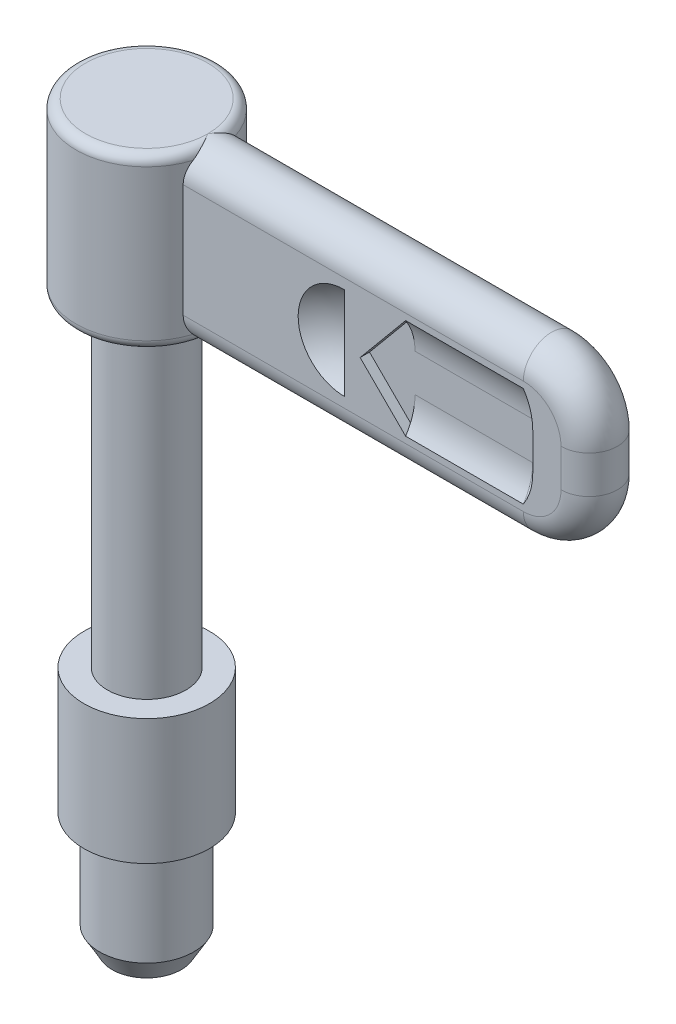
ISO-10303-21;
HEADER;
FILE_DESCRIPTION(('STEP AP214'),'2;1');
FILE_NAME('part.step','',(''),(''),'','','');
FILE_SCHEMA(('AUTOMOTIVE_DESIGN { 1 0 10303 214 1 1 1 1 }'));
ENDSEC;
DATA;
#1=APPLICATION_CONTEXT('core data for automotive mechanical design processes');
#2=APPLICATION_PROTOCOL_DEFINITION('international standard','automotive_design',2000,#1);
#3=PRODUCT_CONTEXT('',#1,'mechanical');
#4=PRODUCT('Part','Part','',(#3));
#5=PRODUCT_RELATED_PRODUCT_CATEGORY('part','',(#4));
#6=PRODUCT_DEFINITION_FORMATION('','',#4);
#7=PRODUCT_DEFINITION_CONTEXT('part definition',#1,'design');
#8=PRODUCT_DEFINITION('design','',#6,#7);
#9=PRODUCT_DEFINITION_SHAPE('','',#8);
#10=(LENGTH_UNIT() NAMED_UNIT(*) SI_UNIT(.MILLI.,.METRE.));
#11=(NAMED_UNIT(*) PLANE_ANGLE_UNIT() SI_UNIT($,.RADIAN.));
#12=(NAMED_UNIT(*) SI_UNIT($,.STERADIAN.) SOLID_ANGLE_UNIT());
#13=UNCERTAINTY_MEASURE_WITH_UNIT(LENGTH_MEASURE(1.E-05),#10,'distance_accuracy_value','');
#14=(GEOMETRIC_REPRESENTATION_CONTEXT(3) GLOBAL_UNCERTAINTY_ASSIGNED_CONTEXT((#13)) GLOBAL_UNIT_ASSIGNED_CONTEXT((#10,
#11,#12)) REPRESENTATION_CONTEXT('',''));
#15=CARTESIAN_POINT('',(0.,0.,0.));
#16=DIRECTION('',(0.,0.,1.));
#17=DIRECTION('',(1.,0.,0.));
#18=AXIS2_PLACEMENT_3D('',#15,#16,#17);
#19=CARTESIAN_POINT('',(-3.8267949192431,8.,3.8267949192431));
#20=DIRECTION('',(0.,1.,0.));
#21=DIRECTION('',(1.,0.,0.));
#22=AXIS2_PLACEMENT_3D('',#19,#20,#21);
#23=PLANE('',#22);
#24=CARTESIAN_POINT('',(0.,8.,0.));
#25=DIRECTION('',(0.,-1.,0.));
#26=DIRECTION('',(-1.42053902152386E-07,0.,1.));
#27=AXIS2_PLACEMENT_3D('',#24,#25,#26);
#28=CIRCLE('',#27,2.5);
#29=CARTESIAN_POINT('',(-3.55134755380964E-07,8.,2.5));
#30=VERTEX_POINT('',#29);
#31=EDGE_CURVE('E641',#30,#30,#28,.T.);
#32=ORIENTED_EDGE('',*,*,#31,.T.);
#33=EDGE_LOOP('',(#32));
#34=FACE_BOUND('',#33,.T.);
#35=CARTESIAN_POINT('',(0.,8.,0.));
#36=DIRECTION('',(0.,1.,0.));
#37=DIRECTION('',(0.,0.,1.));
#38=AXIS2_PLACEMENT_3D('',#35,#36,#37);
#39=CIRCLE('',#38,4.);
#40=CARTESIAN_POINT('',(0.,8.,4.));
#41=VERTEX_POINT('',#40);
#42=EDGE_CURVE('E9',#41,#41,#39,.T.);
#43=ORIENTED_EDGE('',*,*,#42,.T.);
#44=EDGE_LOOP('',(#43));
#45=FACE_BOUND('',#44,.T.);
#46=ADVANCED_FACE('F14',(#34,#45),#23,.T.);
#47=CARTESIAN_POINT('',(18.3,35.2,-1.8));
#48=DIRECTION('',(-1.,0.,0.));
#49=DIRECTION('',(0.,0.,1.));
#50=AXIS2_PLACEMENT_3D('',#47,#48,#49);
#51=PLANE('',#50);
#52=CARTESIAN_POINT('',(18.3,35.1999999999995,-4.80000000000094));
#53=DIRECTION('',(1.,0.,0.));
#54=DIRECTION('',(0.,0.552770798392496,0.83333333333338));
#55=AXIS2_PLACEMENT_3D('',#52,#53,#54);
#56=CIRCLE('',#55,3.60000000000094);
#57=CARTESIAN_POINT('',(18.3,37.189974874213,-1.8));
#58=VERTEX_POINT('',#57);
#59=CARTESIAN_POINT('',(18.3,35.2,-1.2));
#60=VERTEX_POINT('',#59);
#61=EDGE_CURVE('E189',#58,#60,#56,.T.);
#62=ORIENTED_EDGE('',*,*,#61,.T.);
#63=DIRECTION('',(0.,1.,0.));
#64=VECTOR('',#63,1.);
#65=CARTESIAN_POINT('',(18.3,35.2,-1.2));
#66=LINE('',#65,#64);
#67=CARTESIAN_POINT('',(18.3,37.189974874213,-1.2));
#68=VERTEX_POINT('',#67);
#69=EDGE_CURVE('E200',#60,#68,#66,.T.);
#70=ORIENTED_EDGE('',*,*,#69,.T.);
#71=DIRECTION('',(0.,0.,-1.));
#72=VECTOR('',#71,1.);
#73=CARTESIAN_POINT('',(18.3,37.189974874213,-1.2));
#74=LINE('',#73,#72);
#75=EDGE_CURVE('E202',#68,#58,#74,.T.);
#76=ORIENTED_EDGE('',*,*,#75,.T.);
#77=EDGE_LOOP('',(#62,#70,#76));
#78=FACE_BOUND('',#77,.T.);
#79=ADVANCED_FACE('F199',(#78),#51,.T.);
#80=CARTESIAN_POINT('',(4.12431812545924,30.4,-1.8));
#81=DIRECTION('',(0.,0.,-1.));
#82=DIRECTION('',(0.,1.,0.));
#83=AXIS2_PLACEMENT_3D('',#80,#81,#82);
#84=PLANE('',#83);
#85=DIRECTION('',(2.13656270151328E-13,1.,0.));
#86=VECTOR('',#85,1.);
#87=CARTESIAN_POINT('',(4.12431812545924,30.4,-1.8));
#88=LINE('',#87,#86);
#89=CARTESIAN_POINT('',(4.12431812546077,37.5999994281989,-1.8));
#90=VERTEX_POINT('',#89);
#91=CARTESIAN_POINT('',(4.12431812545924,30.4,-1.8));
#92=VERTEX_POINT('',#91);
#93=EDGE_CURVE('E208',#90,#92,#88,.F.);
#94=ORIENTED_EDGE('',*,*,#93,.F.);
#95=DIRECTION('',(1.,2.63798431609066E-08,0.));
#96=VECTOR('',#95,1.);
#97=CARTESIAN_POINT('',(4.12431812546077,37.5999994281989,-1.8));
#98=LINE('',#97,#96);
#99=CARTESIAN_POINT('',(25.8,37.6,-1.8));
#100=VERTEX_POINT('',#99);
#101=EDGE_CURVE('E218',#90,#100,#98,.T.);
#102=ORIENTED_EDGE('',*,*,#101,.T.);
#103=CARTESIAN_POINT('',(25.8,35.2,-1.8));
#104=DIRECTION('',(0.,0.,-1.));
#105=DIRECTION('',(0.,1.,0.));
#106=AXIS2_PLACEMENT_3D('',#103,#104,#105);
#107=CIRCLE('',#106,2.4);
#108=CARTESIAN_POINT('',(28.2,35.2,-1.8));
#109=VERTEX_POINT('',#108);
#110=EDGE_CURVE('E223',#100,#109,#107,.T.);
#111=ORIENTED_EDGE('',*,*,#110,.T.);
#112=DIRECTION('',(0.,-1.,0.));
#113=VECTOR('',#112,1.);
#114=CARTESIAN_POINT('',(28.2,35.2,-1.8));
#115=LINE('',#114,#113);
#116=CARTESIAN_POINT('',(28.2,32.8,-1.8));
#117=VERTEX_POINT('',#116);
#118=EDGE_CURVE('E228',#109,#117,#115,.T.);
#119=ORIENTED_EDGE('',*,*,#118,.T.);
#120=CARTESIAN_POINT('',(25.8,32.8,-1.8));
#121=DIRECTION('',(0.,0.,-1.));
#122=DIRECTION('',(1.,0.,0.));
#123=AXIS2_PLACEMENT_3D('',#120,#121,#122);
#124=CIRCLE('',#123,2.4);
#125=CARTESIAN_POINT('',(25.8,30.4,-1.8));
#126=VERTEX_POINT('',#125);
#127=EDGE_CURVE('E233',#117,#126,#124,.T.);
#128=ORIENTED_EDGE('',*,*,#127,.T.);
#129=DIRECTION('',(-1.,0.,0.));
#130=VECTOR('',#129,1.);
#131=CARTESIAN_POINT('',(25.8,30.4,-1.8));
#132=LINE('',#131,#130);
#133=EDGE_CURVE('E238',#126,#92,#132,.T.);
#134=ORIENTED_EDGE('',*,*,#133,.T.);
#135=EDGE_LOOP('',(#94,#102,#111,#119,#128,#134));
#136=FACE_BOUND('',#135,.T.);
#137=CARTESIAN_POINT('',(25.8,37.189974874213,-1.8));
#138=CARTESIAN_POINT('',(25.8240665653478,37.1532162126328,-1.8));
#139=CARTESIAN_POINT('',(25.8475256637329,37.116058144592,-1.8));
#140=CARTESIAN_POINT('',(25.8931753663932,37.0409586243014,-1.8));
#141=CARTESIAN_POINT('',(25.9153656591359,37.0030169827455,-1.8));
#142=CARTESIAN_POINT('',(25.9584109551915,36.9263862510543,-1.8));
#143=CARTESIAN_POINT('',(25.9792660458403,36.8876972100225,-1.8));
#144=CARTESIAN_POINT('',(26.0195823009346,36.8096116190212,-1.8));
#145=CARTESIAN_POINT('',(26.0390438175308,36.77021525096,-1.8));
#146=CARTESIAN_POINT('',(26.0765218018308,36.6907569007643,-1.8));
#147=CARTESIAN_POINT('',(26.0945387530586,36.6506951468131,-1.8));
#148=CARTESIAN_POINT('',(26.1290843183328,36.5699504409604,-1.8));
#149=CARTESIAN_POINT('',(26.1456134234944,36.5292676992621,-1.8));
#150=CARTESIAN_POINT('',(26.1771478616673,36.4473278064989,-1.8));
#151=CARTESIAN_POINT('',(26.1921535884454,36.4060708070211,-1.8));
#152=CARTESIAN_POINT('',(26.220613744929,36.3230315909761,-1.8));
#153=CARTESIAN_POINT('',(26.2340683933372,36.2812494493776,-1.8));
#154=CARTESIAN_POINT('',(26.2594067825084,36.1972115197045,-1.8));
#155=CARTESIAN_POINT('',(26.2712905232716,36.1549557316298,-1.8));
#156=CARTESIAN_POINT('',(26.293475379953,36.0700244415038,-1.8));
#157=CARTESIAN_POINT('',(26.3037762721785,36.027348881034,-1.8));
#158=CARTESIAN_POINT('',(26.322791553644,35.941634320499,-1.8));
#159=CARTESIAN_POINT('',(26.3315055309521,35.8985952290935,-1.8));
#160=CARTESIAN_POINT('',(26.3473508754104,35.8122121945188,-1.8));
#161=CARTESIAN_POINT('',(26.3544817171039,35.7688681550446,-1.8));
#162=CARTESIAN_POINT('',(26.3671723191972,35.6819361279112,-1.8));
#163=CARTESIAN_POINT('',(26.3727315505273,35.6383480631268,-1.8));
#164=CARTESIAN_POINT('',(26.3822981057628,35.5509910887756,-1.8));
#165=CARTESIAN_POINT('',(26.3863050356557,35.5072221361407,-1.8));
#166=CARTESIAN_POINT('',(26.3927931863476,35.419569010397,-1.8));
#167=CARTESIAN_POINT('',(26.395274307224,35.3756848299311,-1.8));
#168=CARTESIAN_POINT('',(26.3987457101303,35.2878680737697,-1.8));
#169=CARTESIAN_POINT('',(26.3997363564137,35.2439355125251,-1.8));
#170=CARTESIAN_POINT('',(26.4,35.1999999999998,-1.8));
#171=B_SPLINE_CURVE_WITH_KNOTS('',3,(#137,#138,#139,#140,#141,#142,#143,#144,#145,#146,#147,
#148,#149,#150,#151,#152,#153,#154,#155,#156,#157,#158,#159,#160,#161,#162,#163,#164,#165,#166,
#167,#168,#169,#170),.UNSPECIFIED.,.F.,.F.,(4,2,2,2,2,2,2,2,2,2,2,2,2,2,2,2,4),(0.,
0.131804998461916,0.263642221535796,0.395470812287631,0.527265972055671,0.659016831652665,
0.790724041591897,0.922397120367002,1.05405161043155,1.1857061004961,1.31737917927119,
1.44908638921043,1.58083724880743,1.71263240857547,1.84446099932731,1.97629822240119,
2.1081032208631),.UNSPECIFIED.);
#172=CARTESIAN_POINT('',(25.8,37.189974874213,-1.8));
#173=VERTEX_POINT('',#172);
#174=CARTESIAN_POINT('',(26.4,35.2,-1.8));
#175=VERTEX_POINT('',#174);
#176=EDGE_CURVE('E243',#173,#175,#171,.T.);
#177=ORIENTED_EDGE('',*,*,#176,.F.);
#178=DIRECTION('',(-1.,0.,0.));
#179=VECTOR('',#178,1.);
#180=CARTESIAN_POINT('',(25.8,37.189974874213,-1.8));
#181=LINE('',#180,#179);
#182=EDGE_CURVE('E254',#58,#173,#181,.F.);
#183=ORIENTED_EDGE('',*,*,#182,.F.);
#184=DIRECTION('',(-0.639102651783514,-0.769121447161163,0.));
#185=VECTOR('',#184,1.);
#186=CARTESIAN_POINT('',(18.3,37.189974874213,-1.8));
#187=LINE('',#186,#185);
#188=CARTESIAN_POINT('',(15.4,33.7,-1.8));
#189=VERTEX_POINT('',#188);
#190=EDGE_CURVE('E1465',#58,#189,#187,.T.);
#191=ORIENTED_EDGE('',*,*,#190,.T.);
#192=DIRECTION('',(0.708330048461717,-0.705881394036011,0.));
#193=VECTOR('',#192,1.);
#194=CARTESIAN_POINT('',(15.4,33.7,-1.8));
#195=LINE('',#194,#193);
#196=CARTESIAN_POINT('',(18.3,30.810025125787,-1.8));
#197=VERTEX_POINT('',#196);
#198=EDGE_CURVE('E1468',#189,#197,#195,.T.);
#199=ORIENTED_EDGE('',*,*,#198,.T.);
#200=DIRECTION('',(1.,0.,0.));
#201=VECTOR('',#200,1.);
#202=CARTESIAN_POINT('',(18.3,30.810025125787,-1.8));
#203=LINE('',#202,#201);
#204=CARTESIAN_POINT('',(25.8,30.810025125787,-1.8));
#205=VERTEX_POINT('',#204);
#206=EDGE_CURVE('E1470',#197,#205,#203,.T.);
#207=ORIENTED_EDGE('',*,*,#206,.T.);
#208=CARTESIAN_POINT('',(26.4,32.8,-1.8));
#209=CARTESIAN_POINT('',(26.3997363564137,32.7560644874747,-1.8));
#210=CARTESIAN_POINT('',(26.3987457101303,32.7121319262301,-1.8));
#211=CARTESIAN_POINT('',(26.3952743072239,32.6243151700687,-1.8));
#212=CARTESIAN_POINT('',(26.3927931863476,32.5804309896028,-1.8));
#213=CARTESIAN_POINT('',(26.3863050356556,32.4927778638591,-1.8));
#214=CARTESIAN_POINT('',(26.3822981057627,32.4490089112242,-1.8));
#215=CARTESIAN_POINT('',(26.3727315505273,32.3616519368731,-1.8));
#216=CARTESIAN_POINT('',(26.3671723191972,32.3180638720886,-1.8));
#217=CARTESIAN_POINT('',(26.3544817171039,32.2311318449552,-1.8));
#218=CARTESIAN_POINT('',(26.3473508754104,32.1877878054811,-1.8));
#219=CARTESIAN_POINT('',(26.331505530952,32.1014047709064,-1.8));
#220=CARTESIAN_POINT('',(26.3227915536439,32.0583656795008,-1.8));
#221=CARTESIAN_POINT('',(26.3037762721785,31.9726511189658,-1.8));
#222=CARTESIAN_POINT('',(26.2934753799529,31.9299755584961,-1.8));
#223=CARTESIAN_POINT('',(26.2712905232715,31.84504426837,-1.8));
#224=CARTESIAN_POINT('',(26.2594067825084,31.8027884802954,-1.8));
#225=CARTESIAN_POINT('',(26.2340683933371,31.7187505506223,-1.8));
#226=CARTESIAN_POINT('',(26.220613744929,31.6769684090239,-1.8));
#227=CARTESIAN_POINT('',(26.1921535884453,31.5939291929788,-1.8));
#228=CARTESIAN_POINT('',(26.1771478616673,31.552672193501,-1.8));
#229=CARTESIAN_POINT('',(26.1456134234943,31.4707323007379,-1.8));
#230=CARTESIAN_POINT('',(26.1290843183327,31.4300495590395,-1.8));
#231=CARTESIAN_POINT('',(26.0945387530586,31.3493048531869,-1.8));
#232=CARTESIAN_POINT('',(26.0765218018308,31.3092430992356,-1.8));
#233=CARTESIAN_POINT('',(26.0390438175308,31.2297847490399,-1.8));
#234=CARTESIAN_POINT('',(26.0195823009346,31.1903883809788,-1.8));
#235=CARTESIAN_POINT('',(25.9792660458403,31.1123027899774,-1.8));
#236=CARTESIAN_POINT('',(25.9584109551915,31.0736137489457,-1.8));
#237=CARTESIAN_POINT('',(25.9153656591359,30.9969830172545,-1.8));
#238=CARTESIAN_POINT('',(25.8931753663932,30.9590413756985,-1.8));
#239=CARTESIAN_POINT('',(25.8475256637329,30.883941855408,-1.8));
#240=CARTESIAN_POINT('',(25.8240665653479,30.8467837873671,-1.8));
#241=CARTESIAN_POINT('',(25.8,30.810025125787,-1.8));
#242=B_SPLINE_CURVE_WITH_KNOTS('',3,(#208,#209,#210,#211,#212,#213,#214,#215,#216,#217,#218,
#219,#220,#221,#222,#223,#224,#225,#226,#227,#228,#229,#230,#231,#232,#233,#234,#235,#236,#237,
#238,#239,#240,#241),.UNSPECIFIED.,.F.,.F.,(4,2,2,2,2,2,2,2,2,2,2,2,2,2,2,2,4),(0.,
0.131804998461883,0.26364222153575,0.395470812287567,0.527265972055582,0.659016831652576,
0.79072404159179,0.922397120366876,1.05405161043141,1.18570610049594,1.31737917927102,
1.44908638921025,1.58083724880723,1.71263240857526,1.84446099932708,1.97629822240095,
2.10810322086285),.UNSPECIFIED.);
#243=CARTESIAN_POINT('',(26.4,32.8,-1.8));
#244=VERTEX_POINT('',#243);
#245=EDGE_CURVE('E1479',#244,#205,#242,.T.);
#246=ORIENTED_EDGE('',*,*,#245,.F.);
#247=DIRECTION('',(0.,1.,0.));
#248=VECTOR('',#247,1.);
#249=CARTESIAN_POINT('',(26.4,32.8,-1.8));
#250=LINE('',#249,#248);
#251=EDGE_CURVE('E1485',#244,#175,#250,.T.);
#252=ORIENTED_EDGE('',*,*,#251,.T.);
#253=EDGE_LOOP('',(#177,#183,#191,#199,#207,#246,#252));
#254=FACE_BOUND('',#253,.T.);
#255=DIRECTION('',(0.,1.,0.));
#256=VECTOR('',#255,1.);
#257=CARTESIAN_POINT('',(14.4,31.0521194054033,-1.8));
#258=LINE('',#257,#256);
#259=CARTESIAN_POINT('',(14.4,31.0521194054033,-1.8));
#260=VERTEX_POINT('',#259);
#261=CARTESIAN_POINT('',(14.4,36.9478805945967,-1.8));
#262=VERTEX_POINT('',#261);
#263=EDGE_CURVE('E1492',#260,#262,#258,.T.);
#264=ORIENTED_EDGE('',*,*,#263,.T.);
#265=CARTESIAN_POINT('',(14.4,36.9478805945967,-1.8));
#266=CARTESIAN_POINT('',(14.2398904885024,36.9478805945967,-1.8));
#267=CARTESIAN_POINT('',(14.0846401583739,36.9355003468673,-1.8));
#268=CARTESIAN_POINT('',(13.7820381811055,36.8872170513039,-1.8));
#269=CARTESIAN_POINT('',(13.6346865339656,36.8513140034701,-1.8));
#270=CARTESIAN_POINT('',(13.1585202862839,36.6960843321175,-1.8));
#271=CARTESIAN_POINT('',(12.879750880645,36.5446981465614,-1.8));
#272=CARTESIAN_POINT('',(12.3261882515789,36.1307866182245,-1.8));
#273=CARTESIAN_POINT('',(12.0616323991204,35.836506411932,-1.8));
#274=CARTESIAN_POINT('',(11.17567755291,34.3452001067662,-1.8));
#275=CARTESIAN_POINT('',(11.3625860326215,32.8684812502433,-1.8));
#276=CARTESIAN_POINT('',(12.5316546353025,31.6994126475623,-1.8));
#277=CARTESIAN_POINT('',(12.7765109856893,31.5175928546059,-1.8));
#278=CARTESIAN_POINT('',(13.2599373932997,31.272763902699,-1.8));
#279=CARTESIAN_POINT('',(13.4705186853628,31.1928165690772,-1.8));
#280=CARTESIAN_POINT('',(13.9228638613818,31.0806441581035,-1.8));
#281=CARTESIAN_POINT('',(14.1585949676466,31.0521194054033,-1.8));
#282=CARTESIAN_POINT('',(14.4,31.0521194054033,-1.8));
#283=B_SPLINE_CURVE_WITH_KNOTS('',3,(#265,#266,#267,#268,#269,#270,#271,#272,#273,#274,#275,
#276,#277,#278,#279,#280,#281,#282),.UNSPECIFIED.,.F.,.F.,(4,2,2,2,2,2,2,2,4),(0.,
0.0429619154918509,0.0859238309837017,0.184717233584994,0.310914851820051,0.758114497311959,
0.859535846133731,0.928561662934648,1.),.UNSPECIFIED.);
#284=EDGE_CURVE('E289',#262,#260,#283,.T.);
#285=ORIENTED_EDGE('',*,*,#284,.T.);
#286=EDGE_LOOP('',(#264,#285));
#287=FACE_BOUND('',#286,.T.);
#288=ADVANCED_FACE('F256',(#136,#254,#287),#84,.T.);
#289=CARTESIAN_POINT('',(4.12431812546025,30.4,1.8));
#290=DIRECTION('',(0.,0.,1.));
#291=DIRECTION('',(1.,0.,0.));
#292=AXIS2_PLACEMENT_3D('',#289,#290,#291);
#293=PLANE('',#292);
#294=DIRECTION('',(-1.,-1.82876188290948E-08,0.));
#295=VECTOR('',#294,1.);
#296=CARTESIAN_POINT('',(25.8,37.6,1.8));
#297=LINE('',#296,#295);
#298=CARTESIAN_POINT('',(25.8,37.6,1.8));
#299=VERTEX_POINT('',#298);
#300=CARTESIAN_POINT('',(4.12431812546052,37.5999996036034,1.8));
#301=VERTEX_POINT('',#300);
#302=EDGE_CURVE('E280',#299,#301,#297,.T.);
#303=ORIENTED_EDGE('',*,*,#302,.T.);
#304=DIRECTION('',(0.,-1.,0.));
#305=VECTOR('',#304,1.);
#306=CARTESIAN_POINT('',(4.12431812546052,37.5999996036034,1.8));
#307=LINE('',#306,#305);
#308=CARTESIAN_POINT('',(4.12431812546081,30.4000005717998,1.8));
#309=VERTEX_POINT('',#308);
#310=EDGE_CURVE('E288',#301,#309,#307,.T.);
#311=ORIENTED_EDGE('',*,*,#310,.T.);
#312=DIRECTION('',(1.,-2.63797818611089E-08,0.));
#313=VECTOR('',#312,1.);
#314=CARTESIAN_POINT('',(4.12431812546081,30.4000005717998,1.8));
#315=LINE('',#314,#313);
#316=CARTESIAN_POINT('',(25.8,30.4,1.8));
#317=VERTEX_POINT('',#316);
#318=EDGE_CURVE('E294',#309,#317,#315,.T.);
#319=ORIENTED_EDGE('',*,*,#318,.T.);
#320=CARTESIAN_POINT('',(25.8,32.8,1.8));
#321=DIRECTION('',(0.,0.,1.));
#322=DIRECTION('',(0.,-1.,0.));
#323=AXIS2_PLACEMENT_3D('',#320,#321,#322);
#324=CIRCLE('',#323,2.4);
#325=CARTESIAN_POINT('',(28.2,32.8,1.8));
#326=VERTEX_POINT('',#325);
#327=EDGE_CURVE('E299',#317,#326,#324,.T.);
#328=ORIENTED_EDGE('',*,*,#327,.T.);
#329=DIRECTION('',(0.,1.,0.));
#330=VECTOR('',#329,1.);
#331=CARTESIAN_POINT('',(28.2,32.8,1.8));
#332=LINE('',#331,#330);
#333=CARTESIAN_POINT('',(28.2,35.2,1.8));
#334=VERTEX_POINT('',#333);
#335=EDGE_CURVE('E304',#326,#334,#332,.T.);
#336=ORIENTED_EDGE('',*,*,#335,.T.);
#337=CARTESIAN_POINT('',(25.8,35.2,1.8));
#338=DIRECTION('',(0.,0.,1.));
#339=DIRECTION('',(1.,0.,0.));
#340=AXIS2_PLACEMENT_3D('',#337,#338,#339);
#341=CIRCLE('',#340,2.4);
#342=EDGE_CURVE('E309',#334,#299,#341,.T.);
#343=ORIENTED_EDGE('',*,*,#342,.T.);
#344=EDGE_LOOP('',(#303,#311,#319,#328,#336,#343));
#345=FACE_BOUND('',#344,.T.);
#346=DIRECTION('',(0.639102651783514,0.769121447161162,0.));
#347=VECTOR('',#346,1.);
#348=CARTESIAN_POINT('',(15.4,33.7,1.8));
#349=LINE('',#348,#347);
#350=CARTESIAN_POINT('',(18.3,37.189974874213,1.8));
#351=VERTEX_POINT('',#350);
#352=CARTESIAN_POINT('',(15.4,33.7,1.8));
#353=VERTEX_POINT('',#352);
#354=EDGE_CURVE('E314',#351,#353,#349,.F.);
#355=ORIENTED_EDGE('',*,*,#354,.F.);
#356=DIRECTION('',(1.,0.,0.));
#357=VECTOR('',#356,1.);
#358=CARTESIAN_POINT('',(18.3,37.189974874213,1.8));
#359=LINE('',#358,#357);
#360=CARTESIAN_POINT('',(25.8,37.189974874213,1.8));
#361=VERTEX_POINT('',#360);
#362=EDGE_CURVE('E319',#351,#361,#359,.T.);
#363=ORIENTED_EDGE('',*,*,#362,.T.);
#364=CARTESIAN_POINT('',(26.4,35.1999999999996,1.8));
#365=CARTESIAN_POINT('',(26.3997363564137,35.243935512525,1.8));
#366=CARTESIAN_POINT('',(26.3987457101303,35.2878680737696,1.8));
#367=CARTESIAN_POINT('',(26.395274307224,35.375684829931,1.8));
#368=CARTESIAN_POINT('',(26.3927931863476,35.4195690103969,1.8));
#369=CARTESIAN_POINT('',(26.3863050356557,35.5072221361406,1.8));
#370=CARTESIAN_POINT('',(26.3822981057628,35.5509910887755,1.8));
#371=CARTESIAN_POINT('',(26.3727315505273,35.6383480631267,1.8));
#372=CARTESIAN_POINT('',(26.3671723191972,35.6819361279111,1.8));
#373=CARTESIAN_POINT('',(26.3544817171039,35.7688681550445,1.8));
#374=CARTESIAN_POINT('',(26.3473508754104,35.8122121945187,1.8));
#375=CARTESIAN_POINT('',(26.3315055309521,35.8985952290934,1.8));
#376=CARTESIAN_POINT('',(26.322791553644,35.941634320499,1.8));
#377=CARTESIAN_POINT('',(26.3037762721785,36.027348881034,1.8));
#378=CARTESIAN_POINT('',(26.293475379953,36.0700244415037,1.8));
#379=CARTESIAN_POINT('',(26.2712905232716,36.1549557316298,1.8));
#380=CARTESIAN_POINT('',(26.2594067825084,36.1972115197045,1.8));
#381=CARTESIAN_POINT('',(26.2340683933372,36.2812494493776,1.8));
#382=CARTESIAN_POINT('',(26.220613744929,36.323031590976,1.8));
#383=CARTESIAN_POINT('',(26.1921535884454,36.4060708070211,1.8));
#384=CARTESIAN_POINT('',(26.1771478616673,36.4473278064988,1.8));
#385=CARTESIAN_POINT('',(26.1456134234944,36.529267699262,1.8));
#386=CARTESIAN_POINT('',(26.1290843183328,36.5699504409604,1.8));
#387=CARTESIAN_POINT('',(26.0945387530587,36.650695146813,1.8));
#388=CARTESIAN_POINT('',(26.0765218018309,36.6907569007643,1.8));
#389=CARTESIAN_POINT('',(26.0390438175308,36.77021525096,1.8));
#390=CARTESIAN_POINT('',(26.0195823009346,36.8096116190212,1.8));
#391=CARTESIAN_POINT('',(25.9792660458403,36.8876972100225,1.8));
#392=CARTESIAN_POINT('',(25.9584109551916,36.9263862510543,1.8));
#393=CARTESIAN_POINT('',(25.9153656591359,37.0030169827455,1.8));
#394=CARTESIAN_POINT('',(25.8931753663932,37.0409586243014,1.8));
#395=CARTESIAN_POINT('',(25.8475256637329,37.116058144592,1.8));
#396=CARTESIAN_POINT('',(25.8240665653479,37.1532162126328,1.8));
#397=CARTESIAN_POINT('',(25.8,37.189974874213,1.8));
#398=B_SPLINE_CURVE_WITH_KNOTS('',3,(#364,#365,#366,#367,#368,#369,#370,#371,#372,#373,#374,
#375,#376,#377,#378,#379,#380,#381,#382,#383,#384,#385,#386,#387,#388,#389,#390,#391,#392,#393,
#394,#395,#396,#397),.UNSPECIFIED.,.F.,.F.,(4,2,2,2,2,2,2,2,2,2,2,2,2,2,2,2,4),(0.,
0.131804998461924,0.263642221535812,0.395470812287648,0.527265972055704,0.659016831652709,
0.790724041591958,0.922397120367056,1.05405161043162,1.18570610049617,1.31737917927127,
1.44908638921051,1.58083724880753,1.71263240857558,1.84446099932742,1.9762982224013,
2.10810322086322),.UNSPECIFIED.);
#399=CARTESIAN_POINT('',(26.4,35.2,1.8));
#400=VERTEX_POINT('',#399);
#401=EDGE_CURVE('E324',#400,#361,#398,.T.);
#402=ORIENTED_EDGE('',*,*,#401,.F.);
#403=DIRECTION('',(0.,-1.,0.));
#404=VECTOR('',#403,1.);
#405=CARTESIAN_POINT('',(26.4,35.2,1.8));
#406=LINE('',#405,#404);
#407=CARTESIAN_POINT('',(26.4,32.8,1.8));
#408=VERTEX_POINT('',#407);
#409=EDGE_CURVE('E334',#400,#408,#406,.T.);
#410=ORIENTED_EDGE('',*,*,#409,.T.);
#411=CARTESIAN_POINT('',(25.8,30.810025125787,1.8));
#412=CARTESIAN_POINT('',(25.8240665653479,30.8467837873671,1.8));
#413=CARTESIAN_POINT('',(25.8475256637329,30.883941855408,1.8));
#414=CARTESIAN_POINT('',(25.8931753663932,30.9590413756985,1.8));
#415=CARTESIAN_POINT('',(25.9153656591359,30.9969830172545,1.8));
#416=CARTESIAN_POINT('',(25.9584109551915,31.0736137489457,1.8));
#417=CARTESIAN_POINT('',(25.9792660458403,31.1123027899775,1.8));
#418=CARTESIAN_POINT('',(26.0195823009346,31.1903883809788,1.8));
#419=CARTESIAN_POINT('',(26.0390438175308,31.2297847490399,1.8));
#420=CARTESIAN_POINT('',(26.0765218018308,31.3092430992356,1.8));
#421=CARTESIAN_POINT('',(26.0945387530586,31.3493048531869,1.8));
#422=CARTESIAN_POINT('',(26.1290843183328,31.4300495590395,1.8));
#423=CARTESIAN_POINT('',(26.1456134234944,31.4707323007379,1.8));
#424=CARTESIAN_POINT('',(26.1771478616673,31.5526721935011,1.8));
#425=CARTESIAN_POINT('',(26.1921535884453,31.5939291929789,1.8));
#426=CARTESIAN_POINT('',(26.220613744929,31.6769684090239,1.8));
#427=CARTESIAN_POINT('',(26.2340683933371,31.7187505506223,1.8));
#428=CARTESIAN_POINT('',(26.2594067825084,31.8027884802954,1.8));
#429=CARTESIAN_POINT('',(26.2712905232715,31.8450442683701,1.8));
#430=CARTESIAN_POINT('',(26.2934753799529,31.9299755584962,1.8));
#431=CARTESIAN_POINT('',(26.3037762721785,31.9726511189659,1.8));
#432=CARTESIAN_POINT('',(26.322791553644,32.0583656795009,1.8));
#433=CARTESIAN_POINT('',(26.331505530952,32.1014047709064,1.8));
#434=CARTESIAN_POINT('',(26.3473508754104,32.1877878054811,1.8));
#435=CARTESIAN_POINT('',(26.3544817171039,32.2311318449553,1.8));
#436=CARTESIAN_POINT('',(26.3671723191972,32.3180638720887,1.8));
#437=CARTESIAN_POINT('',(26.3727315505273,32.3616519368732,1.8));
#438=CARTESIAN_POINT('',(26.3822981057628,32.4490089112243,1.8));
#439=CARTESIAN_POINT('',(26.3863050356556,32.4927778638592,1.8));
#440=CARTESIAN_POINT('',(26.3927931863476,32.5804309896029,1.8));
#441=CARTESIAN_POINT('',(26.395274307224,32.6243151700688,1.8));
#442=CARTESIAN_POINT('',(26.3987457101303,32.7121319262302,1.8));
#443=CARTESIAN_POINT('',(26.3997363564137,32.7560644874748,1.8));
#444=CARTESIAN_POINT('',(26.4,32.8000000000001,1.8));
#445=B_SPLINE_CURVE_WITH_KNOTS('',3,(#411,#412,#413,#414,#415,#416,#417,#418,#419,#420,#421,
#422,#423,#424,#425,#426,#427,#428,#429,#430,#431,#432,#433,#434,#435,#436,#437,#438,#439,#440,
#441,#442,#443,#444),.UNSPECIFIED.,.F.,.F.,(4,2,2,2,2,2,2,2,2,2,2,2,2,2,2,2,4),(0.,
0.131804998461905,0.263642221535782,0.395470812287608,0.527265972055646,0.659016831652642,
0.790724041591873,0.922397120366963,1.0540516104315,1.18570610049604,1.31737917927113,
1.44908638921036,1.58083724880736,1.71263240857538,1.84446099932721,1.97629822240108,
2.10810322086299),.UNSPECIFIED.);
#446=CARTESIAN_POINT('',(25.8,30.810025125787,1.8));
#447=VERTEX_POINT('',#446);
#448=EDGE_CURVE('E341',#447,#408,#445,.T.);
#449=ORIENTED_EDGE('',*,*,#448,.F.);
#450=DIRECTION('',(-1.,0.,0.));
#451=VECTOR('',#450,1.);
#452=CARTESIAN_POINT('',(25.8,30.810025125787,1.8));
#453=LINE('',#452,#451);
#454=CARTESIAN_POINT('',(18.3,30.810025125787,1.8));
#455=VERTEX_POINT('',#454);
#456=EDGE_CURVE('E351',#455,#447,#453,.F.);
#457=ORIENTED_EDGE('',*,*,#456,.F.);
#458=DIRECTION('',(-0.708330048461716,0.705881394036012,0.));
#459=VECTOR('',#458,1.);
#460=CARTESIAN_POINT('',(18.3,30.810025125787,1.8));
#461=LINE('',#460,#459);
#462=EDGE_CURVE('E358',#353,#455,#461,.F.);
#463=ORIENTED_EDGE('',*,*,#462,.F.);
#464=EDGE_LOOP('',(#355,#363,#402,#410,#449,#457,#463));
#465=FACE_BOUND('',#464,.T.);
#466=CARTESIAN_POINT('',(14.4,36.9478805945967,1.8));
#467=CARTESIAN_POINT('',(14.351193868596,36.9478835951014,1.80000166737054));
#468=CARTESIAN_POINT('',(14.3023873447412,36.9466764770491,1.80000687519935));
#469=CARTESIAN_POINT('',(14.2052390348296,36.9418585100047,1.80001713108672));
#470=CARTESIAN_POINT('',(14.1568964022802,36.9382647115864,1.80002218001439));
#471=CARTESIAN_POINT('',(14.0606501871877,36.9287098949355,1.80002509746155));
#472=CARTESIAN_POINT('',(14.0127456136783,36.9227588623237,1.80002299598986));
#473=CARTESIAN_POINT('',(13.9173654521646,36.908518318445,1.80001379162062));
#474=CARTESIAN_POINT('',(13.8698892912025,36.9002326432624,1.80000669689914));
#475=CARTESIAN_POINT('',(13.7753745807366,36.8813393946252,1.7999926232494));
#476=CARTESIAN_POINT('',(13.7283362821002,36.8707305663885,1.79998564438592));
#477=CARTESIAN_POINT('',(13.6347277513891,36.8471974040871,1.79997650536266));
#478=CARTESIAN_POINT('',(13.5881588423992,36.8342678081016,1.79997435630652));
#479=CARTESIAN_POINT('',(13.4955422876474,36.8060931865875,1.79997813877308));
#480=CARTESIAN_POINT('',(13.4494971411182,36.790839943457,1.79998409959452));
#481=CARTESIAN_POINT('',(13.3580100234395,36.7580027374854,1.79999257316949));
#482=CARTESIAN_POINT('',(13.3125717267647,36.740408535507,1.79999507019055));
#483=CARTESIAN_POINT('',(13.2227080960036,36.7030318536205,1.80000498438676));
#484=CARTESIAN_POINT('',(13.178280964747,36.6832536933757,1.80001239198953));
#485=CARTESIAN_POINT('',(13.0907340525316,36.6416646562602,1.80003469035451));
#486=CARTESIAN_POINT('',(13.04760776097,36.6198674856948,1.80004953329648));
#487=CARTESIAN_POINT('',(12.9626637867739,36.5742723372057,1.80007350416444));
#488=CARTESIAN_POINT('',(12.9208412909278,36.5504833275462,1.80008265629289));
#489=CARTESIAN_POINT('',(12.8385224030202,36.5009454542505,1.80009395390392));
#490=CARTESIAN_POINT('',(12.7980228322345,36.4752018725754,1.80009611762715));
#491=CARTESIAN_POINT('',(12.7183849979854,36.4217976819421,1.80009375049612));
#492=CARTESIAN_POINT('',(12.6792450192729,36.3941396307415,1.8000892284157));
#493=CARTESIAN_POINT('',(12.6023758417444,36.3369547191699,1.80007588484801));
#494=CARTESIAN_POINT('',(12.5646461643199,36.3074285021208,1.80006706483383));
#495=CARTESIAN_POINT('',(12.4906590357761,36.2465613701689,1.80004785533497));
#496=CARTESIAN_POINT('',(12.4544020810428,36.2152198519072,1.8000374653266));
#497=CARTESIAN_POINT('',(12.3834311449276,36.150783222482,1.80001756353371));
#498=CARTESIAN_POINT('',(12.3487183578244,36.1176867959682,1.80000805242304));
#499=CARTESIAN_POINT('',(12.2809132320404,36.0498091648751,1.79999159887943));
#500=CARTESIAN_POINT('',(12.2478225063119,36.015026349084,1.79998465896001));
#501=CARTESIAN_POINT('',(12.1833431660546,35.9438530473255,1.79997412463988));
#502=CARTESIAN_POINT('',(12.1519563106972,35.9074609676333,1.79997053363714));
#503=CARTESIAN_POINT('',(12.0909681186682,35.8331549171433,1.79996659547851));
#504=CARTESIAN_POINT('',(12.0613684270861,35.7952395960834,1.7999662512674));
#505=CARTESIAN_POINT('',(12.0040373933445,35.7179817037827,1.79996800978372));
#506=CARTESIAN_POINT('',(11.9763073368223,35.6786381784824,1.79997011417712));
#507=CARTESIAN_POINT('',(11.9227956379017,35.5986273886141,1.79997556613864));
#508=CARTESIAN_POINT('',(11.8970146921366,35.5579596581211,1.79997891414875));
#509=CARTESIAN_POINT('',(11.8474765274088,35.4754126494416,1.79998554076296));
#510=CARTESIAN_POINT('',(11.8237192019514,35.4335334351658,1.79998881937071));
#511=CARTESIAN_POINT('',(11.7782968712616,35.3486840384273,1.79999434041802));
#512=CARTESIAN_POINT('',(11.7566307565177,35.305714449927,1.79999658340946));
#513=CARTESIAN_POINT('',(11.7154515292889,35.218812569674,1.79999928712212));
#514=CARTESIAN_POINT('',(11.6959361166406,35.1748813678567,1.79999974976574));
#515=CARTESIAN_POINT('',(11.6589969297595,35.085925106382,1.80000025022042));
#516=CARTESIAN_POINT('',(11.6415825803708,35.0408961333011,1.80000028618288));
#517=CARTESIAN_POINT('',(11.6088193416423,34.9495960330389,1.80000689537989));
#518=CARTESIAN_POINT('',(11.5934922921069,34.9033170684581,1.80001353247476));
#519=CARTESIAN_POINT('',(11.5650210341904,34.8096599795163,1.80003515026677));
#520=CARTESIAN_POINT('',(11.5518966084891,34.7622758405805,1.80005020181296));
#521=CARTESIAN_POINT('',(11.5279365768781,34.666559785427,1.80008799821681));
#522=CARTESIAN_POINT('',(11.5171186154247,34.6182234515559,1.80011079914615));
#523=CARTESIAN_POINT('',(11.4978649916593,34.5207615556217,1.80016136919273));
#524=CARTESIAN_POINT('',(11.489444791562,34.4716329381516,1.80018916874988));
#525=CARTESIAN_POINT('',(11.4750661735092,34.3727511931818,1.80024590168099));
#526=CARTESIAN_POINT('',(11.4691210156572,34.3229961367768,1.80027484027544));
#527=CARTESIAN_POINT('',(11.4597568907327,34.2230312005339,1.80032963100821));
#528=CARTESIAN_POINT('',(11.4563489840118,34.1728202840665,1.80035546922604));
#529=CARTESIAN_POINT('',(11.4521078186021,34.0721170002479,1.80040012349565));
#530=CARTESIAN_POINT('',(11.4512834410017,34.0216242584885,1.80041891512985));
#531=CARTESIAN_POINT('',(11.4522412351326,33.9205330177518,1.80044636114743));
#532=CARTESIAN_POINT('',(11.4540301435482,33.8699345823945,1.80045498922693));
#533=CARTESIAN_POINT('',(11.4602295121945,33.7688085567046,1.80046021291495));
#534=CARTESIAN_POINT('',(11.4646446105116,33.7182812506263,1.80045678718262));
#535=CARTESIAN_POINT('',(11.4760943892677,33.617473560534,1.80043747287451));
#536=CARTESIAN_POINT('',(11.4831316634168,33.5671934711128,1.80042157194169));
#537=CARTESIAN_POINT('',(11.4998070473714,33.4670543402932,1.80037842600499));
#538=CARTESIAN_POINT('',(11.5094457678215,33.4171954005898,1.80035117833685));
#539=CARTESIAN_POINT('',(11.5312889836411,33.3180693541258,1.80028792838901));
#540=CARTESIAN_POINT('',(11.5434921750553,33.2688019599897,1.80025193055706));
#541=CARTESIAN_POINT('',(11.5704136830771,33.1710251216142,1.80017500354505));
#542=CARTESIAN_POINT('',(11.5851288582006,33.1225148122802,1.80013408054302));
#543=CARTESIAN_POINT('',(11.6170090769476,33.0264123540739,1.80005197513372));
#544=CARTESIAN_POINT('',(11.6341692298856,32.9788185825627,1.80001079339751));
#545=CARTESIAN_POINT('',(11.6708607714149,32.8847023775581,1.79993317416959));
#546=CARTESIAN_POINT('',(11.6903856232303,32.8381773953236,1.7998967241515));
#547=CARTESIAN_POINT('',(11.7317160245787,32.7463439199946,1.79983327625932));
#548=CARTESIAN_POINT('',(11.7535135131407,32.7010317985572,1.79980624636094));
#549=CARTESIAN_POINT('',(11.7992884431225,32.6117603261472,1.79976534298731));
#550=CARTESIAN_POINT('',(11.823256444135,32.5677961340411,1.79975141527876));
#551=CARTESIAN_POINT('',(11.873263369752,32.4813472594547,1.79973865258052));
#552=CARTESIAN_POINT('',(11.8992916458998,32.4388564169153,1.79973974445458));
#553=CARTESIAN_POINT('',(11.9533039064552,32.355470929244,1.79975644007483));
#554=CARTESIAN_POINT('',(11.9812762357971,32.3145687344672,1.79977196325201));
#555=CARTESIAN_POINT('',(12.0390575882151,32.2344669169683,1.79981360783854));
#556=CARTESIAN_POINT('',(12.0688541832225,32.1952583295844,1.79983966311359));
#557=CARTESIAN_POINT('',(12.13016343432,32.1186395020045,1.79989475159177));
#558=CARTESIAN_POINT('',(12.1616631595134,32.081218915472,1.79992376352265));
#559=CARTESIAN_POINT('',(12.2262601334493,32.0082619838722,1.79997185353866));
#560=CARTESIAN_POINT('',(12.2593442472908,31.9727140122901,1.79999100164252));
#561=CARTESIAN_POINT('',(12.3269685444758,31.9036005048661,1.80000471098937));
#562=CARTESIAN_POINT('',(12.3614945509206,31.8700210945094,1.79999947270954));
#563=CARTESIAN_POINT('',(12.431804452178,31.8049075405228,1.7999928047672));
#564=CARTESIAN_POINT('',(12.467572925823,31.7733567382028,1.79999133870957));
#565=CARTESIAN_POINT('',(12.5402517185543,31.7123099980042,1.79999384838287));
#566=CARTESIAN_POINT('',(12.5771481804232,31.6827975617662,1.7999977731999));
#567=CARTESIAN_POINT('',(12.6519765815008,31.6258257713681,1.80001434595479));
#568=CARTESIAN_POINT('',(12.6898964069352,31.5983505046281,1.80002691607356));
#569=CARTESIAN_POINT('',(12.7666800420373,31.5454481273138,1.80005930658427));
#570=CARTESIAN_POINT('',(12.8055335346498,31.5200060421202,1.80007906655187));
#571=CARTESIAN_POINT('',(12.8841077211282,31.4711614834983,1.80012197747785));
#572=CARTESIAN_POINT('',(12.9238199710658,31.4477454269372,1.80014510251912));
#573=CARTESIAN_POINT('',(13.0040512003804,31.4029420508,1.80018897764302));
#574=CARTESIAN_POINT('',(13.0445636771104,31.3815430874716,1.80020974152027));
#575=CARTESIAN_POINT('',(13.1263521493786,31.3407615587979,1.80024261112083));
#576=CARTESIAN_POINT('',(13.1676236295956,31.321369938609,1.80025475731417));
#577=CARTESIAN_POINT('',(13.2509050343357,31.2845902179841,1.80026522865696));
#578=CARTESIAN_POINT('',(13.2929124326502,31.2671963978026,1.80026359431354));
#579=CARTESIAN_POINT('',(13.3776594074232,31.234400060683,1.80024420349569));
#580=CARTESIAN_POINT('',(13.4203983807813,31.2189959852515,1.80022645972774));
#581=CARTESIAN_POINT('',(13.5066212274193,31.1901677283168,1.8001783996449));
#582=CARTESIAN_POINT('',(13.5501062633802,31.1767470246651,1.80014806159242));
#583=CARTESIAN_POINT('',(13.6378536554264,31.151879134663,1.8000838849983));
#584=CARTESIAN_POINT('',(13.6821186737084,31.1404413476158,1.80005003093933));
#585=CARTESIAN_POINT('',(13.7714297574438,31.1195376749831,1.80000677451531));
#586=CARTESIAN_POINT('',(13.8164790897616,31.1100857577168,1.79999754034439));
#587=CARTESIAN_POINT('',(13.906578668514,31.0933380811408,1.80000978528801));
#588=CARTESIAN_POINT('',(13.9516256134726,31.0860245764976,1.80003100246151));
#589=CARTESIAN_POINT('',(14.041517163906,31.073580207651,1.8000597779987));
#590=CARTESIAN_POINT('',(14.0863585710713,31.0684262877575,1.8000674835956));
#591=CARTESIAN_POINT('',(14.1759695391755,31.0602314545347,1.8000612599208));
#592=CARTESIAN_POINT('',(14.2207379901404,31.0571783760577,1.80004745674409));
#593=CARTESIAN_POINT('',(14.3103381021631,31.0531199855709,1.80001912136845));
#594=CARTESIAN_POINT('',(14.35516970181,31.052113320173,1.80000458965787));
#595=CARTESIAN_POINT('',(14.4,31.0521194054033,1.8));
#596=B_SPLINE_CURVE_WITH_KNOTS('',3,(#466,#467,#468,#469,#470,#471,#472,#473,#474,#475,#476,
#477,#478,#479,#480,#481,#482,#483,#484,#485,#486,#487,#488,#489,#490,#491,#492,#493,#494,#495,
#496,#497,#498,#499,#500,#501,#502,#503,#504,#505,#506,#507,#508,#509,#510,#511,#512,#513,#514,
#515,#516,#517,#518,#519,#520,#521,#522,#523,#524,#525,#526,#527,#528,#529,#530,#531,#532,#533,
#534,#535,#536,#537,#538,#539,#540,#541,#542,#543,#544,#545,#546,#547,#548,#549,#550,#551,#552,
#553,#554,#555,#556,#557,#558,#559,#560,#561,#562,#563,#564,#565,#566,#567,#568,#569,#570,#571,
#572,#573,#574,#575,#576,#577,#578,#579,#580,#581,#582,#583,#584,#585,#586,#587,#588,#589,#590,
#591,#592,#593,#594,#595),.UNSPECIFIED.,.F.,.F.,(4,2,2,2,2,2,2,2,2,2,2,2,2,2,2,2,2,2,2,2,2,2,2,
2,2,2,2,2,2,2,2,2,2,2,2,2,2,2,2,2,2,2,2,2,2,2,2,2,2,2,2,2,2,2,2,2,2,2,2,2,2,2,2,2,4),(0.,
0.146403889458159,0.291772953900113,0.436532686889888,0.581055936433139,0.725657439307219,
0.870591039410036,1.01604963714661,1.16216676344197,1.30799989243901,1.45290691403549,
1.59719336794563,1.74110290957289,1.88482376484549,2.02849539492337,2.17221505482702,
2.31604400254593,2.46001318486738,2.60412828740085,2.74837408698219,2.89271808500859,
3.03711343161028,3.1815011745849,3.32581188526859,3.46996672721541,3.61474589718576,
3.76093943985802,3.90838287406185,4.05691670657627,4.2063877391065,4.35664956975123,
4.5075626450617,4.65899393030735,4.81081627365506,4.962907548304,5.11514966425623,
5.26742754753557,5.41962818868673,5.57163986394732,5.72335163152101,5.87465320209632,
6.02543527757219,6.17559044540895,6.32501470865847,6.47360972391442,6.62128581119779,
6.76796579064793,6.91358968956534,7.05801855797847,7.20104863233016,7.3427371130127,
7.4831666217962,7.622442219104,7.76069694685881,7.89809722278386,8.03484789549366,
8.17119673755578,8.30743812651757,8.44391565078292,8.58102338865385,8.71906542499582,
8.8559271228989,8.99128797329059,9.12585825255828,9.26033950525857),.UNSPECIFIED.);
#597=CARTESIAN_POINT('',(14.4,36.9478805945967,1.8));
#598=VERTEX_POINT('',#597);
#599=CARTESIAN_POINT('',(14.4,31.0521194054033,1.8));
#600=VERTEX_POINT('',#599);
#601=EDGE_CURVE('E362',#598,#600,#596,.T.);
#602=ORIENTED_EDGE('',*,*,#601,.F.);
#603=DIRECTION('',(0.,-1.,0.));
#604=VECTOR('',#603,1.);
#605=CARTESIAN_POINT('',(14.4,36.9478805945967,1.8));
#606=LINE('',#605,#604);
#607=EDGE_CURVE('E373',#600,#598,#606,.F.);
#608=ORIENTED_EDGE('',*,*,#607,.F.);
#609=EDGE_LOOP('',(#602,#608));
#610=FACE_BOUND('',#609,.T.);
#611=ADVANCED_FACE('F266',(#345,#465,#610),#293,.T.);
#612=CARTESIAN_POINT('',(25.8,30.4,0.));
#613=DIRECTION('',(-1.,0.,0.));
#614=DIRECTION('',(0.,1.49979688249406E-13,-1.));
#615=AXIS2_PLACEMENT_3D('',#612,#613,#614);
#616=CYLINDRICAL_SURFACE('',#615,1.8);
#617=ORIENTED_EDGE('',*,*,#318,.F.);
#618=CARTESIAN_POINT('',(4.1243181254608,30.4000005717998,1.79999999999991));
#619=CARTESIAN_POINT('',(4.12431700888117,30.3713192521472,1.80000096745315));
#620=CARTESIAN_POINT('',(4.12461596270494,30.342638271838,1.79931453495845));
#621=CARTESIAN_POINT('',(4.12579748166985,30.2857639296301,1.79659347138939));
#622=CARTESIAN_POINT('',(4.1266716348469,30.257569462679,1.79457827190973));
#623=CARTESIAN_POINT('',(4.12897336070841,30.2016749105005,1.7892584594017));
#624=CARTESIAN_POINT('',(4.13039401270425,30.1739730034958,1.78596996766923));
#625=CARTESIAN_POINT('',(4.13375691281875,30.1190656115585,1.77815548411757));
#626=CARTESIAN_POINT('',(4.13569369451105,30.0918579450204,1.77364245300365));
#627=CARTESIAN_POINT('',(4.14005754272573,30.0379378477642,1.76342220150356));
#628=CARTESIAN_POINT('',(4.14248050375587,30.0112231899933,1.75772496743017));
#629=CARTESIAN_POINT('',(4.14778538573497,29.9582857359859,1.74517163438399));
#630=CARTESIAN_POINT('',(4.15066444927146,29.9320609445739,1.73832273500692));
#631=CARTESIAN_POINT('',(4.1568503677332,29.8800987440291,1.72349348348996));
#632=CARTESIAN_POINT('',(4.16015547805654,29.8543598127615,1.7155177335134));
#633=CARTESIAN_POINT('',(4.16716245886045,29.8033647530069,1.69845456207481));
#634=CARTESIAN_POINT('',(4.17086354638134,29.7781077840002,1.68936932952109));
#635=CARTESIAN_POINT('',(4.17863161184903,29.7280729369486,1.67009962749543));
#636=CARTESIAN_POINT('',(4.18269860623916,29.7032950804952,1.65991510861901));
#637=CARTESIAN_POINT('',(4.19116778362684,29.6542165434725,1.63845225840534));
#638=CARTESIAN_POINT('',(4.19557061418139,29.6299169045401,1.62717180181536));
#639=CARTESIAN_POINT('',(4.2046809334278,29.5817955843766,1.60351586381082));
#640=CARTESIAN_POINT('',(4.20938953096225,29.5579761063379,1.59113632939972));
#641=CARTESIAN_POINT('',(4.21908102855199,29.5108194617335,1.56527480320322));
#642=CARTESIAN_POINT('',(4.2240653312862,29.4874857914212,1.55178696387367));
#643=CARTESIAN_POINT('',(4.23427803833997,29.4413095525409,1.52369562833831));
#644=CARTESIAN_POINT('',(4.23950797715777,29.4184719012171,1.5090846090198));
#645=CARTESIAN_POINT('',(4.25018196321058,29.3733017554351,1.47872847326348));
#646=CARTESIAN_POINT('',(4.25562752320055,29.3509757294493,1.46297426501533));
#647=CARTESIAN_POINT('',(4.26670272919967,29.3068490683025,1.43030855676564));
#648=CARTESIAN_POINT('',(4.27233372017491,29.2850565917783,1.41338649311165));
#649=CARTESIAN_POINT('',(4.28375058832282,29.2420240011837,1.37835803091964));
#650=CARTESIAN_POINT('',(4.28953751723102,29.2207938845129,1.36023969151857));
#651=CARTESIAN_POINT('',(4.29534632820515,29.1999999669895,1.34164075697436));
#652=B_SPLINE_CURVE_WITH_KNOTS('',3,(#618,#619,#620,#621,#622,#623,#624,#625,#626,#627,#628,
#629,#630,#631,#632,#633,#634,#635,#636,#637,#638,#639,#640,#641,#642,#643,#644,#645,#646,#647,
#648,#649,#650,#651),.UNSPECIFIED.,.F.,.F.,(4,2,2,2,2,2,2,2,2,2,2,2,2,2,2,2,4),(0.,
0.0860335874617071,0.170836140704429,0.254598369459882,0.337506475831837,0.419741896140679,
0.501481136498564,0.58289571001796,0.664152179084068,0.745412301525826,0.826833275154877,
0.908568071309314,0.990765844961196,1.07357240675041,1.15713074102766,1.2415815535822,
1.32706383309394),.UNSPECIFIED.);
#653=CARTESIAN_POINT('',(4.29534632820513,29.2,1.34164075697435));
#654=VERTEX_POINT('',#653);
#655=EDGE_CURVE('E380',#309,#654,#652,.T.);
#656=ORIENTED_EDGE('',*,*,#655,.T.);
#657=CARTESIAN_POINT('',(3.90000000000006,28.6000000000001,0.));
#658=CARTESIAN_POINT('',(3.91724064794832,28.6000004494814,0.0299108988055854));
#659=CARTESIAN_POINT('',(3.9342294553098,28.6007431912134,0.0599711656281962));
#660=CARTESIAN_POINT('',(3.96751988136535,28.6037548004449,0.120170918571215));
#661=CARTESIAN_POINT('',(3.98382484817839,28.606014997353,0.150308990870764));
#662=CARTESIAN_POINT('',(4.01567346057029,28.6120852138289,0.210618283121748));
#663=CARTESIAN_POINT('',(4.03122080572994,28.6158866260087,0.240788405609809));
#664=CARTESIAN_POINT('',(4.0614730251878,28.6250649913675,0.301106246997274));
#665=CARTESIAN_POINT('',(4.07618197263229,28.6304333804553,0.331253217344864));
#666=CARTESIAN_POINT('',(4.10466906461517,28.6427708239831,0.391460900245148));
#667=CARTESIAN_POINT('',(4.11845167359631,28.6497313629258,0.421521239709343));
#668=CARTESIAN_POINT('',(4.1449903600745,28.665277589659,0.481486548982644));
#669=CARTESIAN_POINT('',(4.15775130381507,28.6738548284,0.511391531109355));
#670=CARTESIAN_POINT('',(4.17606247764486,28.687969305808,0.556120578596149));
#671=CARTESIAN_POINT('',(4.18201776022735,28.6928722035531,0.57098197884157));
#672=CARTESIAN_POINT('',(4.19363091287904,28.7030896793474,0.600634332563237));
#673=CARTESIAN_POINT('',(4.19928946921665,28.7084032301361,0.615425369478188));
#674=CARTESIAN_POINT('',(4.21029380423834,28.7194431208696,0.644924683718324));
#675=CARTESIAN_POINT('',(4.21564029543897,28.7251684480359,0.659633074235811));
#676=CARTESIAN_POINT('',(4.22600465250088,28.7370325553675,0.688954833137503));
#677=CARTESIAN_POINT('',(4.2310232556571,28.7431703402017,0.703568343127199));
#678=CARTESIAN_POINT('',(4.24071513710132,28.7558592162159,0.732687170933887));
#679=CARTESIAN_POINT('',(4.24538917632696,28.7624093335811,0.747192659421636));
#680=CARTESIAN_POINT('',(4.25437446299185,28.7759218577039,0.77608159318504));
#681=CARTESIAN_POINT('',(4.25868649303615,28.7828833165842,0.790465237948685));
#682=CARTESIAN_POINT('',(4.26692950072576,28.7972164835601,0.81909586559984));
#683=CARTESIAN_POINT('',(4.27086127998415,28.8045872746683,0.833343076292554));
#684=CARTESIAN_POINT('',(4.27832474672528,28.8197359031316,0.861685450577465));
#685=CARTESIAN_POINT('',(4.28185725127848,28.8275128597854,0.87578086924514));
#686=CARTESIAN_POINT('',(4.28850236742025,28.8434692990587,0.903803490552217));
#687=CARTESIAN_POINT('',(4.29161580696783,28.8516479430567,0.917730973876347));
#688=CARTESIAN_POINT('',(4.29740226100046,28.8684017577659,0.945400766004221));
#689=CARTESIAN_POINT('',(4.30007610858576,28.876976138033,0.959143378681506));
#690=CARTESIAN_POINT('',(4.30496215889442,28.8945137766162,0.986425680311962));
#691=CARTESIAN_POINT('',(4.30717519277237,28.9034762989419,0.999965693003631));
#692=CARTESIAN_POINT('',(4.31111776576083,28.9217807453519,1.02682426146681));
#693=CARTESIAN_POINT('',(4.31284812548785,28.9311219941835,1.04014315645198));
#694=CARTESIAN_POINT('',(4.31580294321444,28.9501724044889,1.06654018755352));
#695=CARTESIAN_POINT('',(4.31702820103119,28.9598809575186,1.07961867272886));
#696=CARTESIAN_POINT('',(4.31894994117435,28.9796522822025,1.1055148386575));
#697=CARTESIAN_POINT('',(4.31964719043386,28.9897145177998,1.11833287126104));
#698=CARTESIAN_POINT('',(4.32048968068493,29.0101771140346,1.14368737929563));
#699=CARTESIAN_POINT('',(4.32063564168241,29.020577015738,1.15622420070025));
#700=CARTESIAN_POINT('',(4.32035209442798,29.0416962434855,1.18099487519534));
#701=CARTESIAN_POINT('',(4.31992324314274,29.0524151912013,1.1932290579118));
#702=CARTESIAN_POINT('',(4.31846652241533,29.0741510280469,1.21737244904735));
#703=CARTESIAN_POINT('',(4.31743922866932,29.0851676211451,1.22928195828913));
#704=CARTESIAN_POINT('',(4.31476219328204,29.1074741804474,1.25275347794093));
#705=CARTESIAN_POINT('',(4.31311292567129,29.1187639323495,1.26431574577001));
#706=CARTESIAN_POINT('',(4.30916869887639,29.1415893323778,1.28706984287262));
#707=CARTESIAN_POINT('',(4.3068740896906,29.1531248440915,1.29826186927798));
#708=CARTESIAN_POINT('',(4.30161682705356,29.1764097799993,1.32025221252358));
#709=CARTESIAN_POINT('',(4.29865437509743,29.1881591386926,1.33105064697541));
#710=CARTESIAN_POINT('',(4.29534632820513,29.1999999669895,1.34164075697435));
#711=B_SPLINE_CURVE_WITH_KNOTS('',3,(#657,#658,#659,#660,#661,#662,#663,#664,#665,#666,#667,
#668,#669,#670,#671,#672,#673,#674,#675,#676,#677,#678,#679,#680,#681,#682,#683,#684,#685,#686,
#687,#688,#689,#690,#691,#692,#693,#694,#695,#696,#697,#698,#699,#700,#701,#702,#703,#704,#705,
#706,#707,#708,#709,#710),.UNSPECIFIED.,.F.,.F.,(4,2,2,2,2,2,2,2,2,2,2,2,2,2,2,2,2,2,2,2,2,2,2,
2,2,2,4),(0.,0.103567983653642,0.206549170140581,0.308962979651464,0.410827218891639,
0.512158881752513,0.612974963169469,0.663200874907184,0.713304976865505,0.763289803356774,
0.813158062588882,0.862912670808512,0.912556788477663,0.962093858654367,1.01152764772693,
1.06086228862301,1.11010232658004,1.15925276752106,1.2083191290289,1.25730749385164,
1.3062245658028,1.35507772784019,1.40387510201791,1.45262561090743,1.50133903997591,
1.55002610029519,1.59869849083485),.UNSPECIFIED.);
#712=CARTESIAN_POINT('',(3.9,28.6,0.));
#713=VERTEX_POINT('',#712);
#714=EDGE_CURVE('E570',#713,#654,#711,.T.);
#715=ORIENTED_EDGE('',*,*,#714,.F.);
#716=CARTESIAN_POINT('',(4.29534639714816,29.1999997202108,-1.34164053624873));
#717=CARTESIAN_POINT('',(4.29865457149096,29.188158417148,-1.33105000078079));
#718=CARTESIAN_POINT('',(4.30161711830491,29.1764085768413,-1.32025113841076));
#719=CARTESIAN_POINT('',(4.30687448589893,29.1531227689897,-1.29826002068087));
#720=CARTESIAN_POINT('',(4.30916911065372,29.1415868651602,-1.28706765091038));
#721=CARTESIAN_POINT('',(4.31311330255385,29.1187607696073,-1.26431294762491));
#722=CARTESIAN_POINT('',(4.31476252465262,29.1074707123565,-1.25275041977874));
#723=CARTESIAN_POINT('',(4.31743942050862,29.0851636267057,-1.22927845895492));
#724=CARTESIAN_POINT('',(4.31846662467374,29.0741468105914,-1.21736877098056));
#725=CARTESIAN_POINT('',(4.31992313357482,29.052410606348,-1.19322509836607));
#726=CARTESIAN_POINT('',(4.32035186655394,29.0416915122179,-1.18099081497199));
#727=CARTESIAN_POINT('',(4.32063515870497,29.0205720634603,-1.15622001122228));
#728=CARTESIAN_POINT('',(4.32048906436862,29.0101720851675,-1.14368316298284));
#729=CARTESIAN_POINT('',(4.31964630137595,28.9897093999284,-1.11832866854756));
#730=CARTESIAN_POINT('',(4.31894891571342,28.9796471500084,-1.10551067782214));
#731=CARTESIAN_POINT('',(4.31702690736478,28.959875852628,-1.07961465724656));
#732=CARTESIAN_POINT('',(4.31580152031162,28.9501673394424,-1.06653627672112));
#733=CARTESIAN_POINT('',(4.31284645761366,28.9311170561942,-1.04013951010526));
#734=CARTESIAN_POINT('',(4.31111598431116,28.9217758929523,-1.02682077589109));
#735=CARTESIAN_POINT('',(4.30717320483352,28.9034716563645,-0.999962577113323));
#736=CARTESIAN_POINT('',(4.30496007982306,28.8945092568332,-0.986422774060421));
#737=CARTESIAN_POINT('',(4.30007387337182,28.8769718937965,-0.959140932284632));
#738=CARTESIAN_POINT('',(4.29739996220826,28.8683976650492,-0.945398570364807));
#739=CARTESIAN_POINT('',(4.29161341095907,28.8516441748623,-0.917729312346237));
#740=CARTESIAN_POINT('',(4.28849993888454,28.8434657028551,-0.903802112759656));
#741=CARTESIAN_POINT('',(4.28185478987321,28.8275096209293,-0.875780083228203));
#742=CARTESIAN_POINT('',(4.27832228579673,28.8197328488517,-0.861684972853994));
#743=CARTESIAN_POINT('',(4.27085885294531,28.8045845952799,-0.833343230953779));
#744=CARTESIAN_POINT('',(4.26692710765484,28.7972139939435,-0.819096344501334));
#745=CARTESIAN_POINT('',(4.25868420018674,28.782881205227,-0.790466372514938));
#746=CARTESIAN_POINT('',(4.25437223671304,28.7759199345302,-0.776083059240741));
#747=CARTESIAN_POINT('',(4.24538711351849,28.7624077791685,-0.74719478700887));
#748=CARTESIAN_POINT('',(4.2407131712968,28.7558578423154,-0.732689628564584));
#749=CARTESIAN_POINT('',(4.23102151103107,28.7431693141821,-0.703571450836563));
#750=CARTESIAN_POINT('',(4.22600303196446,28.7370316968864,-0.688958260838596));
#751=CARTESIAN_POINT('',(4.21563894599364,28.7251679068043,-0.659637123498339));
#752=CARTESIAN_POINT('',(4.2102926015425,28.7194427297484,-0.644929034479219));
#753=CARTESIAN_POINT('',(4.1992885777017,28.7084031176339,-0.615430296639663));
#754=CARTESIAN_POINT('',(4.19363018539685,28.7030896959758,-0.600639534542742));
#755=CARTESIAN_POINT('',(4.18201737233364,28.6928724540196,-0.570987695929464));
#756=CARTESIAN_POINT('',(4.17606226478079,28.6879696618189,-0.556126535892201));
#757=CARTESIAN_POINT('',(4.1577515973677,28.6738554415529,-0.511398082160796));
#758=CARTESIAN_POINT('',(4.14499101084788,28.6652783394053,-0.481493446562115));
#759=CARTESIAN_POINT('',(4.11845299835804,28.6497322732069,-0.421528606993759));
#760=CARTESIAN_POINT('',(4.10467069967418,28.642771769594,-0.391468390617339));
#761=CARTESIAN_POINT('',(4.07618411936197,28.6304342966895,-0.331260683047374));
#762=CARTESIAN_POINT('',(4.06147536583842,28.6250658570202,-0.301113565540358));
#763=CARTESIAN_POINT('',(4.03122335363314,28.6158873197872,-0.240795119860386));
#764=CARTESIAN_POINT('',(4.01567601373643,28.6120858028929,-0.210624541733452));
#765=CARTESIAN_POINT('',(3.98382715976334,28.6060153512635,-0.150313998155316));
#766=CARTESIAN_POINT('',(3.96752193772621,28.6037550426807,-0.120175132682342));
#767=CARTESIAN_POINT('',(3.9342306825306,28.6007432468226,-0.059973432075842));
#768=CARTESIAN_POINT('',(3.91724129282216,28.6000004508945,-0.0299120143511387));
#769=CARTESIAN_POINT('',(3.90000000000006,28.6000000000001,0.));
#770=B_SPLINE_CURVE_WITH_KNOTS('',3,(#716,#717,#718,#719,#720,#721,#722,#723,#724,#725,#726,
#727,#728,#729,#730,#731,#732,#733,#734,#735,#736,#737,#738,#739,#740,#741,#742,#743,#744,#745,
#746,#747,#748,#749,#750,#751,#752,#753,#754,#755,#756,#757,#758,#759,#760,#761,#762,#763,#764,
#765,#766,#767,#768,#769),.UNSPECIFIED.,.F.,.F.,(4,2,2,2,2,2,2,2,2,2,2,2,2,2,2,2,2,2,2,2,2,2,2,
2,2,2,4),(0.,0.0486743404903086,0.0973629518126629,0.146077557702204,0.194828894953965,
0.243626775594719,0.29248014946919,0.341397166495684,0.390385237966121,0.439451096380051,
0.488600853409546,0.537840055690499,0.587173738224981,0.636606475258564,0.686142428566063,
0.73578539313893,0.78553884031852,0.835405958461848,0.885389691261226,0.935492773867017,
0.985717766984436,1.08653241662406,1.1878633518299,1.28972775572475,1.39214279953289,
1.49512645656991,1.59869830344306),.UNSPECIFIED.);
#771=CARTESIAN_POINT('',(4.29534639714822,29.1999997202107,-1.34164053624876));
#772=VERTEX_POINT('',#771);
#773=EDGE_CURVE('E427',#772,#713,#770,.T.);
#774=ORIENTED_EDGE('',*,*,#773,.F.);
#775=CARTESIAN_POINT('',(4.29534639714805,29.1999997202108,-1.34164053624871));
#776=CARTESIAN_POINT('',(4.28952536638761,29.2208374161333,-1.36027863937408));
#777=CARTESIAN_POINT('',(4.28372662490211,29.2421132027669,-1.37843416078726));
#778=CARTESIAN_POINT('',(4.27228922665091,29.2852319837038,-1.41352576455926));
#779=CARTESIAN_POINT('',(4.26664947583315,29.3070646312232,-1.43047420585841));
#780=CARTESIAN_POINT('',(4.25555952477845,29.3512657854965,-1.46318290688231));
#781=CARTESIAN_POINT('',(4.250107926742,29.3736258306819,-1.47895412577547));
#782=CARTESIAN_POINT('',(4.23942433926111,29.4188576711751,-1.50933594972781));
#783=CARTESIAN_POINT('',(4.23419077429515,29.4417227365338,-1.52395601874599));
#784=CARTESIAN_POINT('',(4.2239729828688,29.4879471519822,-1.55205849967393));
#785=CARTESIAN_POINT('',(4.21898715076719,29.5113013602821,-1.56554878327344));
#786=CARTESIAN_POINT('',(4.2092944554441,29.5584922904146,-1.59140956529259));
#787=CARTESIAN_POINT('',(4.20458611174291,29.5823253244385,-1.60378623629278));
#788=CARTESIAN_POINT('',(4.19547785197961,29.630466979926,-1.62743207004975));
#789=CARTESIAN_POINT('',(4.19107674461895,29.6547732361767,-1.63870558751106));
#790=CARTESIAN_POINT('',(4.18261225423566,29.703858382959,-1.66015136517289));
#791=CARTESIAN_POINT('',(4.17854813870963,29.7286360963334,-1.6703260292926));
#792=CARTESIAN_POINT('',(4.17078675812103,29.7786643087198,-1.68957393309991));
#793=CARTESIAN_POINT('',(4.16708939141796,29.8039146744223,-1.69864747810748));
#794=CARTESIAN_POINT('',(4.16009046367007,29.854890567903,-1.71568620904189));
#795=CARTESIAN_POINT('',(4.15678960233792,29.8806168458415,-1.72364943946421));
#796=CARTESIAN_POINT('',(4.15061247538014,29.9325482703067,-1.73845352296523));
#797=CARTESIAN_POINT('',(4.14773787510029,29.9587548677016,-1.74528998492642));
#798=CARTESIAN_POINT('',(4.14244189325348,30.0116510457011,-1.7578191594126));
#799=CARTESIAN_POINT('',(4.14002329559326,30.0383425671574,-1.76350486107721));
#800=CARTESIAN_POINT('',(4.13566782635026,30.0922121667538,-1.77370351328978));
#801=CARTESIAN_POINT('',(4.1337349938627,30.1193924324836,-1.77820664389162));
#802=CARTESIAN_POINT('',(4.13037932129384,30.1742415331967,-1.78600343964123));
#803=CARTESIAN_POINT('',(4.12896188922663,30.2019125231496,-1.78928428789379));
#804=CARTESIAN_POINT('',(4.12666561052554,30.2577425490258,-1.79459146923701));
#805=CARTESIAN_POINT('',(4.1257936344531,30.2859033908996,-1.7966018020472));
#806=CARTESIAN_POINT('',(4.12461514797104,30.3427086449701,-1.79931621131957));
#807=CARTESIAN_POINT('',(4.12431700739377,30.3713541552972,-1.80000095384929));
#808=CARTESIAN_POINT('',(4.12431812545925,30.4000000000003,-1.8));
#809=B_SPLINE_CURVE_WITH_KNOTS('',3,(#775,#776,#777,#778,#779,#780,#781,#782,#783,#784,#785,
#786,#787,#788,#789,#790,#791,#792,#793,#794,#795,#796,#797,#798,#799,#800,#801,#802,#803,#804,
#805,#806,#807,#808),.UNSPECIFIED.,.F.,.F.,(4,2,2,2,2,2,2,2,2,2,2,2,2,2,2,2,4),(0.,
0.0856622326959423,0.170258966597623,0.253931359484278,0.336822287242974,0.419076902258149,
0.500843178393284,0.582272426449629,0.663519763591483,0.744744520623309,0.826110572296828,
0.90778657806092,0.989946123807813,1.07276775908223,1.15643492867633,1.24113580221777,
1.32706300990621),.UNSPECIFIED.);
#810=EDGE_CURVE('E424',#772,#92,#809,.T.);
#811=ORIENTED_EDGE('',*,*,#810,.T.);
#812=ORIENTED_EDGE('',*,*,#133,.F.);
#813=CARTESIAN_POINT('',(25.8,30.4,0.));
#814=DIRECTION('',(-1.,0.,0.));
#815=DIRECTION('',(0.,0.,-1.));
#816=AXIS2_PLACEMENT_3D('',#813,#814,#815);
#817=CIRCLE('',#816,1.8);
#818=EDGE_CURVE('E431',#317,#126,#817,.F.);
#819=ORIENTED_EDGE('',*,*,#818,.F.);
#820=EDGE_LOOP('',(#617,#656,#715,#774,#811,#812,#819));
#821=FACE_BOUND('',#820,.T.);
#822=ADVANCED_FACE('F392',(#821),#616,.T.);
#823=CARTESIAN_POINT('',(25.8,32.8,0.));
#824=DIRECTION('',(0.,0.,1.));
#825=DIRECTION('',(0.,-1.,0.));
#826=AXIS2_PLACEMENT_3D('',#823,#824,#825);
#827=TOROIDAL_SURFACE('',#826,2.4,1.8);
#828=ORIENTED_EDGE('',*,*,#818,.T.);
#829=ORIENTED_EDGE('',*,*,#127,.F.);
#830=CARTESIAN_POINT('',(28.2,32.8,0.));
#831=DIRECTION('',(0.,-1.,0.));
#832=DIRECTION('',(0.,0.,-1.));
#833=AXIS2_PLACEMENT_3D('',#830,#831,#832);
#834=CIRCLE('',#833,1.8);
#835=EDGE_CURVE('E438',#326,#117,#834,.F.);
#836=ORIENTED_EDGE('',*,*,#835,.F.);
#837=ORIENTED_EDGE('',*,*,#327,.F.);
#838=EDGE_LOOP('',(#828,#829,#836,#837));
#839=FACE_BOUND('',#838,.T.);
#840=ADVANCED_FACE('F401',(#839),#827,.T.);
#841=CARTESIAN_POINT('',(28.2,32.8,0.));
#842=DIRECTION('',(0.,-1.,0.));
#843=DIRECTION('',(0.,0.,-1.));
#844=AXIS2_PLACEMENT_3D('',#841,#842,#843);
#845=CYLINDRICAL_SURFACE('',#844,1.8);
#846=ORIENTED_EDGE('',*,*,#835,.T.);
#847=ORIENTED_EDGE('',*,*,#118,.F.);
#848=CARTESIAN_POINT('',(28.2,35.2,0.));
#849=DIRECTION('',(0.,-1.,0.));
#850=DIRECTION('',(0.,0.,-1.));
#851=AXIS2_PLACEMENT_3D('',#848,#849,#850);
#852=CIRCLE('',#851,1.8);
#853=EDGE_CURVE('E439',#334,#109,#852,.F.);
#854=ORIENTED_EDGE('',*,*,#853,.F.);
#855=ORIENTED_EDGE('',*,*,#335,.F.);
#856=EDGE_LOOP('',(#846,#847,#854,#855));
#857=FACE_BOUND('',#856,.T.);
#858=ADVANCED_FACE('F597',(#857),#845,.T.);
#859=CARTESIAN_POINT('',(25.8,35.2,0.));
#860=DIRECTION('',(0.,0.,1.));
#861=DIRECTION('',(1.,0.,0.));
#862=AXIS2_PLACEMENT_3D('',#859,#860,#861);
#863=TOROIDAL_SURFACE('',#862,2.4,1.8);
#864=ORIENTED_EDGE('',*,*,#853,.T.);
#865=ORIENTED_EDGE('',*,*,#110,.F.);
#866=CARTESIAN_POINT('',(25.8,37.6,0.));
#867=DIRECTION('',(1.,0.,0.));
#868=DIRECTION('',(0.,0.,-1.));
#869=AXIS2_PLACEMENT_3D('',#866,#867,#868);
#870=CIRCLE('',#869,1.8);
#871=EDGE_CURVE('E447',#299,#100,#870,.F.);
#872=ORIENTED_EDGE('',*,*,#871,.F.);
#873=ORIENTED_EDGE('',*,*,#342,.F.);
#874=EDGE_LOOP('',(#864,#865,#872,#873));
#875=FACE_BOUND('',#874,.T.);
#876=ADVANCED_FACE('F477',(#875),#863,.T.);
#877=CARTESIAN_POINT('',(25.8,37.6,0.));
#878=DIRECTION('',(1.,0.,0.));
#879=DIRECTION('',(0.,-3.17667271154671E-07,-0.99999999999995));
#880=AXIS2_PLACEMENT_3D('',#877,#878,#879);
#881=CYLINDRICAL_SURFACE('',#880,1.8);
#882=CARTESIAN_POINT('',(4.2953463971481,38.8000002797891,1.34164053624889));
#883=CARTESIAN_POINT('',(4.2986545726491,38.811841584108,1.3310499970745));
#884=CARTESIAN_POINT('',(4.3016171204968,38.8235914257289,1.32025113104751));
#885=CARTESIAN_POINT('',(4.30687448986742,38.8468772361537,1.29826000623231));
#886=CARTESIAN_POINT('',(4.30916911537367,38.858413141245,1.28706763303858));
#887=CARTESIAN_POINT('',(4.31311330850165,38.8812392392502,1.2643129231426));
#888=CARTESIAN_POINT('',(4.31476253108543,38.892529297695,1.25275039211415));
#889=CARTESIAN_POINT('',(4.31743942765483,38.9148363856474,1.22927842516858));
#890=CARTESIAN_POINT('',(4.31846663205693,38.9258532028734,1.21736873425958));
#891=CARTESIAN_POINT('',(4.31992314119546,38.9475894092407,1.19322505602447));
#892=CARTESIAN_POINT('',(4.3203518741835,38.9583085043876,1.18099076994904));
#893=CARTESIAN_POINT('',(4.32063516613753,38.9794279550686,1.15621996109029));
#894=CARTESIAN_POINT('',(4.32048907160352,38.9898279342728,1.14368311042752));
#895=CARTESIAN_POINT('',(4.31964630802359,39.0102906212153,1.11832861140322));
#896=CARTESIAN_POINT('',(4.31894892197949,39.0203528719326,1.1055106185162));
#897=CARTESIAN_POINT('',(4.3170269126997,39.0401241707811,1.07961459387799));
#898=CARTESIAN_POINT('',(4.3158015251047,39.0498326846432,1.06653621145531));
#899=CARTESIAN_POINT('',(4.31284646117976,39.0688829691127,1.04013944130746));
#900=CARTESIAN_POINT('',(4.31111598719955,39.0782241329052,1.02682070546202));
#901=CARTESIAN_POINT('',(4.30717320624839,39.0965283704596,0.999962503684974));
#902=CARTESIAN_POINT('',(4.30496008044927,39.1054907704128,0.986422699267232));
#903=CARTESIAN_POINT('',(4.30007387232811,39.1230281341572,0.959140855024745));
#904=CARTESIAN_POINT('',(4.29739996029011,39.1316023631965,0.945398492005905));
#905=CARTESIAN_POINT('',(4.29161340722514,39.1483558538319,0.917729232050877));
#906=CARTESIAN_POINT('',(4.28849993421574,39.1565343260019,0.903802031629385));
#907=CARTESIAN_POINT('',(4.28185478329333,39.1724904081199,0.875780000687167));
#908=CARTESIAN_POINT('',(4.27832227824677,39.1802671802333,0.861684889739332));
#909=CARTESIAN_POINT('',(4.27085884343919,39.1954154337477,0.833343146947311));
#910=CARTESIAN_POINT('',(4.26692709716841,39.2027860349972,0.819096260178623));
#911=CARTESIAN_POINT('',(4.25868418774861,39.2171188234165,0.790466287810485));
#912=CARTESIAN_POINT('',(4.25437222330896,39.2240800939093,0.776082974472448));
#913=CARTESIAN_POINT('',(4.24538709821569,39.2375922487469,0.747194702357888));
#914=CARTESIAN_POINT('',(4.24071315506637,39.2441421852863,0.732689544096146));
#915=CARTESIAN_POINT('',(4.23102149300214,39.2568307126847,0.703571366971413));
#916=CARTESIAN_POINT('',(4.22600301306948,39.2629683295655,0.688958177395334));
#917=CARTESIAN_POINT('',(4.21563892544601,39.2748321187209,0.659637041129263));
#918=CARTESIAN_POINT('',(4.21029258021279,39.280557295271,0.644928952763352));
#919=CARTESIAN_POINT('',(4.19928855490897,39.2915969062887,0.615430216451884));
#920=CARTESIAN_POINT('',(4.1936301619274,39.2969103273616,0.600639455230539));
#921=CARTESIAN_POINT('',(4.18201734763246,39.3071275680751,0.570987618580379));
#922=CARTESIAN_POINT('',(4.17606223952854,39.3120303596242,0.556126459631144));
#923=CARTESIAN_POINT('',(4.15775157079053,39.3261445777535,0.511398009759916));
#924=CARTESIAN_POINT('',(4.14499098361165,39.3347216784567,0.481493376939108));
#925=CARTESIAN_POINT('',(4.11845297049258,39.3502677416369,0.421528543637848));
#926=CARTESIAN_POINT('',(4.10467067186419,39.3572282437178,0.391468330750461));
#927=CARTESIAN_POINT('',(4.07618409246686,39.3695657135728,0.331260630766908));
#928=CARTESIAN_POINT('',(4.06147533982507,39.3749341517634,0.30111351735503));
#929=CARTESIAN_POINT('',(4.03122333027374,39.384112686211,0.240795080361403));
#930=CARTESIAN_POINT('',(4.01567599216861,39.3879142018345,0.210624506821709));
#931=CARTESIAN_POINT('',(3.98382714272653,39.3939846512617,0.150313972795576));
#932=CARTESIAN_POINT('',(3.96752192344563,39.3962449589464,0.120175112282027));
#933=CARTESIAN_POINT('',(3.93423067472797,39.3992567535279,0.0599734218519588));
#934=CARTESIAN_POINT('',(3.91724128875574,39.3999995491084,0.0299120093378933));
#935=CARTESIAN_POINT('',(3.90000000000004,39.3999999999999,0.));
#936=B_SPLINE_CURVE_WITH_KNOTS('',3,(#882,#883,#884,#885,#886,#887,#888,#889,#890,#891,#892,
#893,#894,#895,#896,#897,#898,#899,#900,#901,#902,#903,#904,#905,#906,#907,#908,#909,#910,#911,
#912,#913,#914,#915,#916,#917,#918,#919,#920,#921,#922,#923,#924,#925,#926,#927,#928,#929,#930,
#931,#932,#933,#934,#935),.UNSPECIFIED.,.F.,.F.,(4,2,2,2,2,2,2,2,2,2,2,2,2,2,2,2,2,2,2,2,2,2,2,
2,2,2,4),(0.,0.0486743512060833,0.0973629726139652,0.14607758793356,0.194828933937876,
0.243626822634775,0.292480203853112,0.341397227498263,0.39038530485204,0.439451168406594,
0.488600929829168,0.537840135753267,0.587173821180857,0.636606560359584,0.686142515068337,
0.735785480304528,0.785538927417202,0.835406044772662,0.885389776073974,0.935492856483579,
0.985717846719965,1.08653248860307,1.18786341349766,1.28972780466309,1.39214283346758,
1.4951264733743,1.598698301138),.UNSPECIFIED.);
#937=CARTESIAN_POINT('',(4.29534639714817,38.8000002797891,1.3416405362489));
#938=VERTEX_POINT('',#937);
#939=CARTESIAN_POINT('',(3.90007497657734,39.4,0.));
#940=VERTEX_POINT('',#939);
#941=EDGE_CURVE('E451',#938,#940,#936,.T.);
#942=ORIENTED_EDGE('',*,*,#941,.F.);
#943=CARTESIAN_POINT('',(4.295346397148,38.8000002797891,1.34164053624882));
#944=CARTESIAN_POINT('',(4.28952536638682,38.7791625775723,1.36027864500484));
#945=CARTESIAN_POINT('',(4.28372662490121,38.7578867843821,1.37843417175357));
#946=CARTESIAN_POINT('',(4.27228922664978,38.7147679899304,1.41352578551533));
#947=CARTESIAN_POINT('',(4.26664947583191,38.6929353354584,1.43047423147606));
#948=CARTESIAN_POINT('',(4.25555952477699,38.6487341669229,1.46318294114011));
#949=CARTESIAN_POINT('',(4.25010792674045,38.6263741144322,1.4789541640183));
#950=CARTESIAN_POINT('',(4.23942433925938,38.5811422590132,1.50933599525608));
#951=CARTESIAN_POINT('',(4.2341907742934,38.5582771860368,1.52395606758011));
#952=CARTESIAN_POINT('',(4.2239729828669,38.5120527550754,1.55205855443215));
#953=CARTESIAN_POINT('',(4.21898715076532,38.4886985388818,1.56554884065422));
#954=CARTESIAN_POINT('',(4.20929445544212,38.4415075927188,1.59140962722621));
#955=CARTESIAN_POINT('',(4.20458611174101,38.417674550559,1.60378630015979));
#956=CARTESIAN_POINT('',(4.19547785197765,38.3695328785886,1.62743213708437));
#957=CARTESIAN_POINT('',(4.19107674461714,38.3452266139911,1.63870565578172));
#958=CARTESIAN_POINT('',(4.18261225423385,38.2961414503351,1.66015143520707));
#959=CARTESIAN_POINT('',(4.17854813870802,38.2713637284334,1.67032609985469));
#960=CARTESIAN_POINT('',(4.17078675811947,38.2213354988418,1.68957400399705));
#961=CARTESIAN_POINT('',(4.16708939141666,38.1960851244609,1.69864754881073));
#962=CARTESIAN_POINT('',(4.16009046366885,38.1451092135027,1.71568627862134));
#963=CARTESIAN_POINT('',(4.15678960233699,38.1193829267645,1.7236495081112));
#964=CARTESIAN_POINT('',(4.15061247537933,38.0674514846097,1.73845358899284));
#965=CARTESIAN_POINT('',(4.14773787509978,38.0412448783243,1.745290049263));
#966=CARTESIAN_POINT('',(4.14244189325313,37.9883486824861,1.757819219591));
#967=CARTESIAN_POINT('',(4.14002329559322,37.9616571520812,1.76350491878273));
#968=CARTESIAN_POINT('',(4.13566782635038,37.9077875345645,1.77370356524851));
#969=CARTESIAN_POINT('',(4.13373499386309,37.8806072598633,1.77820669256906));
#970=CARTESIAN_POINT('',(4.13037932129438,37.8257581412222,1.7860034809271));
#971=CARTESIAN_POINT('',(4.12896188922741,37.7980871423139,1.78928432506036));
#972=CARTESIAN_POINT('',(4.12666561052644,37.7422570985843,1.79459149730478));
#973=CARTESIAN_POINT('',(4.12579363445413,37.7140962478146,1.79660182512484));
#974=CARTESIAN_POINT('',(4.12461514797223,37.6572909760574,1.79931622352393));
#975=CARTESIAN_POINT('',(4.12431700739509,37.6286454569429,1.8000009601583));
#976=CARTESIAN_POINT('',(4.1243181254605,37.5999996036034,1.79999999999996));
#977=B_SPLINE_CURVE_WITH_KNOTS('',3,(#943,#944,#945,#946,#947,#948,#949,#950,#951,#952,#953,
#954,#955,#956,#957,#958,#959,#960,#961,#962,#963,#964,#965,#966,#967,#968,#969,#970,#971,#972,
#973,#974,#975,#976),.UNSPECIFIED.,.F.,.F.,(4,2,2,2,2,2,2,2,2,2,2,2,2,2,2,2,4),(0.,
0.0856622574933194,0.170259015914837,0.253931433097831,0.336822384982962,0.419077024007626,
0.500843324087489,0.582272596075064,0.663519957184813,0.744744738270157,0.826110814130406,
0.907786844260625,0.989946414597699,1.0727680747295,1.1564352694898,1.2411361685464,
1.32706340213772),.UNSPECIFIED.);
#978=EDGE_CURVE('E507',#938,#301,#977,.T.);
#979=ORIENTED_EDGE('',*,*,#978,.T.);
#980=ORIENTED_EDGE('',*,*,#302,.F.);
#981=ORIENTED_EDGE('',*,*,#871,.T.);
#982=ORIENTED_EDGE('',*,*,#101,.F.);
#983=CARTESIAN_POINT('',(4.12431812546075,37.5999994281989,-1.79999999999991));
#984=CARTESIAN_POINT('',(4.12431700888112,37.6286807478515,-1.80000096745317));
#985=CARTESIAN_POINT('',(4.12461596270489,37.6573617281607,-1.79931453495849));
#986=CARTESIAN_POINT('',(4.1257974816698,37.7142360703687,-1.79659347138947));
#987=CARTESIAN_POINT('',(4.12667163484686,37.7424305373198,-1.79457827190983));
#988=CARTESIAN_POINT('',(4.12897336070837,37.7983250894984,-1.78925845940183));
#989=CARTESIAN_POINT('',(4.1303940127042,37.826026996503,-1.78596996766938));
#990=CARTESIAN_POINT('',(4.13375691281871,37.8809343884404,-1.77815548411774));
#991=CARTESIAN_POINT('',(4.135693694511,37.9081420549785,-1.77364245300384));
#992=CARTESIAN_POINT('',(4.14005754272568,37.9620621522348,-1.76342220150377));
#993=CARTESIAN_POINT('',(4.14248050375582,37.9887768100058,-1.75772496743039));
#994=CARTESIAN_POINT('',(4.14778538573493,38.0417142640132,-1.74517163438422));
#995=CARTESIAN_POINT('',(4.15066444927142,38.0679390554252,-1.73832273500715));
#996=CARTESIAN_POINT('',(4.15685036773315,38.1199012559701,-1.72349348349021));
#997=CARTESIAN_POINT('',(4.16015547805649,38.1456401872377,-1.71551773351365));
#998=CARTESIAN_POINT('',(4.1671624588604,38.1966352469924,-1.69845456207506));
#999=CARTESIAN_POINT('',(4.1708635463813,38.2218922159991,-1.68936932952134));
#1000=CARTESIAN_POINT('',(4.17863161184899,38.2719270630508,-1.67009962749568));
#1001=CARTESIAN_POINT('',(4.18269860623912,38.2967049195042,-1.65991510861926));
#1002=CARTESIAN_POINT('',(4.1911677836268,38.345783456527,-1.63845225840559));
#1003=CARTESIAN_POINT('',(4.19557061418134,38.3700830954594,-1.62717180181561));
#1004=CARTESIAN_POINT('',(4.20468093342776,38.418204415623,-1.60351586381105));
#1005=CARTESIAN_POINT('',(4.20938953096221,38.4420238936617,-1.59113632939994));
#1006=CARTESIAN_POINT('',(4.21908102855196,38.4891805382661,-1.56527480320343));
#1007=CARTESIAN_POINT('',(4.22406533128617,38.5125142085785,-1.55178696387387));
#1008=CARTESIAN_POINT('',(4.23427803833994,38.5586904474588,-1.52369562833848));
#1009=CARTESIAN_POINT('',(4.23950797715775,38.5815280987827,-1.50908460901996));
#1010=CARTESIAN_POINT('',(4.25018196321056,38.6266982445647,-1.47872847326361));
#1011=CARTESIAN_POINT('',(4.25562752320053,38.6490242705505,-1.46297426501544));
#1012=CARTESIAN_POINT('',(4.26670272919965,38.6931509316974,-1.43030855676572));
#1013=CARTESIAN_POINT('',(4.2723337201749,38.7149434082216,-1.41338649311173));
#1014=CARTESIAN_POINT('',(4.28375058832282,38.7579759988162,-1.37835803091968));
#1015=CARTESIAN_POINT('',(4.28953751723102,38.779206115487,-1.36023969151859));
#1016=CARTESIAN_POINT('',(4.29534632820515,38.8000000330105,-1.34164075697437));
#1017=B_SPLINE_CURVE_WITH_KNOTS('',3,(#983,#984,#985,#986,#987,#988,#989,#990,#991,#992,#993,
#994,#995,#996,#997,#998,#999,#1000,#1001,#1002,#1003,#1004,#1005,#1006,#1007,#1008,#1009,#1010,
#1011,#1012,#1013,#1014,#1015,#1016),.UNSPECIFIED.,.F.,.F.,(4,2,2,2,2,2,2,2,2,2,2,2,2,2,2,2,4),
(0.,0.0860335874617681,0.170836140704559,0.254598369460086,0.337506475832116,0.419741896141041,
0.501481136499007,0.582895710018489,0.664152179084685,0.745412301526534,0.826833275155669,
0.908568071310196,0.990765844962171,1.07357240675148,1.15713074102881,1.24158155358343,
1.32706383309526),.UNSPECIFIED.);
#1018=CARTESIAN_POINT('',(4.29534632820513,38.8,-1.34164075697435));
#1019=VERTEX_POINT('',#1018);
#1020=EDGE_CURVE('E498',#90,#1019,#1017,.T.);
#1021=ORIENTED_EDGE('',*,*,#1020,.T.);
#1022=CARTESIAN_POINT('',(3.90000000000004,39.3999999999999,0.));
#1023=CARTESIAN_POINT('',(3.91724064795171,39.3999995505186,-0.0299108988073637));
#1024=CARTESIAN_POINT('',(3.93422945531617,39.3992568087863,-0.0599711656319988));
#1025=CARTESIAN_POINT('',(3.96751988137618,39.3962451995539,-0.120170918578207));
#1026=CARTESIAN_POINT('',(3.98382484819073,39.3939850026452,-0.150308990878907));
#1027=CARTESIAN_POINT('',(4.01567346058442,39.3879147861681,-0.210618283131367));
#1028=CARTESIAN_POINT('',(4.03122080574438,39.3841133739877,-0.240788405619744));
#1029=CARTESIAN_POINT('',(4.06147302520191,39.374935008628,-0.301106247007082));
#1030=CARTESIAN_POINT('',(4.07618197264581,39.36956661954,-0.331253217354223));
#1031=CARTESIAN_POINT('',(4.10466906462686,39.3572291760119,-0.391460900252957));
#1032=CARTESIAN_POINT('',(4.11845167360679,39.3502686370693,-0.421521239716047));
#1033=CARTESIAN_POINT('',(4.14499036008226,39.3347224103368,-0.48148654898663));
#1034=CARTESIAN_POINT('',(4.15775130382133,39.3261451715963,-0.511391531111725));
#1035=CARTESIAN_POINT('',(4.17606247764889,39.3120306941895,-0.556120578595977));
#1036=CARTESIAN_POINT('',(4.18201776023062,39.3071277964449,-0.570981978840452));
#1037=CARTESIAN_POINT('',(4.1936309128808,39.2969103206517,-0.600634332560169));
#1038=CARTESIAN_POINT('',(4.19928946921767,39.2915967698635,-0.615425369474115));
#1039=CARTESIAN_POINT('',(4.21029380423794,39.2805568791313,-0.644924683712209));
#1040=CARTESIAN_POINT('',(4.21564029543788,39.2748315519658,-0.659633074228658));
#1041=CARTESIAN_POINT('',(4.22600465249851,39.2629674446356,-0.688954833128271));
#1042=CARTESIAN_POINT('',(4.23102325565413,39.2568296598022,-0.703568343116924));
#1043=CARTESIAN_POINT('',(4.24071513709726,39.2441407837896,-0.732687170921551));
#1044=CARTESIAN_POINT('',(4.2453891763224,39.2375906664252,-0.747192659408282));
#1045=CARTESIAN_POINT('',(4.25437446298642,39.2240781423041,-0.776081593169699));
#1046=CARTESIAN_POINT('',(4.25868649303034,39.2171166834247,-0.790465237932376));
#1047=CARTESIAN_POINT('',(4.26692950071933,39.2027835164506,-0.819095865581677));
#1048=CARTESIAN_POINT('',(4.27086127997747,39.1954127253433,-0.833343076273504));
#1049=CARTESIAN_POINT('',(4.27832474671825,39.1802640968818,-0.861685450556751));
#1050=CARTESIAN_POINT('',(4.28185725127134,39.1724871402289,-0.875780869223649));
#1051=CARTESIAN_POINT('',(4.28850236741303,39.1565307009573,-0.903803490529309));
#1052=CARTESIAN_POINT('',(4.29161580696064,39.14835205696,-0.917730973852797));
#1053=CARTESIAN_POINT('',(4.29740226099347,39.1315982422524,-0.945400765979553));
#1054=CARTESIAN_POINT('',(4.30007610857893,39.123023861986,-0.959143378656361));
#1055=CARTESIAN_POINT('',(4.30496215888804,39.105486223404,-0.986425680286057));
#1056=CARTESIAN_POINT('',(4.30717519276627,39.096523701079,-0.99996569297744));
#1057=CARTESIAN_POINT('',(4.31111776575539,39.0782192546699,-1.02682426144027));
#1058=CARTESIAN_POINT('',(4.31284812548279,39.0688780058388,-1.04014315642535));
#1059=CARTESIAN_POINT('',(4.3158029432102,39.049827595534,-1.06654018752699));
#1060=CARTESIAN_POINT('',(4.31702820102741,39.0401190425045,-1.07961867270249));
#1061=CARTESIAN_POINT('',(4.3189499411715,39.0203477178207,-1.1055148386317));
#1062=CARTESIAN_POINT('',(4.3196471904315,39.0102854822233,-1.11833287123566));
#1063=CARTESIAN_POINT('',(4.32048968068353,38.989822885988,-1.14368737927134));
#1064=CARTESIAN_POINT('',(4.32063564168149,38.9794229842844,-1.15622420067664));
#1065=CARTESIAN_POINT('',(4.32035209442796,38.9583037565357,-1.18099487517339));
#1066=CARTESIAN_POINT('',(4.31992324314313,38.9475848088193,-1.1932290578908));
#1067=CARTESIAN_POINT('',(4.31846652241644,38.925848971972,-1.21737244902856));
#1068=CARTESIAN_POINT('',(4.31743922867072,38.9148323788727,-1.22928195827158));
#1069=CARTESIAN_POINT('',(4.31476219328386,38.8925258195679,-1.25275347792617));
#1070=CARTESIAN_POINT('',(4.31311292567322,38.8812360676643,-1.26431574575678));
#1071=CARTESIAN_POINT('',(4.3091686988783,38.8584106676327,-1.28706984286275));
#1072=CARTESIAN_POINT('',(4.30687408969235,38.8468751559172,-1.29826186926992));
#1073=CARTESIAN_POINT('',(4.30161682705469,38.8235902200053,-1.32025221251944));
#1074=CARTESIAN_POINT('',(4.29865437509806,38.8118408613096,-1.33105064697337));
#1075=CARTESIAN_POINT('',(4.29534632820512,38.8000000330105,-1.34164075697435));
#1076=B_SPLINE_CURVE_WITH_KNOTS('',3,(#1022,#1023,#1024,#1025,#1026,#1027,#1028,#1029,#1030,
#1031,#1032,#1033,#1034,#1035,#1036,#1037,#1038,#1039,#1040,#1041,#1042,#1043,#1044,#1045,#1046,
#1047,#1048,#1049,#1050,#1051,#1052,#1053,#1054,#1055,#1056,#1057,#1058,#1059,#1060,#1061,#1062,
#1063,#1064,#1065,#1066,#1067,#1068,#1069,#1070,#1071,#1072,#1073,#1074,#1075),.UNSPECIFIED.,
.F.,.F.,(4,2,2,2,2,2,2,2,2,2,2,2,2,2,2,2,2,2,2,2,2,2,2,2,2,2,4),(0.,0.103567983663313,
0.206549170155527,0.308962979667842,0.410827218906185,0.512158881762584,0.612974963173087,
0.663200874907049,0.71330497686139,0.763289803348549,0.813158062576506,0.86291267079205,
0.912556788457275,0.962093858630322,1.0115276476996,1.06086228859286,1.11010232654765,
1.15925276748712,1.20831912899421,1.25730749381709,1.30622456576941,1.35507772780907,
1.40387510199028,1.45262561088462,1.50133903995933,1.5500261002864,1.59869849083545),.UNSPECIFIED.);
#1077=EDGE_CURVE('E497',#940,#1019,#1076,.T.);
#1078=ORIENTED_EDGE('',*,*,#1077,.F.);
#1079=EDGE_LOOP('',(#942,#979,#980,#981,#982,#1021,#1078));
#1080=FACE_BOUND('',#1079,.T.);
#1081=ADVANCED_FACE('F466',(#1080),#881,.T.);
#1082=CARTESIAN_POINT('',(-3.89996660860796,39.4,3.92955044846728));
#1083=DIRECTION('',(0.,1.,0.));
#1084=DIRECTION('',(1.,0.,0.));
#1085=AXIS2_PLACEMENT_3D('',#1082,#1083,#1084);
#1086=PLANE('',#1085);
#1087=CARTESIAN_POINT('',(0.,39.4,0.));
#1088=DIRECTION('',(0.,1.,0.));
#1089=DIRECTION('',(-0.707106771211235,0.,0.70710679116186));
#1090=AXIS2_PLACEMENT_3D('',#1087,#1088,#1089);
#1091=CIRCLE('',#1090,3.90007497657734);
#1092=EDGE_CURVE('E502',#940,#940,#1091,.F.);
#1093=ORIENTED_EDGE('',*,*,#1092,.F.);
#1094=EDGE_LOOP('',(#1093));
#1095=FACE_BOUND('',#1094,.T.);
#1096=ADVANCED_FACE('F476',(#1095),#1086,.T.);
#1097=CARTESIAN_POINT('',(0.,28.6,0.));
#1098=DIRECTION('',(0.,-1.,0.));
#1099=DIRECTION('',(-1.,0.,0.));
#1100=AXIS2_PLACEMENT_3D('',#1097,#1098,#1099);
#1101=CYLINDRICAL_SURFACE('',#1100,4.5);
#1102=ORIENTED_EDGE('',*,*,#1020,.F.);
#1103=ORIENTED_EDGE('',*,*,#93,.T.);
#1104=ORIENTED_EDGE('',*,*,#810,.F.);
#1105=CARTESIAN_POINT('',(0.,29.1999997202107,0.));
#1106=DIRECTION('',(0.,1.,0.));
#1107=DIRECTION('',(0.954521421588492,0.,-0.298142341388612));
#1108=AXIS2_PLACEMENT_3D('',#1105,#1106,#1107);
#1109=CIRCLE('',#1108,4.5);
#1110=EDGE_CURVE('E511',#654,#772,#1109,.F.);
#1111=ORIENTED_EDGE('',*,*,#1110,.F.);
#1112=ORIENTED_EDGE('',*,*,#655,.F.);
#1113=ORIENTED_EDGE('',*,*,#310,.F.);
#1114=ORIENTED_EDGE('',*,*,#978,.F.);
#1115=CARTESIAN_POINT('',(0.,38.8000002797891,0.));
#1116=DIRECTION('',(0.,-1.,0.));
#1117=DIRECTION('',(0.954521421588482,0.,0.298142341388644));
#1118=AXIS2_PLACEMENT_3D('',#1115,#1116,#1117);
#1119=CIRCLE('',#1118,4.5);
#1120=EDGE_CURVE('E506',#938,#1019,#1119,.T.);
#1121=ORIENTED_EDGE('',*,*,#1120,.T.);
#1122=EDGE_LOOP('',(#1102,#1103,#1104,#1111,#1112,#1113,#1114,#1121));
#1123=FACE_BOUND('',#1122,.T.);
#1124=ADVANCED_FACE('F587',(#1123),#1101,.T.);
#1125=CARTESIAN_POINT('',(-3.92955044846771,28.6,-3.90000549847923));
#1126=DIRECTION('',(0.,-1.,0.));
#1127=DIRECTION('',(1.,0.,0.));
#1128=AXIS2_PLACEMENT_3D('',#1125,#1126,#1127);
#1129=PLANE('',#1128);
#1130=CARTESIAN_POINT('',(0.,28.6,0.));
#1131=DIRECTION('',(0.,-1.,0.));
#1132=DIRECTION('',(1.42036737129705E-07,0.,-1.));
#1133=AXIS2_PLACEMENT_3D('',#1130,#1131,#1132);
#1134=CIRCLE('',#1133,3.9);
#1135=CARTESIAN_POINT('',(-2.75776950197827,28.6,2.75776942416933));
#1136=VERTEX_POINT('',#1135);
#1137=EDGE_CURVE('E1423',#1136,#713,#1134,.T.);
#1138=ORIENTED_EDGE('',*,*,#1137,.T.);
#1139=CARTESIAN_POINT('',(0.,28.6,0.));
#1140=DIRECTION('',(0.,-1.,0.));
#1141=DIRECTION('',(1.,0.,0.));
#1142=AXIS2_PLACEMENT_3D('',#1139,#1140,#1141);
#1143=CIRCLE('',#1142,3.90000000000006);
#1144=EDGE_CURVE('E586',#713,#1136,#1143,.T.);
#1145=ORIENTED_EDGE('',*,*,#1144,.T.);
#1146=EDGE_LOOP('',(#1138,#1145));
#1147=FACE_BOUND('',#1146,.T.);
#1148=CARTESIAN_POINT('',(0.,28.6,0.));
#1149=DIRECTION('',(0.,1.,0.));
#1150=DIRECTION('',(0.,0.,-1.));
#1151=AXIS2_PLACEMENT_3D('',#1148,#1149,#1150);
#1152=CIRCLE('',#1151,3.);
#1153=CARTESIAN_POINT('',(0.,28.6,-3.));
#1154=VERTEX_POINT('',#1153);
#1155=EDGE_CURVE('E644',#1154,#1154,#1152,.F.);
#1156=ORIENTED_EDGE('',*,*,#1155,.F.);
#1157=EDGE_LOOP('',(#1156));
#1158=FACE_BOUND('',#1157,.T.);
#1159=ADVANCED_FACE('F669',(#1147,#1158),#1129,.T.);
#1160=CARTESIAN_POINT('',(14.4,34.,5.2));
#1161=DIRECTION('',(0.,-1.,0.));
#1162=DIRECTION('',(-0.682916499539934,0.,-0.730496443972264));
#1163=AXIS2_PLACEMENT_3D('',#1160,#1161,#1162);
#1164=SPHERICAL_SURFACE('',#1163,4.5);
#1165=ORIENTED_EDGE('',*,*,#601,.T.);
#1166=CARTESIAN_POINT('',(14.4,31.0521194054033,1.8));
#1167=CARTESIAN_POINT('',(14.4,31.1027146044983,1.75613134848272));
#1168=CARTESIAN_POINT('',(14.4,31.1542903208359,1.71339372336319));
#1169=CARTESIAN_POINT('',(14.4,31.2592970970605,1.63026200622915));
#1170=CARTESIAN_POINT('',(14.4,31.3127281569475,1.58986791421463));
#1171=CARTESIAN_POINT('',(14.4,31.4213399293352,1.51150474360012));
#1172=CARTESIAN_POINT('',(14.4,31.476520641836,1.47353566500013));
#1173=CARTESIAN_POINT('',(14.4,31.5885215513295,1.40009791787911));
#1174=CARTESIAN_POINT('',(14.4,31.6453417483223,1.36462924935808));
#1175=CARTESIAN_POINT('',(14.4,31.7605084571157,1.29626307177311));
#1176=CARTESIAN_POINT('',(14.4,31.8188549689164,1.26336556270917));
#1177=CARTESIAN_POINT('',(14.4,31.9369580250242,1.20020724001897));
#1178=CARTESIAN_POINT('',(14.4,31.9967145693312,1.16994642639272));
#1179=CARTESIAN_POINT('',(14.4,32.1175186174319,1.11212180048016));
#1180=CARTESIAN_POINT('',(14.4,32.1785661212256,1.08455798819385));
#1181=CARTESIAN_POINT('',(14.4,32.3018304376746,1.03218229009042));
#1182=CARTESIAN_POINT('',(14.4,32.3640472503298,1.00737040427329));
#1183=CARTESIAN_POINT('',(14.4,32.4895262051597,0.960548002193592));
#1184=CARTESIAN_POINT('',(14.4,32.5527883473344,0.938537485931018));
#1185=CARTESIAN_POINT('',(14.4,32.6802318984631,0.897361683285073));
#1186=CARTESIAN_POINT('',(14.4,32.7444133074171,0.878196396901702));
#1187=CARTESIAN_POINT('',(14.4,32.873567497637,0.842749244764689));
#1188=CARTESIAN_POINT('',(14.4,32.9385402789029,0.826467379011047));
#1189=CARTESIAN_POINT('',(14.4,33.0691477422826,0.79681951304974));
#1190=CARTESIAN_POINT('',(14.4,33.1347824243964,0.783453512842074));
#1191=CARTESIAN_POINT('',(14.4,33.2665828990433,0.759664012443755));
#1192=CARTESIAN_POINT('',(14.4,33.3327486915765,0.749240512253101));
#1193=CARTESIAN_POINT('',(14.4,33.4654795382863,0.731356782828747));
#1194=CARTESIAN_POINT('',(14.4,33.5320445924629,0.723896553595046));
#1195=CARTESIAN_POINT('',(14.4,33.6654413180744,0.711954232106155));
#1196=CARTESIAN_POINT('',(14.4,33.7322729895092,0.707472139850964));
#1197=CARTESIAN_POINT('',(14.4,33.8660697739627,0.701495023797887));
#1198=CARTESIAN_POINT('',(14.4,33.9330348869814,0.7));
#1199=CARTESIAN_POINT('',(14.4,34.0669651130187,0.7));
#1200=CARTESIAN_POINT('',(14.4,34.1339302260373,0.701495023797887));
#1201=CARTESIAN_POINT('',(14.4,34.2677270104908,0.707472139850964));
#1202=CARTESIAN_POINT('',(14.4,34.3345586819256,0.711954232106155));
#1203=CARTESIAN_POINT('',(14.4,34.4679554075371,0.723896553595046));
#1204=CARTESIAN_POINT('',(14.4,34.5345204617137,0.731356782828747));
#1205=CARTESIAN_POINT('',(14.4,34.6672513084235,0.749240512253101));
#1206=CARTESIAN_POINT('',(14.4,34.7334171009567,0.759664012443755));
#1207=CARTESIAN_POINT('',(14.4,34.8652175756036,0.783453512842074));
#1208=CARTESIAN_POINT('',(14.4,34.9308522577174,0.79681951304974));
#1209=CARTESIAN_POINT('',(14.4,35.0614597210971,0.826467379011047));
#1210=CARTESIAN_POINT('',(14.4,35.126432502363,0.842749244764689));
#1211=CARTESIAN_POINT('',(14.4,35.2555866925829,0.878196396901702));
#1212=CARTESIAN_POINT('',(14.4,35.3197681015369,0.897361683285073));
#1213=CARTESIAN_POINT('',(14.4,35.4472116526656,0.938537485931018));
#1214=CARTESIAN_POINT('',(14.4,35.5104737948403,0.960548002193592));
#1215=CARTESIAN_POINT('',(14.4,35.6359527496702,1.00737040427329));
#1216=CARTESIAN_POINT('',(14.4,35.6981695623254,1.03218229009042));
#1217=CARTESIAN_POINT('',(14.4,35.8214338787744,1.08455798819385));
#1218=CARTESIAN_POINT('',(14.4,35.8824813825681,1.11212180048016));
#1219=CARTESIAN_POINT('',(14.4,36.0032854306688,1.16994642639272));
#1220=CARTESIAN_POINT('',(14.4,36.0630419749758,1.20020724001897));
#1221=CARTESIAN_POINT('',(14.4,36.1811450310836,1.26336556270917));
#1222=CARTESIAN_POINT('',(14.4,36.2394915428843,1.29626307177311));
#1223=CARTESIAN_POINT('',(14.4,36.3546582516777,1.36462924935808));
#1224=CARTESIAN_POINT('',(14.4,36.4114784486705,1.40009791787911));
#1225=CARTESIAN_POINT('',(14.4,36.523479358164,1.47353566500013));
#1226=CARTESIAN_POINT('',(14.4,36.5786600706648,1.51150474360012));
#1227=CARTESIAN_POINT('',(14.4,36.6872718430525,1.58986791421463));
#1228=CARTESIAN_POINT('',(14.4,36.7407029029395,1.63026200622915));
#1229=CARTESIAN_POINT('',(14.4,36.8457096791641,1.71339372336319));
#1230=CARTESIAN_POINT('',(14.4,36.8972853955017,1.75613134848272));
#1231=CARTESIAN_POINT('',(14.4,36.9478805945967,1.8));
#1232=B_SPLINE_CURVE_WITH_KNOTS('',3,(#1166,#1167,#1168,#1169,#1170,#1171,#1172,#1173,#1174,
#1175,#1176,#1177,#1178,#1179,#1180,#1181,#1182,#1183,#1184,#1185,#1186,#1187,#1188,#1189,#1190,
#1191,#1192,#1193,#1194,#1195,#1196,#1197,#1198,#1199,#1200,#1201,#1202,#1203,#1204,#1205,#1206,
#1207,#1208,#1209,#1210,#1211,#1212,#1213,#1214,#1215,#1216,#1217,#1218,#1219,#1220,#1221,#1222,
#1223,#1224,#1225,#1226,#1227,#1228,#1229,#1230,#1231),.UNSPECIFIED.,.F.,.F.,(4,2,2,2,2,2,2,2,2,
2,2,2,2,2,2,2,2,2,2,2,2,2,2,2,2,2,2,2,2,2,2,2,4),(0.,0.200878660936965,0.401757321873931,
0.602635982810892,0.803514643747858,1.00439330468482,1.20527196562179,1.40615062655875,
1.60702928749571,1.80790794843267,2.00878660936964,2.2096652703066,2.41054393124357,
2.61142259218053,2.8123012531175,3.01317991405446,3.21405857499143,3.41493723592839,
3.61581589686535,3.81669455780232,4.01757321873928,4.21845187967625,4.41933054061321,
4.62020920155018,4.82108786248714,5.0219665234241,5.22284518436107,5.42372384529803,
5.62460250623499,5.82548116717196,6.02635982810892,6.22723848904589,6.42811714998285),.UNSPECIFIED.);
#1233=EDGE_CURVE('E640',#600,#598,#1232,.T.);
#1234=ORIENTED_EDGE('',*,*,#1233,.T.);
#1235=EDGE_LOOP('',(#1165,#1234));
#1236=FACE_BOUND('',#1235,.T.);
#1237=ADVANCED_FACE('F658',(#1236),#1164,.F.);
#1238=CARTESIAN_POINT('',(14.4,31.0521194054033,1.8));
#1239=DIRECTION('',(-1.,0.,0.));
#1240=DIRECTION('',(0.,1.,0.));
#1241=AXIS2_PLACEMENT_3D('',#1238,#1239,#1240);
#1242=PLANE('',#1241);
#1243=ORIENTED_EDGE('',*,*,#607,.T.);
#1244=ORIENTED_EDGE('',*,*,#1233,.F.);
#1245=EDGE_LOOP('',(#1243,#1244));
#1246=FACE_BOUND('',#1245,.T.);
#1247=ADVANCED_FACE('F668',(#1246),#1242,.T.);
#1248=CARTESIAN_POINT('',(14.4,34.,-5.2));
#1249=DIRECTION('',(0.,1.,0.));
#1250=DIRECTION('',(-0.682916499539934,0.,0.730496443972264));
#1251=AXIS2_PLACEMENT_3D('',#1248,#1249,#1250);
#1252=SPHERICAL_SURFACE('',#1251,4.5);
#1253=CARTESIAN_POINT('',(14.4,36.9478805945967,-1.8));
#1254=CARTESIAN_POINT('',(14.4,36.8972853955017,-1.75613134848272));
#1255=CARTESIAN_POINT('',(14.4,36.8457096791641,-1.71339372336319));
#1256=CARTESIAN_POINT('',(14.4,36.7407029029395,-1.63026200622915));
#1257=CARTESIAN_POINT('',(14.4,36.6872718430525,-1.58986791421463));
#1258=CARTESIAN_POINT('',(14.4,36.5786600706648,-1.51150474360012));
#1259=CARTESIAN_POINT('',(14.4,36.523479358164,-1.47353566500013));
#1260=CARTESIAN_POINT('',(14.4,36.4114784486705,-1.40009791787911));
#1261=CARTESIAN_POINT('',(14.4,36.3546582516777,-1.36462924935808));
#1262=CARTESIAN_POINT('',(14.4,36.2394915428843,-1.29626307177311));
#1263=CARTESIAN_POINT('',(14.4,36.1811450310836,-1.26336556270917));
#1264=CARTESIAN_POINT('',(14.4,36.0630419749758,-1.20020724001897));
#1265=CARTESIAN_POINT('',(14.4,36.0032854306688,-1.16994642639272));
#1266=CARTESIAN_POINT('',(14.4,35.8824813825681,-1.11212180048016));
#1267=CARTESIAN_POINT('',(14.4,35.8214338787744,-1.08455798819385));
#1268=CARTESIAN_POINT('',(14.4,35.6981695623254,-1.03218229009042));
#1269=CARTESIAN_POINT('',(14.4,35.6359527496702,-1.00737040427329));
#1270=CARTESIAN_POINT('',(14.4,35.5104737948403,-0.960548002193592));
#1271=CARTESIAN_POINT('',(14.4,35.4472116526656,-0.938537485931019));
#1272=CARTESIAN_POINT('',(14.4,35.3197681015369,-0.897361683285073));
#1273=CARTESIAN_POINT('',(14.4,35.2555866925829,-0.878196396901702));
#1274=CARTESIAN_POINT('',(14.4,35.126432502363,-0.842749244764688));
#1275=CARTESIAN_POINT('',(14.4,35.0614597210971,-0.826467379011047));
#1276=CARTESIAN_POINT('',(14.4,34.9308522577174,-0.79681951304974));
#1277=CARTESIAN_POINT('',(14.4,34.8652175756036,-0.783453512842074));
#1278=CARTESIAN_POINT('',(14.4,34.7334171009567,-0.759664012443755));
#1279=CARTESIAN_POINT('',(14.4,34.6672513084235,-0.749240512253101));
#1280=CARTESIAN_POINT('',(14.4,34.5345204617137,-0.731356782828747));
#1281=CARTESIAN_POINT('',(14.4,34.4679554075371,-0.723896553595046));
#1282=CARTESIAN_POINT('',(14.4,34.3345586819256,-0.711954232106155));
#1283=CARTESIAN_POINT('',(14.4,34.2677270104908,-0.707472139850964));
#1284=CARTESIAN_POINT('',(14.4,34.1339302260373,-0.701495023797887));
#1285=CARTESIAN_POINT('',(14.4,34.0669651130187,-0.7));
#1286=CARTESIAN_POINT('',(14.4,33.9330348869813,-0.7));
#1287=CARTESIAN_POINT('',(14.4,33.8660697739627,-0.701495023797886));
#1288=CARTESIAN_POINT('',(14.4,33.7322729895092,-0.707472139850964));
#1289=CARTESIAN_POINT('',(14.4,33.6654413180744,-0.711954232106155));
#1290=CARTESIAN_POINT('',(14.4,33.5320445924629,-0.723896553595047));
#1291=CARTESIAN_POINT('',(14.4,33.4654795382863,-0.731356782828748));
#1292=CARTESIAN_POINT('',(14.4,33.3327486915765,-0.749240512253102));
#1293=CARTESIAN_POINT('',(14.4,33.2665828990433,-0.759664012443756));
#1294=CARTESIAN_POINT('',(14.4,33.1347824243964,-0.783453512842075));
#1295=CARTESIAN_POINT('',(14.4,33.0691477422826,-0.796819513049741));
#1296=CARTESIAN_POINT('',(14.4,32.9385402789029,-0.826467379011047));
#1297=CARTESIAN_POINT('',(14.4,32.873567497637,-0.842749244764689));
#1298=CARTESIAN_POINT('',(14.4,32.7444133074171,-0.878196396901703));
#1299=CARTESIAN_POINT('',(14.4,32.6802318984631,-0.897361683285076));
#1300=CARTESIAN_POINT('',(14.4,32.5527883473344,-0.938537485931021));
#1301=CARTESIAN_POINT('',(14.4,32.4895262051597,-0.960548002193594));
#1302=CARTESIAN_POINT('',(14.4,32.3640472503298,-1.00737040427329));
#1303=CARTESIAN_POINT('',(14.4,32.3018304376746,-1.03218229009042));
#1304=CARTESIAN_POINT('',(14.4,32.1785661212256,-1.08455798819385));
#1305=CARTESIAN_POINT('',(14.4,32.1175186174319,-1.11212180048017));
#1306=CARTESIAN_POINT('',(14.4,31.9967145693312,-1.16994642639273));
#1307=CARTESIAN_POINT('',(14.4,31.9369580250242,-1.20020724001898));
#1308=CARTESIAN_POINT('',(14.4,31.8188549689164,-1.26336556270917));
#1309=CARTESIAN_POINT('',(14.4,31.7605084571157,-1.29626307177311));
#1310=CARTESIAN_POINT('',(14.4,31.6453417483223,-1.36462924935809));
#1311=CARTESIAN_POINT('',(14.4,31.5885215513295,-1.40009791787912));
#1312=CARTESIAN_POINT('',(14.4,31.476520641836,-1.47353566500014));
#1313=CARTESIAN_POINT('',(14.4,31.4213399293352,-1.51150474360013));
#1314=CARTESIAN_POINT('',(14.4,31.3127281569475,-1.58986791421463));
#1315=CARTESIAN_POINT('',(14.4,31.2592970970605,-1.63026200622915));
#1316=CARTESIAN_POINT('',(14.4,31.1542903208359,-1.7133937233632));
#1317=CARTESIAN_POINT('',(14.4,31.1027146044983,-1.75613134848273));
#1318=CARTESIAN_POINT('',(14.4,31.0521194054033,-1.80000000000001));
#1319=B_SPLINE_CURVE_WITH_KNOTS('',3,(#1253,#1254,#1255,#1256,#1257,#1258,#1259,#1260,#1261,
#1262,#1263,#1264,#1265,#1266,#1267,#1268,#1269,#1270,#1271,#1272,#1273,#1274,#1275,#1276,#1277,
#1278,#1279,#1280,#1281,#1282,#1283,#1284,#1285,#1286,#1287,#1288,#1289,#1290,#1291,#1292,#1293,
#1294,#1295,#1296,#1297,#1298,#1299,#1300,#1301,#1302,#1303,#1304,#1305,#1306,#1307,#1308,#1309,
#1310,#1311,#1312,#1313,#1314,#1315,#1316,#1317,#1318),.UNSPECIFIED.,.F.,.F.,(4,2,2,2,2,2,2,2,2,
2,2,2,2,2,2,2,2,2,2,2,2,2,2,2,2,2,2,2,2,2,2,2,4),(0.,0.200878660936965,0.401757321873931,
0.602635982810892,0.803514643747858,1.00439330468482,1.20527196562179,1.40615062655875,
1.60702928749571,1.80790794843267,2.00878660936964,2.20966527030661,2.41054393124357,
2.61142259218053,2.8123012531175,3.01317991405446,3.21405857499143,3.4149372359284,
3.61581589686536,3.81669455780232,4.01757321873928,4.21845187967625,4.41933054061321,
4.62020920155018,4.82108786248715,5.02196652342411,5.22284518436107,5.42372384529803,
5.624602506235,5.82548116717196,6.02635982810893,6.22723848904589,6.42811714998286),.UNSPECIFIED.);
#1320=EDGE_CURVE('E643',#262,#260,#1319,.T.);
#1321=ORIENTED_EDGE('',*,*,#1320,.T.);
#1322=ORIENTED_EDGE('',*,*,#284,.F.);
#1323=EDGE_LOOP('',(#1321,#1322));
#1324=FACE_BOUND('',#1323,.T.);
#1325=ADVANCED_FACE('F699',(#1324),#1252,.F.);
#1326=CARTESIAN_POINT('',(14.4,31.0521194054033,-0.697595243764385));
#1327=DIRECTION('',(-1.,0.,0.));
#1328=DIRECTION('',(0.,1.,0.));
#1329=AXIS2_PLACEMENT_3D('',#1326,#1327,#1328);
#1330=PLANE('',#1329);
#1331=ORIENTED_EDGE('',*,*,#1320,.F.);
#1332=ORIENTED_EDGE('',*,*,#263,.F.);
#1333=EDGE_LOOP('',(#1331,#1332));
#1334=FACE_BOUND('',#1333,.T.);
#1335=ADVANCED_FACE('F708',(#1334),#1330,.T.);
#1336=CARTESIAN_POINT('',(18.3,35.1999999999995,4.80000000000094));
#1337=DIRECTION('',(1.,0.,0.));
#1338=DIRECTION('',(0.,0.,-1.));
#1339=AXIS2_PLACEMENT_3D('',#1336,#1337,#1338);
#1340=CYLINDRICAL_SURFACE('',#1339,3.60000000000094);
#1341=CARTESIAN_POINT('',(25.8,37.189974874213,1.8));
#1342=CARTESIAN_POINT('',(25.8,37.1532162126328,1.77593343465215));
#1343=CARTESIAN_POINT('',(25.8,37.116058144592,1.75247433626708));
#1344=CARTESIAN_POINT('',(25.8,37.0409586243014,1.70682463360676));
#1345=CARTESIAN_POINT('',(25.8,37.0030169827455,1.68463434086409));
#1346=CARTESIAN_POINT('',(25.8,36.9263862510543,1.64158904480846));
#1347=CARTESIAN_POINT('',(25.8,36.8876972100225,1.62073395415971));
#1348=CARTESIAN_POINT('',(25.8,36.8096116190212,1.58041769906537));
#1349=CARTESIAN_POINT('',(25.8,36.77021525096,1.56095618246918));
#1350=CARTESIAN_POINT('',(25.8,36.6907569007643,1.52347819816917));
#1351=CARTESIAN_POINT('',(25.8,36.6506951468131,1.50546124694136));
#1352=CARTESIAN_POINT('',(25.8,36.5699504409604,1.47091568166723));
#1353=CARTESIAN_POINT('',(25.8,36.529267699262,1.45438657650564));
#1354=CARTESIAN_POINT('',(25.8,36.4473278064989,1.42285213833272));
#1355=CARTESIAN_POINT('',(25.8,36.4060708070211,1.40784641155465));
#1356=CARTESIAN_POINT('',(25.8,36.3230315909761,1.37938625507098));
#1357=CARTESIAN_POINT('',(25.8,36.2812494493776,1.36593160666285));
#1358=CARTESIAN_POINT('',(25.8,36.1972115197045,1.34059321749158));
#1359=CARTESIAN_POINT('',(25.8,36.1549557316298,1.32870947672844));
#1360=CARTESIAN_POINT('',(25.8,36.0700244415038,1.30652462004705));
#1361=CARTESIAN_POINT('',(25.8,36.027348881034,1.29622372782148));
#1362=CARTESIAN_POINT('',(25.8,35.941634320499,1.27720844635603));
#1363=CARTESIAN_POINT('',(25.8,35.8985952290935,1.26849446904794));
#1364=CARTESIAN_POINT('',(25.8,35.8122121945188,1.25264912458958));
#1365=CARTESIAN_POINT('',(25.8,35.7688681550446,1.24551828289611));
#1366=CARTESIAN_POINT('',(25.8,35.6819361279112,1.23282768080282));
#1367=CARTESIAN_POINT('',(25.8,35.6383480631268,1.2272684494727));
#1368=CARTESIAN_POINT('',(25.8,35.5509910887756,1.21770189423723));
#1369=CARTESIAN_POINT('',(25.8,35.5072221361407,1.21369496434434));
#1370=CARTESIAN_POINT('',(25.8,35.419569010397,1.20720681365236));
#1371=CARTESIAN_POINT('',(25.8,35.3756848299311,1.20472569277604));
#1372=CARTESIAN_POINT('',(25.8,35.2878680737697,1.20125428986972));
#1373=CARTESIAN_POINT('',(25.8,35.2439355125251,1.20026364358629));
#1374=CARTESIAN_POINT('',(25.8,35.1999999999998,1.2));
#1375=B_SPLINE_CURVE_WITH_KNOTS('',3,(#1341,#1342,#1343,#1344,#1345,#1346,#1347,#1348,#1349,
#1350,#1351,#1352,#1353,#1354,#1355,#1356,#1357,#1358,#1359,#1360,#1361,#1362,#1363,#1364,#1365,
#1366,#1367,#1368,#1369,#1370,#1371,#1372,#1373,#1374),.UNSPECIFIED.,.F.,.F.,(4,2,2,2,2,2,2,2,2,
2,2,2,2,2,2,2,4),(0.,0.131804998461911,0.263642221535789,0.395470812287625,0.527265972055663,
0.659016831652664,0.790724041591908,0.922397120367,1.05405161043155,1.18570610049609,
1.31737917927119,1.44908638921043,1.58083724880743,1.71263240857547,1.84446099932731,
1.97629822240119,2.1081032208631),.UNSPECIFIED.);
#1376=CARTESIAN_POINT('',(25.8,35.2,1.2));
#1377=VERTEX_POINT('',#1376);
#1378=EDGE_CURVE('E737',#1377,#361,#1375,.F.);
#1379=ORIENTED_EDGE('',*,*,#1378,.T.);
#1380=ORIENTED_EDGE('',*,*,#362,.F.);
#1381=CARTESIAN_POINT('',(18.3,35.1999999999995,4.80000000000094));
#1382=DIRECTION('',(-1.,0.,0.));
#1383=DIRECTION('',(0.,0.552770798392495,-0.833333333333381));
#1384=AXIS2_PLACEMENT_3D('',#1381,#1382,#1383);
#1385=CIRCLE('',#1384,3.60000000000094);
#1386=CARTESIAN_POINT('',(18.3,35.1999999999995,1.2));
#1387=VERTEX_POINT('',#1386);
#1388=EDGE_CURVE('E741',#1387,#351,#1385,.F.);
#1389=ORIENTED_EDGE('',*,*,#1388,.F.);
#1390=DIRECTION('',(1.,0.,0.));
#1391=VECTOR('',#1390,1.);
#1392=CARTESIAN_POINT('',(18.3,35.1999999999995,1.2));
#1393=LINE('',#1392,#1391);
#1394=EDGE_CURVE('E1451',#1387,#1377,#1393,.T.);
#1395=ORIENTED_EDGE('',*,*,#1394,.T.);
#1396=EDGE_LOOP('',(#1379,#1380,#1389,#1395));
#1397=FACE_BOUND('',#1396,.T.);
#1398=ADVANCED_FACE('F743',(#1397),#1340,.F.);
#1399=CARTESIAN_POINT('',(18.3,32.8000000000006,4.80000000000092));
#1400=DIRECTION('',(1.,0.,0.));
#1401=DIRECTION('',(0.,-0.552770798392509,-0.833333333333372));
#1402=AXIS2_PLACEMENT_3D('',#1399,#1400,#1401);
#1403=CYLINDRICAL_SURFACE('',#1402,3.60000000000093);
#1404=CARTESIAN_POINT('',(25.8,32.8000000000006,1.2));
#1405=CARTESIAN_POINT('',(25.8,32.7560644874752,1.20026364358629));
#1406=CARTESIAN_POINT('',(25.8,32.7121319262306,1.20125428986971));
#1407=CARTESIAN_POINT('',(25.8,32.6243151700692,1.20472569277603));
#1408=CARTESIAN_POINT('',(25.8,32.5804309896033,1.20720681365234));
#1409=CARTESIAN_POINT('',(25.8,32.4927778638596,1.21369496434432));
#1410=CARTESIAN_POINT('',(25.8,32.4490089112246,1.21770189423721));
#1411=CARTESIAN_POINT('',(25.8,32.3616519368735,1.22726844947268));
#1412=CARTESIAN_POINT('',(25.8,32.318063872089,1.2328276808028));
#1413=CARTESIAN_POINT('',(25.8,32.2311318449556,1.24551828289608));
#1414=CARTESIAN_POINT('',(25.8,32.1877878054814,1.25264912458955));
#1415=CARTESIAN_POINT('',(25.8,32.1014047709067,1.26849446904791));
#1416=CARTESIAN_POINT('',(25.8,32.0583656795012,1.277208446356));
#1417=CARTESIAN_POINT('',(25.8,31.9726511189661,1.29622372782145));
#1418=CARTESIAN_POINT('',(25.8,31.9299755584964,1.30652462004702));
#1419=CARTESIAN_POINT('',(25.8,31.8450442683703,1.3287094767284));
#1420=CARTESIAN_POINT('',(25.8,31.8027884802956,1.34059321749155));
#1421=CARTESIAN_POINT('',(25.8,31.7187505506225,1.36593160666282));
#1422=CARTESIAN_POINT('',(25.8,31.6769684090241,1.37938625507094));
#1423=CARTESIAN_POINT('',(25.8,31.593929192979,1.40784641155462));
#1424=CARTESIAN_POINT('',(25.8,31.5526721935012,1.42285213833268));
#1425=CARTESIAN_POINT('',(25.8,31.4707323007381,1.4543865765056));
#1426=CARTESIAN_POINT('',(25.8,31.4300495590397,1.4709156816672));
#1427=CARTESIAN_POINT('',(25.8,31.349304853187,1.50546124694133));
#1428=CARTESIAN_POINT('',(25.8,31.3092430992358,1.52347819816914));
#1429=CARTESIAN_POINT('',(25.8,31.22978474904,1.56095618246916));
#1430=CARTESIAN_POINT('',(25.8,31.1903883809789,1.58041769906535));
#1431=CARTESIAN_POINT('',(25.8,31.1123027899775,1.62073395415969));
#1432=CARTESIAN_POINT('',(25.8,31.0736137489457,1.64158904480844));
#1433=CARTESIAN_POINT('',(25.8,30.9969830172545,1.68463434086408));
#1434=CARTESIAN_POINT('',(25.8,30.9590413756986,1.70682463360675));
#1435=CARTESIAN_POINT('',(25.8,30.883941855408,1.75247433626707));
#1436=CARTESIAN_POINT('',(25.8,30.8467837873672,1.77593343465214));
#1437=CARTESIAN_POINT('',(25.8,30.810025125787,1.8));
#1438=B_SPLINE_CURVE_WITH_KNOTS('',3,(#1404,#1405,#1406,#1407,#1408,#1409,#1410,#1411,#1412,
#1413,#1414,#1415,#1416,#1417,#1418,#1419,#1420,#1421,#1422,#1423,#1424,#1425,#1426,#1427,#1428,
#1429,#1430,#1431,#1432,#1433,#1434,#1435,#1436,#1437),.UNSPECIFIED.,.F.,.F.,(4,2,2,2,2,2,2,2,2,
2,2,2,2,2,2,2,4),(0.,0.131804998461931,0.263642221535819,0.395470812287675,0.527265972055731,
0.659016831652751,0.790724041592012,0.922397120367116,1.05405161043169,1.18570610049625,
1.31737917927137,1.44908638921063,1.58083724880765,1.71263240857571,1.84446099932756,
1.97629822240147,2.1081032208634),.UNSPECIFIED.);
#1439=CARTESIAN_POINT('',(25.8,32.8000000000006,1.2));
#1440=VERTEX_POINT('',#1439);
#1441=EDGE_CURVE('E775',#447,#1440,#1438,.F.);
#1442=ORIENTED_EDGE('',*,*,#1441,.T.);
#1443=DIRECTION('',(-1.,0.,0.));
#1444=VECTOR('',#1443,1.);
#1445=CARTESIAN_POINT('',(25.8,32.8000000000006,1.2));
#1446=LINE('',#1445,#1444);
#1447=CARTESIAN_POINT('',(18.3,32.8,1.2));
#1448=VERTEX_POINT('',#1447);
#1449=EDGE_CURVE('E766',#1448,#1440,#1446,.F.);
#1450=ORIENTED_EDGE('',*,*,#1449,.F.);
#1451=CARTESIAN_POINT('',(18.3,32.8000000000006,4.80000000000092));
#1452=DIRECTION('',(-1.,0.,0.));
#1453=DIRECTION('',(0.,0.,-1.));
#1454=AXIS2_PLACEMENT_3D('',#1451,#1452,#1453);
#1455=CIRCLE('',#1454,3.60000000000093);
#1456=EDGE_CURVE('E774',#455,#1448,#1455,.F.);
#1457=ORIENTED_EDGE('',*,*,#1456,.F.);
#1458=ORIENTED_EDGE('',*,*,#456,.T.);
#1459=EDGE_LOOP('',(#1442,#1450,#1457,#1458));
#1460=FACE_BOUND('',#1459,.T.);
#1461=ADVANCED_FACE('F752',(#1460),#1403,.F.);
#1462=CARTESIAN_POINT('',(25.8,30.810025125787,1.2));
#1463=DIRECTION('',(0.,0.,1.));
#1464=DIRECTION('',(0.,1.,0.));
#1465=AXIS2_PLACEMENT_3D('',#1462,#1463,#1464);
#1466=PLANE('',#1465);
#1467=DIRECTION('',(0.,1.,0.));
#1468=VECTOR('',#1467,1.);
#1469=CARTESIAN_POINT('',(25.8,32.8000000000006,1.2));
#1470=LINE('',#1469,#1468);
#1471=EDGE_CURVE('E779',#1440,#1377,#1470,.T.);
#1472=ORIENTED_EDGE('',*,*,#1471,.T.);
#1473=ORIENTED_EDGE('',*,*,#1394,.F.);
#1474=DIRECTION('',(0.,1.,0.));
#1475=VECTOR('',#1474,1.);
#1476=CARTESIAN_POINT('',(18.3,35.1999999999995,1.2));
#1477=LINE('',#1476,#1475);
#1478=CARTESIAN_POINT('',(18.3,37.189974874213,1.2));
#1479=VERTEX_POINT('',#1478);
#1480=EDGE_CURVE('E784',#1387,#1479,#1477,.T.);
#1481=ORIENTED_EDGE('',*,*,#1480,.T.);
#1482=DIRECTION('',(-0.639102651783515,-0.769121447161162,0.));
#1483=VECTOR('',#1482,1.);
#1484=CARTESIAN_POINT('',(18.3,37.189974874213,1.2));
#1485=LINE('',#1484,#1483);
#1486=CARTESIAN_POINT('',(15.4,33.7,1.2));
#1487=VERTEX_POINT('',#1486);
#1488=EDGE_CURVE('E789',#1479,#1487,#1485,.T.);
#1489=ORIENTED_EDGE('',*,*,#1488,.T.);
#1490=DIRECTION('',(0.708330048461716,-0.705881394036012,0.));
#1491=VECTOR('',#1490,1.);
#1492=CARTESIAN_POINT('',(15.4,33.7,1.2));
#1493=LINE('',#1492,#1491);
#1494=CARTESIAN_POINT('',(18.3,30.810025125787,1.2));
#1495=VERTEX_POINT('',#1494);
#1496=EDGE_CURVE('E794',#1487,#1495,#1493,.T.);
#1497=ORIENTED_EDGE('',*,*,#1496,.T.);
#1498=DIRECTION('',(0.,1.,0.));
#1499=VECTOR('',#1498,1.);
#1500=CARTESIAN_POINT('',(18.3,30.810025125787,1.2));
#1501=LINE('',#1500,#1499);
#1502=EDGE_CURVE('E799',#1495,#1448,#1501,.T.);
#1503=ORIENTED_EDGE('',*,*,#1502,.T.);
#1504=ORIENTED_EDGE('',*,*,#1449,.T.);
#1505=EDGE_LOOP('',(#1472,#1473,#1481,#1489,#1497,#1503,#1504));
#1506=FACE_BOUND('',#1505,.T.);
#1507=ADVANCED_FACE('F756',(#1506),#1466,.T.);
#1508=CARTESIAN_POINT('',(25.8,35.1999999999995,1.2));
#1509=CARTESIAN_POINT('',(25.8,36.2834735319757,1.20652482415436));
#1510=CARTESIAN_POINT('',(25.8,37.189974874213,1.8));
#1511=CARTESIAN_POINT('',(26.0356194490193,35.1999999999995,1.2));
#1512=CARTESIAN_POINT('',(26.0330571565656,36.2834735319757,1.20652482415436));
#1513=CARTESIAN_POINT('',(25.8,37.189974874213,1.8));
#1514=CARTESIAN_POINT('',(26.274291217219,35.1999999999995,1.32570878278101));
#1515=CARTESIAN_POINT('',(26.2691334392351,36.2834735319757,1.33086656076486));
#1516=CARTESIAN_POINT('',(25.8,37.189974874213,1.8));
#1517=CARTESIAN_POINT('',(26.4,35.1999999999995,1.56438055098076));
#1518=CARTESIAN_POINT('',(26.3934751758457,36.2834735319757,1.56694284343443));
#1519=CARTESIAN_POINT('',(25.8,37.189974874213,1.8));
#1520=CARTESIAN_POINT('',(26.4,35.1999999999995,1.8));
#1521=CARTESIAN_POINT('',(26.3934751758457,36.2834735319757,1.8));
#1522=CARTESIAN_POINT('',(25.8,37.189974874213,1.8));
#1523=B_SPLINE_SURFACE_WITH_KNOTS('',4,2,((#1508,#1509,#1510),(#1511,#1512,#1513),(#1514,#1515,
#1516),(#1517,#1518,#1519),(#1520,#1521,#1522)),.UNSPECIFIED.,.F.,.F.,.F.,(5,5),(3,3),(0.,1.),
(0.,1.),.UNSPECIFIED.);
#1524=CARTESIAN_POINT('',(25.8,35.1999999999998,1.2));
#1525=CARTESIAN_POINT('',(25.8098229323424,35.1999999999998,1.19999998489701));
#1526=CARTESIAN_POINT('',(25.8196456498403,35.1999999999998,1.20024578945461));
#1527=CARTESIAN_POINT('',(25.8392751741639,35.1999999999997,1.20122446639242));
#1528=CARTESIAN_POINT('',(25.8490819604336,35.1999999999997,1.20195775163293));
#1529=CARTESIAN_POINT('',(25.8686523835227,35.1999999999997,1.20390729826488));
#1530=CARTESIAN_POINT('',(25.8784159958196,35.1999999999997,1.20512380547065));
#1531=CARTESIAN_POINT('',(25.8978737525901,35.1999999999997,1.20803487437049));
#1532=CARTESIAN_POINT('',(25.9075678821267,35.1999999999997,1.20972953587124));
#1533=CARTESIAN_POINT('',(25.9268610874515,35.1999999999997,1.21359118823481));
#1534=CARTESIAN_POINT('',(25.9364601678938,35.1999999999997,1.21575815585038));
#1535=CARTESIAN_POINT('',(25.9555384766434,35.1999999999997,1.22055788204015));
#1536=CARTESIAN_POINT('',(25.9650177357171,35.1999999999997,1.22319051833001));
#1537=CARTESIAN_POINT('',(25.9838323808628,35.1999999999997,1.22891423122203));
#1538=CARTESIAN_POINT('',(25.9931678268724,35.1999999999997,1.23200511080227));
#1539=CARTESIAN_POINT('',(26.0116716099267,35.1999999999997,1.23863714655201));
#1540=CARTESIAN_POINT('',(26.0208400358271,35.1999999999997,1.24217805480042));
#1541=CARTESIAN_POINT('',(26.0389873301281,35.1999999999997,1.2497011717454));
#1542=CARTESIAN_POINT('',(26.0479663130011,35.1999999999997,1.25368310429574));
#1543=CARTESIAN_POINT('',(26.0657130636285,35.1999999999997,1.26207848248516));
#1544=CARTESIAN_POINT('',(26.074480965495,35.1999999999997,1.26649164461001));
#1545=CARTESIAN_POINT('',(26.0917846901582,35.1999999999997,1.27573888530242));
#1546=CARTESIAN_POINT('',(26.1003206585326,35.1999999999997,1.28057269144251));
#1547=CARTESIAN_POINT('',(26.1171404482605,35.1999999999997,1.2906498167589));
#1548=CARTESIAN_POINT('',(26.1254244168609,35.1999999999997,1.29589289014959));
#1549=CARTESIAN_POINT('',(26.1417209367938,35.1999999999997,1.30677634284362));
#1550=CARTESIAN_POINT('',(26.1497336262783,35.1999999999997,1.31241651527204));
#1551=CARTESIAN_POINT('',(26.1654691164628,35.1999999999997,1.32408115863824));
#1552=CARTESIAN_POINT('',(26.1731920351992,35.1999999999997,1.3301054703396));
#1553=CARTESIAN_POINT('',(26.1883303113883,35.1999999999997,1.34252458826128));
#1554=CARTESIAN_POINT('',(26.195745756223,35.1999999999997,1.34891928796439));
#1555=CARTESIAN_POINT('',(26.2102522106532,35.1999999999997,1.36206458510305));
#1556=CARTESIAN_POINT('',(26.217343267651,35.1999999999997,1.36881513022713));
#1557=CARTESIAN_POINT('',(26.2311848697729,35.1999999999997,1.38265673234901));
#1558=CARTESIAN_POINT('',(26.237935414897,35.1999999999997,1.3897477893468));
#1559=CARTESIAN_POINT('',(26.2510807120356,35.1999999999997,1.40425424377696));
#1560=CARTESIAN_POINT('',(26.2574754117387,35.1999999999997,1.41166968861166));
#1561=CARTESIAN_POINT('',(26.2698945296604,35.1999999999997,1.42680796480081));
#1562=CARTESIAN_POINT('',(26.2759188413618,35.1999999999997,1.43453088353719));
#1563=CARTESIAN_POINT('',(26.287583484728,35.1999999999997,1.45026637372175));
#1564=CARTESIAN_POINT('',(26.2932236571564,35.1999999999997,1.45827906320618));
#1565=CARTESIAN_POINT('',(26.3041071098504,35.1999999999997,1.47457558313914));
#1566=CARTESIAN_POINT('',(26.3093501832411,35.1999999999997,1.4828595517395));
#1567=CARTESIAN_POINT('',(26.3194273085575,35.1999999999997,1.49967934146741));
#1568=CARTESIAN_POINT('',(26.3242611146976,35.1999999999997,1.50821530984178));
#1569=CARTESIAN_POINT('',(26.33350835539,35.1999999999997,1.52551903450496));
#1570=CARTESIAN_POINT('',(26.3379215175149,35.1999999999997,1.53428693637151));
#1571=CARTESIAN_POINT('',(26.3463168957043,35.1999999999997,1.55203368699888));
#1572=CARTESIAN_POINT('',(26.3502988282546,35.1999999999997,1.56101266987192));
#1573=CARTESIAN_POINT('',(26.3578219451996,35.1999999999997,1.57915996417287));
#1574=CARTESIAN_POINT('',(26.361362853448,35.1999999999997,1.58832839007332));
#1575=CARTESIAN_POINT('',(26.3679948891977,35.1999999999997,1.60683217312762));
#1576=CARTESIAN_POINT('',(26.371085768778,35.1999999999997,1.61616761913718));
#1577=CARTESIAN_POINT('',(26.37680948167,35.1999999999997,1.63498226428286));
#1578=CARTESIAN_POINT('',(26.3794421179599,35.1999999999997,1.64446152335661));
#1579=CARTESIAN_POINT('',(26.3842418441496,35.1999999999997,1.66353983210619));
#1580=CARTESIAN_POINT('',(26.3864088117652,35.1999999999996,1.67313891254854));
#1581=CARTESIAN_POINT('',(26.3902704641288,35.1999999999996,1.69243211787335));
#1582=CARTESIAN_POINT('',(26.3919651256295,35.1999999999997,1.70212624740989));
#1583=CARTESIAN_POINT('',(26.3948761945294,35.1999999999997,1.72158400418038));
#1584=CARTESIAN_POINT('',(26.3960927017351,35.1999999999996,1.73134761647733));
#1585=CARTESIAN_POINT('',(26.3980422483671,35.1999999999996,1.75091803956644));
#1586=CARTESIAN_POINT('',(26.3987755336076,35.1999999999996,1.7607248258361));
#1587=CARTESIAN_POINT('',(26.3997542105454,35.1999999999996,1.78035435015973));
#1588=CARTESIAN_POINT('',(26.400000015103,35.1999999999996,1.79017706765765));
#1589=CARTESIAN_POINT('',(26.4,35.1999999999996,1.8));
#1590=B_SPLINE_CURVE_WITH_KNOTS('',3,(#1524,#1525,#1526,#1527,#1528,#1529,#1530,#1531,#1532,
#1533,#1534,#1535,#1536,#1537,#1538,#1539,#1540,#1541,#1542,#1543,#1544,#1545,#1546,#1547,#1548,
#1549,#1550,#1551,#1552,#1553,#1554,#1555,#1556,#1557,#1558,#1559,#1560,#1561,#1562,#1563,#1564,
#1565,#1566,#1567,#1568,#1569,#1570,#1571,#1572,#1573,#1574,#1575,#1576,#1577,#1578,#1579,#1580,
#1581,#1582,#1583,#1584,#1585,#1586,#1587,#1588,#1589),.UNSPECIFIED.,.F.,.F.,(4,2,2,2,2,2,2,2,2,
2,2,2,2,2,2,2,2,2,2,2,2,2,2,2,2,2,2,2,2,2,2,2,4),(0.,0.0294654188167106,0.0589558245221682,
0.0884612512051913,0.117972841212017,0.14748297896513,0.176985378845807,0.206475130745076,
0.235948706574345,0.265403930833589,0.294839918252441,0.324256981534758,0.353656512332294,
0.383040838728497,0.412413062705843,0.441776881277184,0.471136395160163,0.500495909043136,
0.529859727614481,0.559231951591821,0.588616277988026,0.618015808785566,0.647432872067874,
0.67686885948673,0.706324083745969,0.735797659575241,0.765287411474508,0.794789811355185,
0.824299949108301,0.85381153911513,0.88331696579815,0.912807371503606,0.942272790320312),.UNSPECIFIED.);
#1591=EDGE_CURVE('E804',#1377,#400,#1590,.T.);
#1592=ORIENTED_EDGE('',*,*,#1591,.T.);
#1593=ORIENTED_EDGE('',*,*,#401,.T.);
#1594=ORIENTED_EDGE('',*,*,#1378,.F.);
#1595=EDGE_LOOP('',(#1592,#1593,#1594));
#1596=FACE_BOUND('',#1595,.T.);
#1597=ADVANCED_FACE('F814',(#1596),#1523,.T.);
#1598=CARTESIAN_POINT('',(25.8,30.810025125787,1.8));
#1599=DIRECTION('',(0.,-1.,0.));
#1600=DIRECTION('',(0.,0.,-1.));
#1601=AXIS2_PLACEMENT_3D('',#1598,#1599,#1600);
#1602=CYLINDRICAL_SURFACE('',#1601,0.6);
#1603=CARTESIAN_POINT('',(26.4,32.8000000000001,1.8));
#1604=CARTESIAN_POINT('',(26.400000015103,32.8000000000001,1.79017706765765));
#1605=CARTESIAN_POINT('',(26.3997542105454,32.8000000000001,1.78035435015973));
#1606=CARTESIAN_POINT('',(26.3987755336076,32.8000000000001,1.7607248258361));
#1607=CARTESIAN_POINT('',(26.3980422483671,32.8000000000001,1.75091803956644));
#1608=CARTESIAN_POINT('',(26.3960927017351,32.8000000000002,1.73134761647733));
#1609=CARTESIAN_POINT('',(26.3948761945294,32.8000000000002,1.72158400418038));
#1610=CARTESIAN_POINT('',(26.3919651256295,32.8000000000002,1.70212624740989));
#1611=CARTESIAN_POINT('',(26.3902704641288,32.8000000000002,1.69243211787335));
#1612=CARTESIAN_POINT('',(26.3864088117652,32.8000000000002,1.67313891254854));
#1613=CARTESIAN_POINT('',(26.3842418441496,32.8000000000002,1.66353983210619));
#1614=CARTESIAN_POINT('',(26.3794421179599,32.8000000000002,1.64446152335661));
#1615=CARTESIAN_POINT('',(26.37680948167,32.8000000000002,1.63498226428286));
#1616=CARTESIAN_POINT('',(26.371085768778,32.8000000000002,1.61616761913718));
#1617=CARTESIAN_POINT('',(26.3679948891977,32.8000000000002,1.60683217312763));
#1618=CARTESIAN_POINT('',(26.361362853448,32.8000000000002,1.58832839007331));
#1619=CARTESIAN_POINT('',(26.3578219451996,32.8000000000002,1.57915996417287));
#1620=CARTESIAN_POINT('',(26.3502988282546,32.8000000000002,1.56101266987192));
#1621=CARTESIAN_POINT('',(26.3463168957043,32.8000000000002,1.55203368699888));
#1622=CARTESIAN_POINT('',(26.3379215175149,32.8000000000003,1.53428693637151));
#1623=CARTESIAN_POINT('',(26.33350835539,32.8000000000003,1.52551903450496));
#1624=CARTESIAN_POINT('',(26.3242611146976,32.8000000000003,1.50821530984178));
#1625=CARTESIAN_POINT('',(26.3194273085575,32.8000000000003,1.49967934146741));
#1626=CARTESIAN_POINT('',(26.3093501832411,32.8000000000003,1.4828595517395));
#1627=CARTESIAN_POINT('',(26.3041071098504,32.8000000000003,1.47457558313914));
#1628=CARTESIAN_POINT('',(26.2932236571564,32.8000000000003,1.45827906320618));
#1629=CARTESIAN_POINT('',(26.287583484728,32.8000000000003,1.45026637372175));
#1630=CARTESIAN_POINT('',(26.2759188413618,32.8000000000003,1.43453088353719));
#1631=CARTESIAN_POINT('',(26.2698945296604,32.8000000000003,1.42680796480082));
#1632=CARTESIAN_POINT('',(26.2574754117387,32.8000000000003,1.41166968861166));
#1633=CARTESIAN_POINT('',(26.2510807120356,32.8000000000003,1.40425424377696));
#1634=CARTESIAN_POINT('',(26.237935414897,32.8000000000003,1.3897477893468));
#1635=CARTESIAN_POINT('',(26.2311848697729,32.8000000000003,1.38265673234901));
#1636=CARTESIAN_POINT('',(26.217343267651,32.8000000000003,1.36881513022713));
#1637=CARTESIAN_POINT('',(26.2102522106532,32.8000000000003,1.36206458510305));
#1638=CARTESIAN_POINT('',(26.195745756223,32.8000000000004,1.34891928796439));
#1639=CARTESIAN_POINT('',(26.1883303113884,32.8000000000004,1.34252458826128));
#1640=CARTESIAN_POINT('',(26.1731920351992,32.8000000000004,1.33010547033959));
#1641=CARTESIAN_POINT('',(26.1654691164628,32.8000000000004,1.32408115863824));
#1642=CARTESIAN_POINT('',(26.1497336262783,32.8000000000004,1.31241651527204));
#1643=CARTESIAN_POINT('',(26.1417209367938,32.8000000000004,1.30677634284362));
#1644=CARTESIAN_POINT('',(26.1254244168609,32.8000000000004,1.29589289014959));
#1645=CARTESIAN_POINT('',(26.1171404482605,32.8000000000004,1.2906498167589));
#1646=CARTESIAN_POINT('',(26.1003206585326,32.8000000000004,1.28057269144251));
#1647=CARTESIAN_POINT('',(26.0917846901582,32.8000000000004,1.27573888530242));
#1648=CARTESIAN_POINT('',(26.074480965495,32.8000000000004,1.26649164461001));
#1649=CARTESIAN_POINT('',(26.0657130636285,32.8000000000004,1.26207848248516));
#1650=CARTESIAN_POINT('',(26.0479663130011,32.8000000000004,1.25368310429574));
#1651=CARTESIAN_POINT('',(26.0389873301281,32.8000000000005,1.24970117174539));
#1652=CARTESIAN_POINT('',(26.0208400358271,32.8000000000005,1.24217805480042));
#1653=CARTESIAN_POINT('',(26.0116716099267,32.8000000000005,1.23863714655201));
#1654=CARTESIAN_POINT('',(25.9931678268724,32.8000000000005,1.23200511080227));
#1655=CARTESIAN_POINT('',(25.9838323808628,32.8000000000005,1.22891423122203));
#1656=CARTESIAN_POINT('',(25.9650177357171,32.8000000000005,1.22319051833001));
#1657=CARTESIAN_POINT('',(25.9555384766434,32.8000000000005,1.22055788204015));
#1658=CARTESIAN_POINT('',(25.9364601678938,32.8000000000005,1.21575815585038));
#1659=CARTESIAN_POINT('',(25.9268610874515,32.8000000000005,1.21359118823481));
#1660=CARTESIAN_POINT('',(25.9075678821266,32.8000000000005,1.20972953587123));
#1661=CARTESIAN_POINT('',(25.8978737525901,32.8000000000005,1.20803487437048));
#1662=CARTESIAN_POINT('',(25.8784159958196,32.8000000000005,1.20512380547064));
#1663=CARTESIAN_POINT('',(25.8686523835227,32.8000000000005,1.20390729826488));
#1664=CARTESIAN_POINT('',(25.8490819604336,32.8000000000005,1.20195775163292));
#1665=CARTESIAN_POINT('',(25.8392751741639,32.8000000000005,1.20122446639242));
#1666=CARTESIAN_POINT('',(25.8196456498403,32.8000000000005,1.2002457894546));
#1667=CARTESIAN_POINT('',(25.8098229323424,32.8000000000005,1.19999998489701));
#1668=CARTESIAN_POINT('',(25.8,32.8000000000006,1.2));
#1669=B_SPLINE_CURVE_WITH_KNOTS('',3,(#1603,#1604,#1605,#1606,#1607,#1608,#1609,#1610,#1611,
#1612,#1613,#1614,#1615,#1616,#1617,#1618,#1619,#1620,#1621,#1622,#1623,#1624,#1625,#1626,#1627,
#1628,#1629,#1630,#1631,#1632,#1633,#1634,#1635,#1636,#1637,#1638,#1639,#1640,#1641,#1642,#1643,
#1644,#1645,#1646,#1647,#1648,#1649,#1650,#1651,#1652,#1653,#1654,#1655,#1656,#1657,#1658,#1659,
#1660,#1661,#1662,#1663,#1664,#1665,#1666,#1667,#1668),.UNSPECIFIED.,.F.,.F.,(4,2,2,2,2,2,2,2,2,
2,2,2,2,2,2,2,2,2,2,2,2,2,2,2,2,2,2,2,2,2,2,2,4),(0.,0.0294654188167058,0.0589558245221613,
0.0884612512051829,0.117972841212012,0.147482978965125,0.176985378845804,0.206475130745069,
0.23594870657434,0.265403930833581,0.294839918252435,0.324256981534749,0.353656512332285,
0.38304083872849,0.412413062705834,0.441776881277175,0.47113639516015,0.500495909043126,
0.52985972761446,0.559231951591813,0.588616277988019,0.618015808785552,0.647432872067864,
0.676868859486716,0.706324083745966,0.735797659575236,0.765287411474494,0.794789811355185,
0.824299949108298,0.853811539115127,0.883316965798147,0.912807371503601,0.942272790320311),.UNSPECIFIED.);
#1670=EDGE_CURVE('E849',#1440,#408,#1669,.F.);
#1671=ORIENTED_EDGE('',*,*,#1670,.T.);
#1672=ORIENTED_EDGE('',*,*,#409,.F.);
#1673=ORIENTED_EDGE('',*,*,#1591,.F.);
#1674=ORIENTED_EDGE('',*,*,#1471,.F.);
#1675=EDGE_LOOP('',(#1671,#1672,#1673,#1674));
#1676=FACE_BOUND('',#1675,.T.);
#1677=ADVANCED_FACE('F825',(#1676),#1602,.F.);
#1678=CARTESIAN_POINT('',(25.8,30.810025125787,1.8));
#1679=CARTESIAN_POINT('',(25.8,31.7165264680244,1.20652482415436));
#1680=CARTESIAN_POINT('',(25.8,32.8000000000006,1.2));
#1681=CARTESIAN_POINT('',(25.8,30.810025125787,1.8));
#1682=CARTESIAN_POINT('',(26.0330571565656,31.7165264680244,1.20652482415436));
#1683=CARTESIAN_POINT('',(26.0356194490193,32.8000000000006,1.2));
#1684=CARTESIAN_POINT('',(25.8,30.810025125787,1.8));
#1685=CARTESIAN_POINT('',(26.2691334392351,31.7165264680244,1.33086656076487));
#1686=CARTESIAN_POINT('',(26.274291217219,32.8000000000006,1.32570878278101));
#1687=CARTESIAN_POINT('',(25.8,30.810025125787,1.8));
#1688=CARTESIAN_POINT('',(26.3934751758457,31.7165264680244,1.56694284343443));
#1689=CARTESIAN_POINT('',(26.4,32.8000000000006,1.56438055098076));
#1690=CARTESIAN_POINT('',(25.8,30.810025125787,1.8));
#1691=CARTESIAN_POINT('',(26.3934751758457,31.7165264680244,1.8));
#1692=CARTESIAN_POINT('',(26.4,32.8000000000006,1.8));
#1693=B_SPLINE_SURFACE_WITH_KNOTS('',4,2,((#1678,#1679,#1680),(#1681,#1682,#1683),(#1684,#1685,
#1686),(#1687,#1688,#1689),(#1690,#1691,#1692)),.UNSPECIFIED.,.F.,.F.,.F.,(5,5),(3,3),(0.,1.),
(0.,1.),.UNSPECIFIED.);
#1694=ORIENTED_EDGE('',*,*,#1441,.F.);
#1695=ORIENTED_EDGE('',*,*,#448,.T.);
#1696=ORIENTED_EDGE('',*,*,#1670,.F.);
#1697=EDGE_LOOP('',(#1694,#1695,#1696));
#1698=FACE_BOUND('',#1697,.T.);
#1699=ADVANCED_FACE('F873',(#1698),#1693,.T.);
#1700=CARTESIAN_POINT('',(18.3,35.1999999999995,1.8));
#1701=DIRECTION('',(-1.,0.,0.));
#1702=DIRECTION('',(0.,1.,0.));
#1703=AXIS2_PLACEMENT_3D('',#1700,#1701,#1702);
#1704=PLANE('',#1703);
#1705=DIRECTION('',(0.,0.,-1.));
#1706=VECTOR('',#1705,1.);
#1707=CARTESIAN_POINT('',(18.3,37.189974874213,1.8));
#1708=LINE('',#1707,#1706);
#1709=EDGE_CURVE('E898',#1479,#351,#1708,.F.);
#1710=ORIENTED_EDGE('',*,*,#1709,.F.);
#1711=ORIENTED_EDGE('',*,*,#1480,.F.);
#1712=ORIENTED_EDGE('',*,*,#1388,.T.);
#1713=EDGE_LOOP('',(#1710,#1711,#1712));
#1714=FACE_BOUND('',#1713,.T.);
#1715=ADVANCED_FACE('F884',(#1714),#1704,.T.);
#1716=CARTESIAN_POINT('',(18.3,30.810025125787,1.8));
#1717=DIRECTION('',(-1.,0.,0.));
#1718=DIRECTION('',(0.,1.,0.));
#1719=AXIS2_PLACEMENT_3D('',#1716,#1717,#1718);
#1720=PLANE('',#1719);
#1721=ORIENTED_EDGE('',*,*,#1502,.F.);
#1722=DIRECTION('',(0.,0.,1.));
#1723=VECTOR('',#1722,1.);
#1724=CARTESIAN_POINT('',(18.3,30.810025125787,1.2));
#1725=LINE('',#1724,#1723);
#1726=EDGE_CURVE('E905',#1495,#455,#1725,.T.);
#1727=ORIENTED_EDGE('',*,*,#1726,.T.);
#1728=ORIENTED_EDGE('',*,*,#1456,.T.);
#1729=EDGE_LOOP('',(#1721,#1727,#1728));
#1730=FACE_BOUND('',#1729,.T.);
#1731=ADVANCED_FACE('F1148',(#1730),#1720,.T.);
#1732=CARTESIAN_POINT('',(18.3,37.189974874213,1.2));
#1733=DIRECTION('',(0.769121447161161,-0.639102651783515,0.));
#1734=DIRECTION('',(0.,0.,1.));
#1735=AXIS2_PLACEMENT_3D('',#1732,#1733,#1734);
#1736=PLANE('',#1735);
#1737=ORIENTED_EDGE('',*,*,#354,.T.);
#1738=DIRECTION('',(0.,0.,-1.));
#1739=VECTOR('',#1738,1.);
#1740=CARTESIAN_POINT('',(15.4,33.7,1.8));
#1741=LINE('',#1740,#1739);
#1742=EDGE_CURVE('E910',#1487,#353,#1741,.F.);
#1743=ORIENTED_EDGE('',*,*,#1742,.F.);
#1744=ORIENTED_EDGE('',*,*,#1488,.F.);
#1745=ORIENTED_EDGE('',*,*,#1709,.T.);
#1746=EDGE_LOOP('',(#1737,#1743,#1744,#1745));
#1747=FACE_BOUND('',#1746,.T.);
#1748=ADVANCED_FACE('F1139',(#1747),#1736,.T.);
#1749=CARTESIAN_POINT('',(15.4,33.7,1.2));
#1750=DIRECTION('',(0.705881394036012,0.708330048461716,0.));
#1751=DIRECTION('',(0.,0.,1.));
#1752=AXIS2_PLACEMENT_3D('',#1749,#1750,#1751);
#1753=PLANE('',#1752);
#1754=ORIENTED_EDGE('',*,*,#462,.T.);
#1755=ORIENTED_EDGE('',*,*,#1726,.F.);
#1756=ORIENTED_EDGE('',*,*,#1496,.F.);
#1757=ORIENTED_EDGE('',*,*,#1742,.T.);
#1758=EDGE_LOOP('',(#1754,#1755,#1756,#1757));
#1759=FACE_BOUND('',#1758,.T.);
#1760=ADVANCED_FACE('F1130',(#1759),#1753,.T.);
#1761=CARTESIAN_POINT('',(15.4,33.7,-1.8));
#1762=DIRECTION('',(0.769121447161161,-0.639102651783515,0.));
#1763=DIRECTION('',(0.639102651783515,0.769121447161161,0.));
#1764=AXIS2_PLACEMENT_3D('',#1761,#1762,#1763);
#1765=PLANE('',#1764);
#1766=ORIENTED_EDGE('',*,*,#190,.F.);
#1767=ORIENTED_EDGE('',*,*,#75,.F.);
#1768=DIRECTION('',(-0.639102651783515,-0.769121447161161,0.));
#1769=VECTOR('',#1768,1.);
#1770=CARTESIAN_POINT('',(18.3,37.189974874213,-1.2));
#1771=LINE('',#1770,#1769);
#1772=CARTESIAN_POINT('',(15.4,33.7,-1.2));
#1773=VERTEX_POINT('',#1772);
#1774=EDGE_CURVE('E206',#68,#1773,#1771,.T.);
#1775=ORIENTED_EDGE('',*,*,#1774,.T.);
#1776=DIRECTION('',(0.,0.,-1.));
#1777=VECTOR('',#1776,1.);
#1778=CARTESIAN_POINT('',(15.4,33.7,-1.2));
#1779=LINE('',#1778,#1777);
#1780=EDGE_CURVE('E917',#1773,#189,#1779,.T.);
#1781=ORIENTED_EDGE('',*,*,#1780,.T.);
#1782=EDGE_LOOP('',(#1766,#1767,#1775,#1781));
#1783=FACE_BOUND('',#1782,.T.);
#1784=ADVANCED_FACE('F1121',(#1783),#1765,.T.);
#1785=CARTESIAN_POINT('',(18.3,30.810025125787,-1.8));
#1786=DIRECTION('',(0.705881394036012,0.708330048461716,0.));
#1787=DIRECTION('',(-0.708330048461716,0.705881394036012,0.));
#1788=AXIS2_PLACEMENT_3D('',#1785,#1786,#1787);
#1789=PLANE('',#1788);
#1790=ORIENTED_EDGE('',*,*,#198,.F.);
#1791=ORIENTED_EDGE('',*,*,#1780,.F.);
#1792=DIRECTION('',(0.708330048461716,-0.705881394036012,0.));
#1793=VECTOR('',#1792,1.);
#1794=CARTESIAN_POINT('',(15.4,33.7,-1.2));
#1795=LINE('',#1794,#1793);
#1796=CARTESIAN_POINT('',(18.3,30.810025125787,-1.2));
#1797=VERTEX_POINT('',#1796);
#1798=EDGE_CURVE('E922',#1773,#1797,#1795,.T.);
#1799=ORIENTED_EDGE('',*,*,#1798,.T.);
#1800=DIRECTION('',(0.,0.,-1.));
#1801=VECTOR('',#1800,1.);
#1802=CARTESIAN_POINT('',(18.3,30.810025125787,-1.2));
#1803=LINE('',#1802,#1801);
#1804=EDGE_CURVE('E927',#1797,#197,#1803,.T.);
#1805=ORIENTED_EDGE('',*,*,#1804,.T.);
#1806=EDGE_LOOP('',(#1790,#1791,#1799,#1805));
#1807=FACE_BOUND('',#1806,.T.);
#1808=ADVANCED_FACE('F1113',(#1807),#1789,.T.);
#1809=CARTESIAN_POINT('',(18.3,30.810025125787,-1.8));
#1810=DIRECTION('',(-1.,0.,0.));
#1811=DIRECTION('',(0.,0.,1.));
#1812=AXIS2_PLACEMENT_3D('',#1809,#1810,#1811);
#1813=PLANE('',#1812);
#1814=CARTESIAN_POINT('',(18.3,32.8000000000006,-4.80000000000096));
#1815=DIRECTION('',(1.,0.,0.));
#1816=DIRECTION('',(0.,-1.51977196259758E-13,1.));
#1817=AXIS2_PLACEMENT_3D('',#1814,#1815,#1816);
#1818=CIRCLE('',#1817,3.60000000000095);
#1819=CARTESIAN_POINT('',(18.3,32.8,-1.2));
#1820=VERTEX_POINT('',#1819);
#1821=EDGE_CURVE('E932',#1820,#197,#1818,.T.);
#1822=ORIENTED_EDGE('',*,*,#1821,.T.);
#1823=ORIENTED_EDGE('',*,*,#1804,.F.);
#1824=DIRECTION('',(0.,1.,0.));
#1825=VECTOR('',#1824,1.);
#1826=CARTESIAN_POINT('',(18.3,30.810025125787,-1.2));
#1827=LINE('',#1826,#1825);
#1828=EDGE_CURVE('E194',#1797,#1820,#1827,.T.);
#1829=ORIENTED_EDGE('',*,*,#1828,.T.);
#1830=EDGE_LOOP('',(#1822,#1823,#1829));
#1831=FACE_BOUND('',#1830,.T.);
#1832=ADVANCED_FACE('F1106',(#1831),#1813,.T.);
#1833=CARTESIAN_POINT('',(15.4,30.810025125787,-1.2));
#1834=DIRECTION('',(0.,0.,-1.));
#1835=DIRECTION('',(0.,1.,0.));
#1836=AXIS2_PLACEMENT_3D('',#1833,#1834,#1835);
#1837=PLANE('',#1836);
#1838=ORIENTED_EDGE('',*,*,#1774,.F.);
#1839=ORIENTED_EDGE('',*,*,#69,.F.);
#1840=DIRECTION('',(1.,0.,0.));
#1841=VECTOR('',#1840,1.);
#1842=CARTESIAN_POINT('',(18.3,35.2,-1.2));
#1843=LINE('',#1842,#1841);
#1844=CARTESIAN_POINT('',(25.8,35.2,-1.2));
#1845=VERTEX_POINT('',#1844);
#1846=EDGE_CURVE('E186',#60,#1845,#1843,.T.);
#1847=ORIENTED_EDGE('',*,*,#1846,.T.);
#1848=DIRECTION('',(0.,-1.,0.));
#1849=VECTOR('',#1848,1.);
#1850=CARTESIAN_POINT('',(25.8,35.2,-1.2));
#1851=LINE('',#1850,#1849);
#1852=CARTESIAN_POINT('',(25.8,32.8,-1.2));
#1853=VERTEX_POINT('',#1852);
#1854=EDGE_CURVE('E193',#1853,#1845,#1851,.F.);
#1855=ORIENTED_EDGE('',*,*,#1854,.F.);
#1856=DIRECTION('',(-1.,0.,0.));
#1857=VECTOR('',#1856,1.);
#1858=CARTESIAN_POINT('',(25.8,32.8,-1.2));
#1859=LINE('',#1858,#1857);
#1860=EDGE_CURVE('E946',#1820,#1853,#1859,.F.);
#1861=ORIENTED_EDGE('',*,*,#1860,.F.);
#1862=ORIENTED_EDGE('',*,*,#1828,.F.);
#1863=ORIENTED_EDGE('',*,*,#1798,.F.);
#1864=EDGE_LOOP('',(#1838,#1839,#1847,#1855,#1861,#1862,#1863));
#1865=FACE_BOUND('',#1864,.T.);
#1866=ADVANCED_FACE('F204',(#1865),#1837,.T.);
#1867=CARTESIAN_POINT('',(25.8,32.8000000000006,-1.2));
#1868=CARTESIAN_POINT('',(25.8,31.7165264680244,-1.20652482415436));
#1869=CARTESIAN_POINT('',(25.8,30.810025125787,-1.8));
#1870=CARTESIAN_POINT('',(26.0356194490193,32.8000000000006,-1.2));
#1871=CARTESIAN_POINT('',(26.0330571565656,31.7165264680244,-1.20652482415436));
#1872=CARTESIAN_POINT('',(25.8,30.810025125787,-1.8));
#1873=CARTESIAN_POINT('',(26.274291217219,32.8000000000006,-1.32570878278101));
#1874=CARTESIAN_POINT('',(26.2691334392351,31.7165264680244,-1.33086656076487));
#1875=CARTESIAN_POINT('',(25.8,30.810025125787,-1.8));
#1876=CARTESIAN_POINT('',(26.4,32.8000000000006,-1.56438055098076));
#1877=CARTESIAN_POINT('',(26.3934751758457,31.7165264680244,-1.56694284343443));
#1878=CARTESIAN_POINT('',(25.8,30.810025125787,-1.8));
#1879=CARTESIAN_POINT('',(26.4,32.8000000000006,-1.8));
#1880=CARTESIAN_POINT('',(26.3934751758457,31.7165264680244,-1.8));
#1881=CARTESIAN_POINT('',(25.8,30.810025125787,-1.8));
#1882=B_SPLINE_SURFACE_WITH_KNOTS('',4,2,((#1867,#1868,#1869),(#1870,#1871,#1872),(#1873,#1874,
#1875),(#1876,#1877,#1878),(#1879,#1880,#1881)),.UNSPECIFIED.,.F.,.F.,.F.,(5,5),(3,3),(0.,1.),
(0.,1.),.UNSPECIFIED.);
#1883=CARTESIAN_POINT('',(25.8,32.8,-1.2));
#1884=CARTESIAN_POINT('',(25.8098229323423,32.8,-1.19999998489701));
#1885=CARTESIAN_POINT('',(25.8196456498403,32.8,-1.20024578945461));
#1886=CARTESIAN_POINT('',(25.8392751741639,32.8,-1.20122446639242));
#1887=CARTESIAN_POINT('',(25.8490819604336,32.8,-1.20195775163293));
#1888=CARTESIAN_POINT('',(25.8686523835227,32.8,-1.20390729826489));
#1889=CARTESIAN_POINT('',(25.8784159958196,32.8,-1.20512380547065));
#1890=CARTESIAN_POINT('',(25.8978737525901,32.8,-1.20803487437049));
#1891=CARTESIAN_POINT('',(25.9075678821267,32.8,-1.20972953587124));
#1892=CARTESIAN_POINT('',(25.9268610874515,32.8,-1.21359118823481));
#1893=CARTESIAN_POINT('',(25.9364601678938,32.8,-1.21575815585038));
#1894=CARTESIAN_POINT('',(25.9555384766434,32.8,-1.22055788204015));
#1895=CARTESIAN_POINT('',(25.9650177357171,32.8,-1.22319051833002));
#1896=CARTESIAN_POINT('',(25.9838323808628,32.8,-1.22891423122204));
#1897=CARTESIAN_POINT('',(25.9931678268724,32.8,-1.23200511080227));
#1898=CARTESIAN_POINT('',(26.0116716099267,32.8,-1.23863714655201));
#1899=CARTESIAN_POINT('',(26.0208400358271,32.8,-1.24217805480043));
#1900=CARTESIAN_POINT('',(26.0389873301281,32.8,-1.2497011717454));
#1901=CARTESIAN_POINT('',(26.0479663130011,32.8,-1.25368310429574));
#1902=CARTESIAN_POINT('',(26.0657130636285,32.8,-1.26207848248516));
#1903=CARTESIAN_POINT('',(26.074480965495,32.8,-1.26649164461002));
#1904=CARTESIAN_POINT('',(26.0917846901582,32.8,-1.27573888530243));
#1905=CARTESIAN_POINT('',(26.1003206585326,32.8,-1.28057269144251));
#1906=CARTESIAN_POINT('',(26.1171404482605,32.8,-1.2906498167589));
#1907=CARTESIAN_POINT('',(26.1254244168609,32.8,-1.29589289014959));
#1908=CARTESIAN_POINT('',(26.1417209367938,32.8,-1.30677634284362));
#1909=CARTESIAN_POINT('',(26.1497336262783,32.8,-1.31241651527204));
#1910=CARTESIAN_POINT('',(26.1654691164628,32.8,-1.32408115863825));
#1911=CARTESIAN_POINT('',(26.1731920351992,32.8,-1.3301054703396));
#1912=CARTESIAN_POINT('',(26.1883303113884,32.8,-1.34252458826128));
#1913=CARTESIAN_POINT('',(26.195745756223,32.8,-1.34891928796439));
#1914=CARTESIAN_POINT('',(26.2102522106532,32.8,-1.36206458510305));
#1915=CARTESIAN_POINT('',(26.217343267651,32.8,-1.36881513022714));
#1916=CARTESIAN_POINT('',(26.2311848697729,32.8,-1.38265673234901));
#1917=CARTESIAN_POINT('',(26.237935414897,32.8,-1.3897477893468));
#1918=CARTESIAN_POINT('',(26.2510807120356,32.8,-1.40425424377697));
#1919=CARTESIAN_POINT('',(26.2574754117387,32.8,-1.41166968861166));
#1920=CARTESIAN_POINT('',(26.2698945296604,32.8,-1.42680796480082));
#1921=CARTESIAN_POINT('',(26.2759188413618,32.8,-1.4345308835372));
#1922=CARTESIAN_POINT('',(26.287583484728,32.8,-1.45026637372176));
#1923=CARTESIAN_POINT('',(26.2932236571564,32.8,-1.45827906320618));
#1924=CARTESIAN_POINT('',(26.3041071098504,32.8,-1.47457558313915));
#1925=CARTESIAN_POINT('',(26.3093501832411,32.8,-1.4828595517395));
#1926=CARTESIAN_POINT('',(26.3194273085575,32.8,-1.49967934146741));
#1927=CARTESIAN_POINT('',(26.3242611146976,32.8,-1.50821530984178));
#1928=CARTESIAN_POINT('',(26.33350835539,32.8,-1.52551903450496));
#1929=CARTESIAN_POINT('',(26.3379215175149,32.8,-1.53428693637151));
#1930=CARTESIAN_POINT('',(26.3463168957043,32.8,-1.55203368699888));
#1931=CARTESIAN_POINT('',(26.3502988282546,32.8,-1.56101266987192));
#1932=CARTESIAN_POINT('',(26.3578219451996,32.8,-1.57915996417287));
#1933=CARTESIAN_POINT('',(26.361362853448,32.8,-1.58832839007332));
#1934=CARTESIAN_POINT('',(26.3679948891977,32.8,-1.60683217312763));
#1935=CARTESIAN_POINT('',(26.371085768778,32.8,-1.61616761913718));
#1936=CARTESIAN_POINT('',(26.37680948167,32.8,-1.63498226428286));
#1937=CARTESIAN_POINT('',(26.3794421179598,32.8,-1.64446152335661));
#1938=CARTESIAN_POINT('',(26.3842418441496,32.8,-1.66353983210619));
#1939=CARTESIAN_POINT('',(26.3864088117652,32.8,-1.67313891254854));
#1940=CARTESIAN_POINT('',(26.3902704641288,32.8,-1.69243211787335));
#1941=CARTESIAN_POINT('',(26.3919651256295,32.8,-1.70212624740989));
#1942=CARTESIAN_POINT('',(26.3948761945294,32.8,-1.72158400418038));
#1943=CARTESIAN_POINT('',(26.3960927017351,32.8,-1.73134761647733));
#1944=CARTESIAN_POINT('',(26.3980422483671,32.8,-1.75091803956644));
#1945=CARTESIAN_POINT('',(26.3987755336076,32.8,-1.7607248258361));
#1946=CARTESIAN_POINT('',(26.3997542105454,32.8,-1.78035435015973));
#1947=CARTESIAN_POINT('',(26.400000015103,32.8,-1.79017706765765));
#1948=CARTESIAN_POINT('',(26.4,32.8,-1.8));
#1949=B_SPLINE_CURVE_WITH_KNOTS('',3,(#1883,#1884,#1885,#1886,#1887,#1888,#1889,#1890,#1891,
#1892,#1893,#1894,#1895,#1896,#1897,#1898,#1899,#1900,#1901,#1902,#1903,#1904,#1905,#1906,#1907,
#1908,#1909,#1910,#1911,#1912,#1913,#1914,#1915,#1916,#1917,#1918,#1919,#1920,#1921,#1922,#1923,
#1924,#1925,#1926,#1927,#1928,#1929,#1930,#1931,#1932,#1933,#1934,#1935,#1936,#1937,#1938,#1939,
#1940,#1941,#1942,#1943,#1944,#1945,#1946,#1947,#1948),.UNSPECIFIED.,.F.,.F.,(4,2,2,2,2,2,2,2,2,
2,2,2,2,2,2,2,2,2,2,2,2,2,2,2,2,2,2,2,2,2,2,2,4),(0.,0.0294654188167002,0.0589558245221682,
0.0884612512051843,0.11797284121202,0.147482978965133,0.176985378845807,0.206475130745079,
0.235948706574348,0.265403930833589,0.294839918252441,0.324256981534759,0.353656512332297,
0.383040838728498,0.412413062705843,0.441776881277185,0.471136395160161,0.500495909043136,
0.529859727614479,0.559231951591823,0.588616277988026,0.618015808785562,0.647432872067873,
0.676868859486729,0.706324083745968,0.73579765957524,0.765287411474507,0.794789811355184,
0.8242999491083,0.853811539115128,0.883316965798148,0.912807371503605,0.94227279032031),.UNSPECIFIED.);
#1950=EDGE_CURVE('E30',#1853,#244,#1949,.T.);
#1951=CARTESIAN_POINT('',(25.8,30.810025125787,-1.8));
#1952=CARTESIAN_POINT('',(25.8,30.8467837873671,-1.77593343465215));
#1953=CARTESIAN_POINT('',(25.8,30.883941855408,-1.75247433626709));
#1954=CARTESIAN_POINT('',(25.8,30.9590413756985,-1.70682463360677));
#1955=CARTESIAN_POINT('',(25.8,30.9969830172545,-1.68463434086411));
#1956=CARTESIAN_POINT('',(25.8,31.0736137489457,-1.64158904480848));
#1957=CARTESIAN_POINT('',(25.8,31.1123027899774,-1.62073395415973));
#1958=CARTESIAN_POINT('',(25.8,31.1903883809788,-1.5804176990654));
#1959=CARTESIAN_POINT('',(25.8,31.2297847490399,-1.56095618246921));
#1960=CARTESIAN_POINT('',(25.8,31.3092430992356,-1.5234781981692));
#1961=CARTESIAN_POINT('',(25.8,31.3493048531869,-1.5054612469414));
#1962=CARTESIAN_POINT('',(25.8,31.4300495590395,-1.47091568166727));
#1963=CARTESIAN_POINT('',(25.8,31.4707323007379,-1.45438657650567));
#1964=CARTESIAN_POINT('',(25.8,31.552672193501,-1.42285213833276));
#1965=CARTESIAN_POINT('',(25.8,31.5939291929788,-1.40784641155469));
#1966=CARTESIAN_POINT('',(25.8,31.6769684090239,-1.37938625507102));
#1967=CARTESIAN_POINT('',(25.8,31.7187505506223,-1.36593160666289));
#1968=CARTESIAN_POINT('',(25.8,31.8027884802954,-1.34059321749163));
#1969=CARTESIAN_POINT('',(25.8,31.84504426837,-1.32870947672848));
#1970=CARTESIAN_POINT('',(25.8,31.9299755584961,-1.30652462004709));
#1971=CARTESIAN_POINT('',(25.8,31.9726511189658,-1.29622372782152));
#1972=CARTESIAN_POINT('',(25.8,32.0583656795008,-1.27720844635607));
#1973=CARTESIAN_POINT('',(25.8,32.1014047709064,-1.26849446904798));
#1974=CARTESIAN_POINT('',(25.8,32.1877878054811,-1.25264912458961));
#1975=CARTESIAN_POINT('',(25.8,32.2311318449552,-1.24551828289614));
#1976=CARTESIAN_POINT('',(25.8,32.3180638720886,-1.23282768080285));
#1977=CARTESIAN_POINT('',(25.8,32.3616519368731,-1.22726844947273));
#1978=CARTESIAN_POINT('',(25.8,32.4490089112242,-1.21770189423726));
#1979=CARTESIAN_POINT('',(25.8,32.4927778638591,-1.21369496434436));
#1980=CARTESIAN_POINT('',(25.8,32.5804309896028,-1.20720681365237));
#1981=CARTESIAN_POINT('',(25.8,32.6243151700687,-1.20472569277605));
#1982=CARTESIAN_POINT('',(25.8,32.7121319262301,-1.20125428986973));
#1983=CARTESIAN_POINT('',(25.8,32.7560644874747,-1.2002636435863));
#1984=CARTESIAN_POINT('',(25.8,32.8,-1.2));
#1985=B_SPLINE_CURVE_WITH_KNOTS('',3,(#1951,#1952,#1953,#1954,#1955,#1956,#1957,#1958,#1959,
#1960,#1961,#1962,#1963,#1964,#1965,#1966,#1967,#1968,#1969,#1970,#1971,#1972,#1973,#1974,#1975,
#1976,#1977,#1978,#1979,#1980,#1981,#1982,#1983,#1984),.UNSPECIFIED.,.F.,.F.,(4,2,2,2,2,2,2,2,2,
2,2,2,2,2,2,2,4),(0.,0.1318049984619,0.263642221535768,0.395470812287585,0.527265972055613,
0.659016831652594,0.790724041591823,0.922397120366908,1.05405161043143,1.18570610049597,
1.31737917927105,1.44908638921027,1.58083724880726,1.71263240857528,1.84446099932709,
1.97629822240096,2.10810322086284),.UNSPECIFIED.);
#1986=EDGE_CURVE('E1060',#1853,#205,#1985,.F.);
#1987=ORIENTED_EDGE('',*,*,#1950,.T.);
#1988=ORIENTED_EDGE('',*,*,#245,.T.);
#1989=ORIENTED_EDGE('',*,*,#1986,.F.);
#1990=EDGE_LOOP('',(#1987,#1988,#1989));
#1991=FACE_BOUND('',#1990,.T.);
#1992=ADVANCED_FACE('F963',(#1991),#1882,.T.);
#1993=CARTESIAN_POINT('',(25.8,37.189974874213,-1.8));
#1994=DIRECTION('',(0.,1.,0.));
#1995=DIRECTION('',(0.,0.,1.));
#1996=AXIS2_PLACEMENT_3D('',#1993,#1994,#1995);
#1997=CYLINDRICAL_SURFACE('',#1996,0.6);
#1998=CARTESIAN_POINT('',(26.4,35.1999999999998,-1.8));
#1999=CARTESIAN_POINT('',(26.400000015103,35.1999999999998,-1.79017706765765));
#2000=CARTESIAN_POINT('',(26.3997542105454,35.1999999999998,-1.78035435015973));
#2001=CARTESIAN_POINT('',(26.3987755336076,35.1999999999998,-1.76072482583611));
#2002=CARTESIAN_POINT('',(26.3980422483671,35.1999999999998,-1.75091803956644));
#2003=CARTESIAN_POINT('',(26.3960927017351,35.1999999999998,-1.73134761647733));
#2004=CARTESIAN_POINT('',(26.3948761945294,35.1999999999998,-1.72158400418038));
#2005=CARTESIAN_POINT('',(26.3919651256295,35.1999999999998,-1.70212624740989));
#2006=CARTESIAN_POINT('',(26.3902704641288,35.1999999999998,-1.69243211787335));
#2007=CARTESIAN_POINT('',(26.3864088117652,35.1999999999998,-1.67313891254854));
#2008=CARTESIAN_POINT('',(26.3842418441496,35.1999999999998,-1.66353983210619));
#2009=CARTESIAN_POINT('',(26.3794421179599,35.1999999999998,-1.64446152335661));
#2010=CARTESIAN_POINT('',(26.37680948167,35.1999999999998,-1.63498226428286));
#2011=CARTESIAN_POINT('',(26.371085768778,35.1999999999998,-1.61616761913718));
#2012=CARTESIAN_POINT('',(26.3679948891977,35.1999999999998,-1.60683217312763));
#2013=CARTESIAN_POINT('',(26.361362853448,35.1999999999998,-1.58832839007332));
#2014=CARTESIAN_POINT('',(26.3578219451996,35.1999999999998,-1.57915996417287));
#2015=CARTESIAN_POINT('',(26.3502988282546,35.1999999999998,-1.56101266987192));
#2016=CARTESIAN_POINT('',(26.3463168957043,35.1999999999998,-1.55203368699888));
#2017=CARTESIAN_POINT('',(26.3379215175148,35.1999999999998,-1.53428693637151));
#2018=CARTESIAN_POINT('',(26.33350835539,35.1999999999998,-1.52551903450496));
#2019=CARTESIAN_POINT('',(26.3242611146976,35.1999999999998,-1.50821530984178));
#2020=CARTESIAN_POINT('',(26.3194273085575,35.1999999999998,-1.49967934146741));
#2021=CARTESIAN_POINT('',(26.3093501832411,35.1999999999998,-1.4828595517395));
#2022=CARTESIAN_POINT('',(26.3041071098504,35.1999999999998,-1.47457558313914));
#2023=CARTESIAN_POINT('',(26.2932236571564,35.1999999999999,-1.45827906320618));
#2024=CARTESIAN_POINT('',(26.287583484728,35.1999999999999,-1.45026637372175));
#2025=CARTESIAN_POINT('',(26.2759188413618,35.1999999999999,-1.4345308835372));
#2026=CARTESIAN_POINT('',(26.2698945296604,35.1999999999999,-1.42680796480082));
#2027=CARTESIAN_POINT('',(26.2574754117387,35.1999999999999,-1.41166968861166));
#2028=CARTESIAN_POINT('',(26.2510807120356,35.1999999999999,-1.40425424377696));
#2029=CARTESIAN_POINT('',(26.237935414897,35.1999999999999,-1.3897477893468));
#2030=CARTESIAN_POINT('',(26.2311848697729,35.1999999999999,-1.38265673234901));
#2031=CARTESIAN_POINT('',(26.217343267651,35.1999999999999,-1.36881513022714));
#2032=CARTESIAN_POINT('',(26.2102522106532,35.1999999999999,-1.36206458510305));
#2033=CARTESIAN_POINT('',(26.195745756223,35.1999999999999,-1.34891928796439));
#2034=CARTESIAN_POINT('',(26.1883303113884,35.1999999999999,-1.34252458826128));
#2035=CARTESIAN_POINT('',(26.1731920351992,35.1999999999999,-1.3301054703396));
#2036=CARTESIAN_POINT('',(26.1654691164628,35.1999999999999,-1.32408115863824));
#2037=CARTESIAN_POINT('',(26.1497336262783,35.1999999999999,-1.31241651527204));
#2038=CARTESIAN_POINT('',(26.1417209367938,35.1999999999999,-1.30677634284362));
#2039=CARTESIAN_POINT('',(26.1254244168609,35.1999999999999,-1.29589289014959));
#2040=CARTESIAN_POINT('',(26.1171404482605,35.1999999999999,-1.2906498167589));
#2041=CARTESIAN_POINT('',(26.1003206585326,35.1999999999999,-1.28057269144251));
#2042=CARTESIAN_POINT('',(26.0917846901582,35.1999999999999,-1.27573888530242));
#2043=CARTESIAN_POINT('',(26.074480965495,35.1999999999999,-1.26649164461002));
#2044=CARTESIAN_POINT('',(26.0657130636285,35.1999999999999,-1.26207848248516));
#2045=CARTESIAN_POINT('',(26.0479663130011,35.1999999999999,-1.25368310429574));
#2046=CARTESIAN_POINT('',(26.0389873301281,35.1999999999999,-1.2497011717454));
#2047=CARTESIAN_POINT('',(26.0208400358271,35.1999999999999,-1.24217805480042));
#2048=CARTESIAN_POINT('',(26.0116716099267,35.1999999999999,-1.23863714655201));
#2049=CARTESIAN_POINT('',(25.9931678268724,35.2,-1.23200511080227));
#2050=CARTESIAN_POINT('',(25.9838323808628,35.2,-1.22891423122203));
#2051=CARTESIAN_POINT('',(25.9650177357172,35.2,-1.22319051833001));
#2052=CARTESIAN_POINT('',(25.9555384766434,35.2,-1.22055788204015));
#2053=CARTESIAN_POINT('',(25.9364601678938,35.2,-1.21575815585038));
#2054=CARTESIAN_POINT('',(25.9268610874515,35.2,-1.21359118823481));
#2055=CARTESIAN_POINT('',(25.9075678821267,35.2,-1.20972953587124));
#2056=CARTESIAN_POINT('',(25.8978737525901,35.2,-1.20803487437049));
#2057=CARTESIAN_POINT('',(25.8784159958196,35.2,-1.20512380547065));
#2058=CARTESIAN_POINT('',(25.8686523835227,35.2,-1.20390729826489));
#2059=CARTESIAN_POINT('',(25.8490819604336,35.2,-1.20195775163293));
#2060=CARTESIAN_POINT('',(25.8392751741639,35.2,-1.20122446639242));
#2061=CARTESIAN_POINT('',(25.8196456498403,35.2,-1.20024578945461));
#2062=CARTESIAN_POINT('',(25.8098229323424,35.2,-1.19999998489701));
#2063=CARTESIAN_POINT('',(25.8,35.2,-1.2));
#2064=B_SPLINE_CURVE_WITH_KNOTS('',3,(#1998,#1999,#2000,#2001,#2002,#2003,#2004,#2005,#2006,
#2007,#2008,#2009,#2010,#2011,#2012,#2013,#2014,#2015,#2016,#2017,#2018,#2019,#2020,#2021,#2022,
#2023,#2024,#2025,#2026,#2027,#2028,#2029,#2030,#2031,#2032,#2033,#2034,#2035,#2036,#2037,#2038,
#2039,#2040,#2041,#2042,#2043,#2044,#2045,#2046,#2047,#2048,#2049,#2050,#2051,#2052,#2053,#2054,
#2055,#2056,#2057,#2058,#2059,#2060,#2061,#2062,#2063),.UNSPECIFIED.,.F.,.F.,(4,2,2,2,2,2,2,2,2,
2,2,2,2,2,2,2,2,2,2,2,2,2,2,2,2,2,2,2,2,2,2,2,4),(0.,0.0294654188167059,0.0589558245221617,
0.088461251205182,0.117972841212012,0.147482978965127,0.176985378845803,0.20647513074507,
0.235948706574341,0.265403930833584,0.294839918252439,0.324256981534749,0.353656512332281,
0.38304083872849,0.412413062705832,0.441776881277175,0.471136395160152,0.500495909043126,
0.529859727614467,0.559231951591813,0.588616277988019,0.618015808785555,0.647432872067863,
0.676868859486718,0.706324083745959,0.735797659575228,0.76528741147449,0.794789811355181,
0.824299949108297,0.853811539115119,0.883316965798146,0.9128073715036,0.94227279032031),.UNSPECIFIED.);
#2065=EDGE_CURVE('E999',#1845,#175,#2064,.F.);
#2066=ORIENTED_EDGE('',*,*,#2065,.T.);
#2067=ORIENTED_EDGE('',*,*,#251,.F.);
#2068=ORIENTED_EDGE('',*,*,#1950,.F.);
#2069=ORIENTED_EDGE('',*,*,#1854,.T.);
#2070=EDGE_LOOP('',(#2066,#2067,#2068,#2069));
#2071=FACE_BOUND('',#2070,.T.);
#2072=ADVANCED_FACE('F975',(#2071),#1997,.F.);
#2073=CARTESIAN_POINT('',(25.8,37.189974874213,-1.8));
#2074=CARTESIAN_POINT('',(25.8,36.2834735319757,-1.20652482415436));
#2075=CARTESIAN_POINT('',(25.8,35.1999999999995,-1.2));
#2076=CARTESIAN_POINT('',(25.8,37.189974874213,-1.8));
#2077=CARTESIAN_POINT('',(26.0330571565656,36.2834735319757,-1.20652482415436));
#2078=CARTESIAN_POINT('',(26.0356194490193,35.1999999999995,-1.2));
#2079=CARTESIAN_POINT('',(25.8,37.189974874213,-1.8));
#2080=CARTESIAN_POINT('',(26.2691334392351,36.2834735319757,-1.33086656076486));
#2081=CARTESIAN_POINT('',(26.274291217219,35.1999999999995,-1.32570878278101));
#2082=CARTESIAN_POINT('',(25.8,37.189974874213,-1.8));
#2083=CARTESIAN_POINT('',(26.3934751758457,36.2834735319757,-1.56694284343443));
#2084=CARTESIAN_POINT('',(26.4,35.1999999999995,-1.56438055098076));
#2085=CARTESIAN_POINT('',(25.8,37.189974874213,-1.8));
#2086=CARTESIAN_POINT('',(26.3934751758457,36.2834735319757,-1.8));
#2087=CARTESIAN_POINT('',(26.4,35.1999999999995,-1.8));
#2088=B_SPLINE_SURFACE_WITH_KNOTS('',4,2,((#2073,#2074,#2075),(#2076,#2077,#2078),(#2079,#2080,
#2081),(#2082,#2083,#2084),(#2085,#2086,#2087)),.UNSPECIFIED.,.F.,.F.,.F.,(5,5),(3,3),(0.,1.),
(0.,1.),.UNSPECIFIED.);
#2089=CARTESIAN_POINT('',(25.8,35.2,-1.2));
#2090=CARTESIAN_POINT('',(25.8,35.2439355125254,-1.20026364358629));
#2091=CARTESIAN_POINT('',(25.8,35.2878680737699,-1.20125428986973));
#2092=CARTESIAN_POINT('',(25.8,35.3756848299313,-1.20472569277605));
#2093=CARTESIAN_POINT('',(25.8,35.4195690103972,-1.20720681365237));
#2094=CARTESIAN_POINT('',(25.8,35.5072221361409,-1.21369496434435));
#2095=CARTESIAN_POINT('',(25.8,35.5509910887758,-1.21770189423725));
#2096=CARTESIAN_POINT('',(25.8,35.638348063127,-1.22726844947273));
#2097=CARTESIAN_POINT('',(25.8,35.6819361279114,-1.23282768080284));
#2098=CARTESIAN_POINT('',(25.8,35.7688681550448,-1.24551828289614));
#2099=CARTESIAN_POINT('',(25.8,35.812212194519,-1.25264912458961));
#2100=CARTESIAN_POINT('',(25.8,35.8985952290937,-1.26849446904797));
#2101=CARTESIAN_POINT('',(25.8,35.9416343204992,-1.27720844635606));
#2102=CARTESIAN_POINT('',(25.8,36.0273488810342,-1.29622372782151));
#2103=CARTESIAN_POINT('',(25.8,36.0700244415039,-1.30652462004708));
#2104=CARTESIAN_POINT('',(25.8,36.15495573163,-1.32870947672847));
#2105=CARTESIAN_POINT('',(25.8,36.1972115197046,-1.34059321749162));
#2106=CARTESIAN_POINT('',(25.8,36.2812494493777,-1.36593160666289));
#2107=CARTESIAN_POINT('',(25.8,36.3230315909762,-1.37938625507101));
#2108=CARTESIAN_POINT('',(25.8,36.4060708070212,-1.40784641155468));
#2109=CARTESIAN_POINT('',(25.8,36.447327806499,-1.42285213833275));
#2110=CARTESIAN_POINT('',(25.8,36.5292676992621,-1.45438657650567));
#2111=CARTESIAN_POINT('',(25.8,36.5699504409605,-1.47091568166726));
#2112=CARTESIAN_POINT('',(25.8,36.6506951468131,-1.50546124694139));
#2113=CARTESIAN_POINT('',(25.8,36.6907569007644,-1.52347819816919));
#2114=CARTESIAN_POINT('',(25.8,36.7702152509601,-1.56095618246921));
#2115=CARTESIAN_POINT('',(25.8,36.8096116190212,-1.58041769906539));
#2116=CARTESIAN_POINT('',(25.8,36.8876972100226,-1.62073395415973));
#2117=CARTESIAN_POINT('',(25.8,36.9263862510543,-1.64158904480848));
#2118=CARTESIAN_POINT('',(25.8,37.0030169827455,-1.68463434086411));
#2119=CARTESIAN_POINT('',(25.8,37.0409586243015,-1.70682463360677));
#2120=CARTESIAN_POINT('',(25.8,37.116058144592,-1.75247433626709));
#2121=CARTESIAN_POINT('',(25.8,37.1532162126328,-1.77593343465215));
#2122=CARTESIAN_POINT('',(25.8,37.189974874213,-1.8));
#2123=B_SPLINE_CURVE_WITH_KNOTS('',3,(#2089,#2090,#2091,#2092,#2093,#2094,#2095,#2096,#2097,
#2098,#2099,#2100,#2101,#2102,#2103,#2104,#2105,#2106,#2107,#2108,#2109,#2110,#2111,#2112,#2113,
#2114,#2115,#2116,#2117,#2118,#2119,#2120,#2121,#2122),.UNSPECIFIED.,.F.,.F.,(4,2,2,2,2,2,2,2,2,
2,2,2,2,2,2,2,4),(0.,0.131804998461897,0.263642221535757,0.39547081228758,0.527265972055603,
0.659016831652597,0.790724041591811,0.922397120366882,1.05405161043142,1.18570610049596,
1.31737917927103,1.44908638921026,1.58083724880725,1.71263240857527,1.84446099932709,
1.97629822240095,2.10810322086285),.UNSPECIFIED.);
#2124=EDGE_CURVE('E39',#173,#1845,#2123,.F.);
#2125=ORIENTED_EDGE('',*,*,#2124,.F.);
#2126=ORIENTED_EDGE('',*,*,#176,.T.);
#2127=ORIENTED_EDGE('',*,*,#2065,.F.);
#2128=EDGE_LOOP('',(#2125,#2126,#2127));
#2129=FACE_BOUND('',#2128,.T.);
#2130=ADVANCED_FACE('F1022',(#2129),#2088,.T.);
#2131=CARTESIAN_POINT('',(18.3,35.1999999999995,-4.80000000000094));
#2132=DIRECTION('',(1.,0.,0.));
#2133=DIRECTION('',(0.,0.552770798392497,0.83333333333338));
#2134=AXIS2_PLACEMENT_3D('',#2131,#2132,#2133);
#2135=CYLINDRICAL_SURFACE('',#2134,3.60000000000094);
#2136=ORIENTED_EDGE('',*,*,#2124,.T.);
#2137=ORIENTED_EDGE('',*,*,#1846,.F.);
#2138=ORIENTED_EDGE('',*,*,#61,.F.);
#2139=ORIENTED_EDGE('',*,*,#182,.T.);
#2140=EDGE_LOOP('',(#2136,#2137,#2138,#2139));
#2141=FACE_BOUND('',#2140,.T.);
#2142=ADVANCED_FACE('F188',(#2141),#2135,.F.);
#2143=CARTESIAN_POINT('',(18.3,32.8000000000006,-4.80000000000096));
#2144=DIRECTION('',(1.,0.,0.));
#2145=DIRECTION('',(0.,-1.51756045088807E-13,1.));
#2146=AXIS2_PLACEMENT_3D('',#2143,#2144,#2145);
#2147=CYLINDRICAL_SURFACE('',#2146,3.60000000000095);
#2148=ORIENTED_EDGE('',*,*,#1986,.T.);
#2149=ORIENTED_EDGE('',*,*,#206,.F.);
#2150=ORIENTED_EDGE('',*,*,#1821,.F.);
#2151=ORIENTED_EDGE('',*,*,#1860,.T.);
#2152=EDGE_LOOP('',(#2148,#2149,#2150,#2151));
#2153=FACE_BOUND('',#2152,.T.);
#2154=ADVANCED_FACE('F1064',(#2153),#2147,.F.);
#2155=CARTESIAN_POINT('',(0.,38.8,0.));
#2156=DIRECTION('',(0.,-1.,0.));
#2157=DIRECTION('',(0.,0.,-1.));
#2158=AXIS2_PLACEMENT_3D('',#2155,#2156,#2157);
#2159=TOROIDAL_SURFACE('',#2158,3.90000000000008,0.599999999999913);
#2160=ORIENTED_EDGE('',*,*,#1120,.F.);
#2161=ORIENTED_EDGE('',*,*,#941,.T.);
#2162=ORIENTED_EDGE('',*,*,#1092,.T.);
#2163=ORIENTED_EDGE('',*,*,#1077,.T.);
#2164=EDGE_LOOP('',(#2160,#2161,#2162,#2163));
#2165=FACE_BOUND('',#2164,.T.);
#2166=ADVANCED_FACE('F505',(#2165),#2159,.T.);
#2167=CARTESIAN_POINT('',(0.,29.2,0.));
#2168=DIRECTION('',(0.,-1.,0.));
#2169=DIRECTION('',(0.,0.,-1.));
#2170=AXIS2_PLACEMENT_3D('',#2167,#2168,#2169);
#2171=TOROIDAL_SURFACE('',#2170,3.90000000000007,0.599999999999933);
#2172=ORIENTED_EDGE('',*,*,#1137,.F.);
#2173=ORIENTED_EDGE('',*,*,#1144,.F.);
#2174=ORIENTED_EDGE('',*,*,#714,.T.);
#2175=ORIENTED_EDGE('',*,*,#1110,.T.);
#2176=ORIENTED_EDGE('',*,*,#773,.T.);
#2177=EDGE_LOOP('',(#2172,#2173,#2174,#2175,#2176));
#2178=FACE_BOUND('',#2177,.T.);
#2179=ADVANCED_FACE('F545',(#2178),#2171,.T.);
#2180=CARTESIAN_POINT('',(0.,28.6,0.));
#2181=DIRECTION('',(0.,-1.,0.));
#2182=DIRECTION('',(0.,0.,1.));
#2183=AXIS2_PLACEMENT_3D('',#2180,#2181,#2182);
#2184=CONICAL_SURFACE('',#2183,3.,0.785398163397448);
#2185=CARTESIAN_POINT('',(0.,29.1,0.));
#2186=DIRECTION('',(0.,1.,0.));
#2187=DIRECTION('',(0.,0.,-1.));
#2188=AXIS2_PLACEMENT_3D('',#2185,#2186,#2187);
#2189=CIRCLE('',#2188,2.5);
#2190=CARTESIAN_POINT('',(0.,29.1,-2.5));
#2191=VERTEX_POINT('',#2190);
#2192=EDGE_CURVE('E537',#2191,#2191,#2189,.F.);
#2193=ORIENTED_EDGE('',*,*,#2192,.F.);
#2194=EDGE_LOOP('',(#2193));
#2195=FACE_BOUND('',#2194,.T.);
#2196=ORIENTED_EDGE('',*,*,#1155,.T.);
#2197=EDGE_LOOP('',(#2196));
#2198=FACE_BOUND('',#2197,.T.);
#2199=ADVANCED_FACE('F555',(#2195,#2198),#2184,.F.);
#2200=CARTESIAN_POINT('',(0.,-8.,0.));
#2201=DIRECTION('',(0.,-1.,0.));
#2202=DIRECTION('',(0.,0.,1.));
#2203=AXIS2_PLACEMENT_3D('',#2200,#2201,#2202);
#2204=CYLINDRICAL_SURFACE('',#2203,2.5);
#2205=ORIENTED_EDGE('',*,*,#31,.F.);
#2206=EDGE_LOOP('',(#2205));
#2207=FACE_BOUND('',#2206,.T.);
#2208=ORIENTED_EDGE('',*,*,#2192,.T.);
#2209=EDGE_LOOP('',(#2208));
#2210=FACE_BOUND('',#2209,.T.);
#2211=ADVANCED_FACE('F620',(#2207,#2210),#2204,.T.);
#2212=CARTESIAN_POINT('',(0.,-8.,0.));
#2213=DIRECTION('',(0.,-1.,0.));
#2214=DIRECTION('',(1.92328497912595E-10,0.,1.));
#2215=AXIS2_PLACEMENT_3D('',#2212,#2213,#2214);
#2216=CYLINDRICAL_SURFACE('',#2215,4.);
#2217=ORIENTED_EDGE('',*,*,#42,.F.);
#2218=EDGE_LOOP('',(#2217));
#2219=FACE_BOUND('',#2218,.T.);
#2220=CARTESIAN_POINT('',(0.,0.,0.));
#2221=DIRECTION('',(0.,-1.,0.));
#2222=DIRECTION('',(0.,0.,-1.));
#2223=AXIS2_PLACEMENT_3D('',#2220,#2221,#2222);
#2224=CIRCLE('',#2223,4.);
#2225=CARTESIAN_POINT('',(0.,0.,-4.));
#2226=VERTEX_POINT('',#2225);
#2227=EDGE_CURVE('E23',#2226,#2226,#2224,.F.);
#2228=ORIENTED_EDGE('',*,*,#2227,.T.);
#2229=EDGE_LOOP('',(#2228));
#2230=FACE_BOUND('',#2229,.T.);
#2231=ADVANCED_FACE('F618',(#2219,#2230),#2216,.T.);
#2232=CARTESIAN_POINT('',(-4.57533316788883E-13,-1.99999999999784,0.));
#2233=DIRECTION('',(0.,-1.,0.));
#2234=DIRECTION('',(-1.,0.,0.));
#2235=AXIS2_PLACEMENT_3D('',#2232,#2233,#2234);
#2236=SPHERICAL_SURFACE('',#2235,6.00000000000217);
#2237=CARTESIAN_POINT('',(0.,-7.58107460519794,0.));
#2238=DIRECTION('',(0.,1.,0.));
#2239=DIRECTION('',(-1.,0.,0.));
#2240=AXIS2_PLACEMENT_3D('',#2237,#2238,#2239);
#2241=CIRCLE('',#2240,2.20263620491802);
#2242=CARTESIAN_POINT('',(-2.20263620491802,-7.58107460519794,0.));
#2243=VERTEX_POINT('',#2242);
#2244=EDGE_CURVE('E516',#2243,#2243,#2241,.F.);
#2245=ORIENTED_EDGE('',*,*,#2244,.T.);
#2246=EDGE_LOOP('',(#2245));
#2247=FACE_BOUND('',#2246,.T.);
#2248=ADVANCED_FACE('F616',(#2247),#2236,.T.);
#2249=CARTESIAN_POINT('',(0.,-6.2,0.));
#2250=DIRECTION('',(0.,1.,0.));
#2251=DIRECTION('',(0.,0.,-1.));
#2252=AXIS2_PLACEMENT_3D('',#2249,#2250,#2251);
#2253=CONICAL_SURFACE('',#2252,3.,0.523598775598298);
#2254=ORIENTED_EDGE('',*,*,#2244,.F.);
#2255=EDGE_LOOP('',(#2254));
#2256=FACE_BOUND('',#2255,.T.);
#2257=CARTESIAN_POINT('',(0.,-6.2,0.));
#2258=DIRECTION('',(0.,1.,0.));
#2259=DIRECTION('',(0.,0.,-1.));
#2260=AXIS2_PLACEMENT_3D('',#2257,#2258,#2259);
#2261=CIRCLE('',#2260,3.);
#2262=CARTESIAN_POINT('',(0.,-6.2,-3.));
#2263=VERTEX_POINT('',#2262);
#2264=EDGE_CURVE('E524',#2263,#2263,#2261,.F.);
#2265=ORIENTED_EDGE('',*,*,#2264,.T.);
#2266=EDGE_LOOP('',(#2265));
#2267=FACE_BOUND('',#2266,.T.);
#2268=ADVANCED_FACE('F1372',(#2256,#2267),#2253,.T.);
#2269=CARTESIAN_POINT('',(0.,-8.,0.));
#2270=DIRECTION('',(0.,-1.,0.));
#2271=DIRECTION('',(7.69327835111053E-10,0.,1.));
#2272=AXIS2_PLACEMENT_3D('',#2269,#2270,#2271);
#2273=CYLINDRICAL_SURFACE('',#2272,3.);
#2274=ORIENTED_EDGE('',*,*,#2264,.F.);
#2275=EDGE_LOOP('',(#2274));
#2276=FACE_BOUND('',#2275,.T.);
#2277=CARTESIAN_POINT('',(0.,-0.5,0.));
#2278=DIRECTION('',(0.,1.,0.));
#2279=DIRECTION('',(0.,0.,-1.));
#2280=AXIS2_PLACEMENT_3D('',#2277,#2278,#2279);
#2281=CIRCLE('',#2280,3.);
#2282=CARTESIAN_POINT('',(0.,-0.5,-3.));
#2283=VERTEX_POINT('',#2282);
#2284=EDGE_CURVE('E528',#2283,#2283,#2281,.F.);
#2285=ORIENTED_EDGE('',*,*,#2284,.T.);
#2286=EDGE_LOOP('',(#2285));
#2287=FACE_BOUND('',#2286,.T.);
#2288=ADVANCED_FACE('F632',(#2276,#2287),#2273,.T.);
#2289=CARTESIAN_POINT('',(0.,-0.5,0.));
#2290=DIRECTION('',(0.,-1.,0.));
#2291=DIRECTION('',(1.92333826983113E-10,0.,1.));
#2292=AXIS2_PLACEMENT_3D('',#2289,#2290,#2291);
#2293=CONICAL_SURFACE('',#2292,3.,0.349065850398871);
#2294=ORIENTED_EDGE('',*,*,#2284,.F.);
#2295=EDGE_LOOP('',(#2294));
#2296=FACE_BOUND('',#2295,.T.);
#2297=CARTESIAN_POINT('',(0.,-0.225252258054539,0.));
#2298=DIRECTION('',(0.,1.,0.));
#2299=DIRECTION('',(0.,0.,-1.));
#2300=AXIS2_PLACEMENT_3D('',#2297,#2298,#2299);
#2301=CIRCLE('',#2300,2.9);
#2302=CARTESIAN_POINT('',(0.,-0.225252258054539,-2.9));
#2303=VERTEX_POINT('',#2302);
#2304=EDGE_CURVE('E532',#2303,#2303,#2301,.F.);
#2305=ORIENTED_EDGE('',*,*,#2304,.T.);
#2306=EDGE_LOOP('',(#2305));
#2307=FACE_BOUND('',#2306,.T.);
#2308=ADVANCED_FACE('F624',(#2296,#2307),#2293,.T.);
#2309=CARTESIAN_POINT('',(0.,-8.,0.));
#2310=DIRECTION('',(0.,-1.,0.));
#2311=DIRECTION('',(7.6933494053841E-10,0.,1.));
#2312=AXIS2_PLACEMENT_3D('',#2309,#2310,#2311);
#2313=CYLINDRICAL_SURFACE('',#2312,2.9);
#2314=ORIENTED_EDGE('',*,*,#2304,.F.);
#2315=EDGE_LOOP('',(#2314));
#2316=FACE_BOUND('',#2315,.T.);
#2317=CARTESIAN_POINT('',(0.,0.,0.));
#2318=DIRECTION('',(0.,-1.,0.));
#2319=DIRECTION('',(0.,0.,-1.));
#2320=AXIS2_PLACEMENT_3D('',#2317,#2318,#2319);
#2321=CIRCLE('',#2320,2.9);
#2322=CARTESIAN_POINT('',(0.,0.,-2.9));
#2323=VERTEX_POINT('',#2322);
#2324=EDGE_CURVE('E18',#2323,#2323,#2321,.T.);
#2325=ORIENTED_EDGE('',*,*,#2324,.T.);
#2326=EDGE_LOOP('',(#2325));
#2327=FACE_BOUND('',#2326,.T.);
#2328=ADVANCED_FACE('F622',(#2316,#2327),#2313,.T.);
#2329=CARTESIAN_POINT('',(-3.8267949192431,0.,-3.8267949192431));
#2330=DIRECTION('',(0.,-1.,0.));
#2331=DIRECTION('',(1.,0.,0.));
#2332=AXIS2_PLACEMENT_3D('',#2329,#2330,#2331);
#2333=PLANE('',#2332);
#2334=ORIENTED_EDGE('',*,*,#2227,.F.);
#2335=EDGE_LOOP('',(#2334));
#2336=FACE_BOUND('',#2335,.T.);
#2337=ORIENTED_EDGE('',*,*,#2324,.F.);
#2338=EDGE_LOOP('',(#2337));
#2339=FACE_BOUND('',#2338,.T.);
#2340=ADVANCED_FACE('F16',(#2336,#2339),#2333,.T.);
#2341=CLOSED_SHELL('',(#46,#79,#288,#611,#822,#840,#858,#876,#1081,#1096,#1124,#1159,#1237,
#1247,#1325,#1335,#1398,#1461,#1507,#1597,#1677,#1699,#1715,#1731,#1748,#1760,#1784,#1808,#1832,
#1866,#1992,#2072,#2130,#2142,#2154,#2166,#2179,#2199,#2211,#2231,#2248,#2268,#2288,#2308,#2328,#2340));
#2342=MANIFOLD_SOLID_BREP('B1',#2341);
#2343=ADVANCED_BREP_SHAPE_REPRESENTATION('',(#18,#2342),#14);
#2344=SHAPE_DEFINITION_REPRESENTATION(#9,#2343);
ENDSEC;
END-ISO-10303-21;
